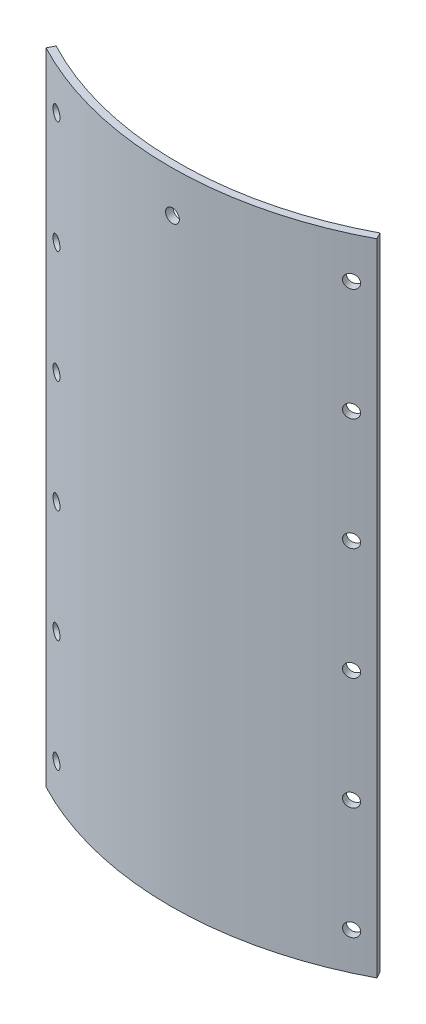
ISO-10303-21;
HEADER;
FILE_DESCRIPTION(('STEP AP214'),'2;1');
FILE_NAME('part.step','',(''),(''),'','','');
FILE_SCHEMA(('AUTOMOTIVE_DESIGN { 1 0 10303 214 1 1 1 1 }'));
ENDSEC;
DATA;
#1=APPLICATION_CONTEXT('core data for automotive mechanical design processes');
#2=APPLICATION_PROTOCOL_DEFINITION('international standard','automotive_design',2000,#1);
#3=PRODUCT_CONTEXT('',#1,'mechanical');
#4=PRODUCT('Part','Part','',(#3));
#5=PRODUCT_RELATED_PRODUCT_CATEGORY('part','',(#4));
#6=PRODUCT_DEFINITION_FORMATION('','',#4);
#7=PRODUCT_DEFINITION_CONTEXT('part definition',#1,'design');
#8=PRODUCT_DEFINITION('design','',#6,#7);
#9=PRODUCT_DEFINITION_SHAPE('','',#8);
#10=(LENGTH_UNIT() NAMED_UNIT(*) SI_UNIT(.MILLI.,.METRE.));
#11=(NAMED_UNIT(*) PLANE_ANGLE_UNIT() SI_UNIT($,.RADIAN.));
#12=(NAMED_UNIT(*) SI_UNIT($,.STERADIAN.) SOLID_ANGLE_UNIT());
#13=UNCERTAINTY_MEASURE_WITH_UNIT(LENGTH_MEASURE(1.E-05),#10,'distance_accuracy_value','');
#14=(GEOMETRIC_REPRESENTATION_CONTEXT(3) GLOBAL_UNCERTAINTY_ASSIGNED_CONTEXT((#13)) GLOBAL_UNIT_ASSIGNED_CONTEXT((#10,
#11,#12)) REPRESENTATION_CONTEXT('',''));
#15=CARTESIAN_POINT('',(0.,0.,0.));
#16=DIRECTION('',(0.,0.,1.));
#17=DIRECTION('',(1.,0.,0.));
#18=AXIS2_PLACEMENT_3D('',#15,#16,#17);
#19=CARTESIAN_POINT('',(0.,171.,0.));
#20=DIRECTION('',(0.,-1.,0.));
#21=DIRECTION('',(0.,0.,-1.));
#22=AXIS2_PLACEMENT_3D('',#19,#20,#21);
#23=PLANE('',#22);
#24=DIRECTION('',(0.4663633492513,0.,-0.884593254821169));
#25=VECTOR('',#24,1.);
#26=CARTESIAN_POINT('',(-43.2552006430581,171.,82.0460243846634));
#27=LINE('',#26,#25);
#28=CARTESIAN_POINT('',(-44.1879273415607,171.,83.8152108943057));
#29=VERTEX_POINT('',#28);
#30=CARTESIAN_POINT('',(-43.2552006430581,171.,82.0460243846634));
#31=VERTEX_POINT('',#30);
#32=EDGE_CURVE('E12',#29,#31,#27,.T.);
#33=ORIENTED_EDGE('',*,*,#32,.F.);
#34=CARTESIAN_POINT('',(0.,171.,0.));
#35=DIRECTION('',(0.,1.,0.));
#36=DIRECTION('',(0.,0.,1.));
#37=AXIS2_PLACEMENT_3D('',#34,#35,#36);
#38=CIRCLE('',#37,94.75);
#39=CARTESIAN_POINT('',(44.1879273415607,171.,83.8152108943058));
#40=VERTEX_POINT('',#39);
#41=EDGE_CURVE('E173',#29,#40,#38,.T.);
#42=ORIENTED_EDGE('',*,*,#41,.T.);
#43=DIRECTION('',(-0.4663633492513,0.,-0.884593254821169));
#44=VECTOR('',#43,1.);
#45=CARTESIAN_POINT('',(43.2552006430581,171.,82.0460243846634));
#46=LINE('',#45,#44);
#47=CARTESIAN_POINT('',(43.2552006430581,171.,82.0460243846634));
#48=VERTEX_POINT('',#47);
#49=EDGE_CURVE('E126',#40,#48,#46,.T.);
#50=ORIENTED_EDGE('',*,*,#49,.T.);
#51=CARTESIAN_POINT('',(0.,171.,0.));
#52=DIRECTION('',(0.,1.,0.));
#53=DIRECTION('',(0.,0.,1.));
#54=AXIS2_PLACEMENT_3D('',#51,#52,#53);
#55=CIRCLE('',#54,92.75);
#56=EDGE_CURVE('E179',#31,#48,#55,.T.);
#57=ORIENTED_EDGE('',*,*,#56,.F.);
#58=EDGE_LOOP('',(#33,#42,#50,#57));
#59=FACE_BOUND('',#58,.T.);
#60=ADVANCED_FACE('F114',(#59),#23,.F.);
#61=CARTESIAN_POINT('',(43.2552006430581,85.5,82.0460243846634));
#62=DIRECTION('',(-0.884593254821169,0.,0.4663633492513));
#63=DIRECTION('',(0.,-1.,0.));
#64=AXIS2_PLACEMENT_3D('',#61,#62,#63);
#65=PLANE('',#64);
#66=ORIENTED_EDGE('',*,*,#49,.F.);
#67=DIRECTION('',(0.,1.,0.));
#68=VECTOR('',#67,1.);
#69=CARTESIAN_POINT('',(44.1879273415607,-108.975801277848,83.8152108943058));
#70=LINE('',#69,#68);
#71=CARTESIAN_POINT('',(44.1879273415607,0.,83.8152108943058));
#72=VERTEX_POINT('',#71);
#73=EDGE_CURVE('E167',#40,#72,#70,.F.);
#74=ORIENTED_EDGE('',*,*,#73,.T.);
#75=DIRECTION('',(-0.4663633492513,0.,-0.884593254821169));
#76=VECTOR('',#75,1.);
#77=CARTESIAN_POINT('',(43.2552006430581,0.,82.0460243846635));
#78=LINE('',#77,#76);
#79=CARTESIAN_POINT('',(43.2552006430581,0.,82.0460243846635));
#80=VERTEX_POINT('',#79);
#81=EDGE_CURVE('E140',#72,#80,#78,.T.);
#82=ORIENTED_EDGE('',*,*,#81,.T.);
#83=DIRECTION('',(0.,-1.,0.));
#84=VECTOR('',#83,1.);
#85=CARTESIAN_POINT('',(43.2552006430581,171.,82.0460243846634));
#86=LINE('',#85,#84);
#87=EDGE_CURVE('E182',#48,#80,#86,.T.);
#88=ORIENTED_EDGE('',*,*,#87,.F.);
#89=EDGE_LOOP('',(#66,#74,#82,#88));
#90=FACE_BOUND('',#89,.T.);
#91=ADVANCED_FACE('F172',(#90),#65,.F.);
#92=CARTESIAN_POINT('',(0.,0.,0.));
#93=DIRECTION('',(0.,1.,0.));
#94=DIRECTION('',(0.,0.,1.));
#95=AXIS2_PLACEMENT_3D('',#92,#93,#94);
#96=PLANE('',#95);
#97=ORIENTED_EDGE('',*,*,#81,.F.);
#98=CARTESIAN_POINT('',(0.,0.,0.));
#99=DIRECTION('',(0.,1.,0.));
#100=DIRECTION('',(0.,0.,1.));
#101=AXIS2_PLACEMENT_3D('',#98,#99,#100);
#102=CIRCLE('',#101,94.75);
#103=CARTESIAN_POINT('',(-44.1879273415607,0.,83.8152108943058));
#104=VERTEX_POINT('',#103);
#105=EDGE_CURVE('E158',#72,#104,#102,.F.);
#106=ORIENTED_EDGE('',*,*,#105,.T.);
#107=DIRECTION('',(0.4663633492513,0.,-0.884593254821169));
#108=VECTOR('',#107,1.);
#109=CARTESIAN_POINT('',(-43.2552006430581,0.,82.0460243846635));
#110=LINE('',#109,#108);
#111=CARTESIAN_POINT('',(-43.2552006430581,0.,82.0460243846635));
#112=VERTEX_POINT('',#111);
#113=EDGE_CURVE('E121',#104,#112,#110,.T.);
#114=ORIENTED_EDGE('',*,*,#113,.T.);
#115=CARTESIAN_POINT('',(0.,0.,0.));
#116=DIRECTION('',(0.,-1.,0.));
#117=DIRECTION('',(0.,0.,-1.));
#118=AXIS2_PLACEMENT_3D('',#115,#116,#117);
#119=CIRCLE('',#118,92.75);
#120=EDGE_CURVE('E160',#80,#112,#119,.T.);
#121=ORIENTED_EDGE('',*,*,#120,.F.);
#122=EDGE_LOOP('',(#97,#106,#114,#121));
#123=FACE_BOUND('',#122,.T.);
#124=ADVANCED_FACE('F157',(#123),#96,.F.);
#125=CARTESIAN_POINT('',(-43.2552006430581,85.5,82.0460243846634));
#126=DIRECTION('',(0.884593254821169,0.,0.4663633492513));
#127=DIRECTION('',(0.,1.,0.));
#128=AXIS2_PLACEMENT_3D('',#125,#126,#127);
#129=PLANE('',#128);
#130=DIRECTION('',(0.,1.,0.));
#131=VECTOR('',#130,1.);
#132=CARTESIAN_POINT('',(-44.1879273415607,-108.975801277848,83.8152108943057));
#133=LINE('',#132,#131);
#134=EDGE_CURVE('E170',#104,#29,#133,.T.);
#135=ORIENTED_EDGE('',*,*,#134,.T.);
#136=ORIENTED_EDGE('',*,*,#32,.T.);
#137=DIRECTION('',(0.,1.,0.));
#138=VECTOR('',#137,1.);
#139=CARTESIAN_POINT('',(-43.2552006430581,0.,82.0460243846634));
#140=LINE('',#139,#138);
#141=EDGE_CURVE('E186',#112,#31,#140,.T.);
#142=ORIENTED_EDGE('',*,*,#141,.F.);
#143=ORIENTED_EDGE('',*,*,#113,.F.);
#144=EDGE_LOOP('',(#135,#136,#142,#143));
#145=FACE_BOUND('',#144,.T.);
#146=ADVANCED_FACE('F574',(#145),#129,.F.);
#147=CARTESIAN_POINT('',(37.997672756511,40.,86.7971161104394));
#148=CARTESIAN_POINT('',(37.9969918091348,39.7528997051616,86.7974142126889));
#149=CARTESIAN_POINT('',(38.036975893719,39.5236791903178,86.7799441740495));
#150=CARTESIAN_POINT('',(38.1578386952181,39.2066680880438,86.7268342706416));
#151=CARTESIAN_POINT('',(38.2082717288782,39.1054676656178,86.7046414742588));
#152=CARTESIAN_POINT('',(38.3293816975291,38.9120067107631,86.6511706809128));
#153=CARTESIAN_POINT('',(38.3991903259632,38.8206900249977,86.6202785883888));
#154=CARTESIAN_POINT('',(38.6440924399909,38.5544867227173,86.5114358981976));
#155=CARTESIAN_POINT('',(38.823721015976,38.4214227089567,86.431055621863));
#156=CARTESIAN_POINT('',(39.2154150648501,38.244104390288,86.2540428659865));
#157=CARTESIAN_POINT('',(39.4260723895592,38.1998491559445,86.1580593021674));
#158=CARTESIAN_POINT('',(40.1146326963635,38.2003035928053,85.840749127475));
#159=CARTESIAN_POINT('',(40.5043754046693,38.3777563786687,85.6567770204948));
#160=CARTESIAN_POINT('',(40.9836755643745,38.9060529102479,85.4279356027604));
#161=CARTESIAN_POINT('',(41.1032268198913,39.099850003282,85.3703405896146));
#162=CARTESIAN_POINT('',(41.2623800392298,39.522840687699,85.2935302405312));
#163=CARTESIAN_POINT('',(41.3019844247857,39.7502485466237,85.2743137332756));
#164=CARTESIAN_POINT('',(41.301397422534,40.2476036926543,85.2745980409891));
#165=CARTESIAN_POINT('',(41.2616260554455,40.4777550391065,85.2938947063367));
#166=CARTESIAN_POINT('',(41.1426319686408,40.7951927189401,85.3513226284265));
#167=CARTESIAN_POINT('',(41.0930752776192,40.8963737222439,85.3752072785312));
#168=CARTESIAN_POINT('',(40.9741283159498,41.0894726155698,85.4323572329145));
#169=CARTESIAN_POINT('',(40.9058917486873,41.1801212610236,85.4650716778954));
#170=CARTESIAN_POINT('',(40.6644060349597,41.4457879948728,85.580373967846));
#171=CARTESIAN_POINT('',(40.4866847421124,41.5786039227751,85.6646781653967));
#172=CARTESIAN_POINT('',(40.0974946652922,41.7556453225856,85.8475372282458));
#173=CARTESIAN_POINT('',(39.8872238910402,41.7998711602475,85.9455399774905));
#174=CARTESIAN_POINT('',(39.4278113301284,41.7997309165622,86.1572641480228));
#175=CARTESIAN_POINT('',(39.2148978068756,41.7555060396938,86.2542782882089));
#176=CARTESIAN_POINT('',(38.8230177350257,41.5787467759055,86.4313717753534));
#177=CARTESIAN_POINT('',(38.6428356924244,41.4448855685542,86.5119913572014));
#178=CARTESIAN_POINT('',(38.1609451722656,40.9187986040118,86.7261688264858));
#179=CARTESIAN_POINT('',(37.9990346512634,40.4942005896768,86.7965199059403));
#180=CARTESIAN_POINT('',(37.997672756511,40.,86.7971161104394));
#181=CARTESIAN_POINT('',(37.1956110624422,40.,84.9649870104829));
#182=CARTESIAN_POINT('',(37.1949444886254,39.7528997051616,84.9652788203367));
#183=CARTESIAN_POINT('',(37.2340845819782,39.5236791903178,84.9481775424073));
#184=CARTESIAN_POINT('',(37.3523961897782,39.2066680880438,84.8961886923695));
#185=CARTESIAN_POINT('',(37.4017646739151,39.1054676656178,84.8744643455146));
#186=CARTESIAN_POINT('',(37.5203182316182,38.9120067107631,84.8221222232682));
#187=CARTESIAN_POINT('',(37.5886533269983,38.8206900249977,84.7918822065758));
#188=CARTESIAN_POINT('',(37.8283860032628,38.5544867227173,84.6853369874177));
#189=CARTESIAN_POINT('',(38.0042229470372,38.4214227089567,84.6066533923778));
#190=CARTESIAN_POINT('',(38.3876490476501,38.244104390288,84.4333770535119));
#191=CARTESIAN_POINT('',(38.5938597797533,38.1998491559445,84.3394195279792));
#192=CARTESIAN_POINT('',(39.2678858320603,38.2003035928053,84.0288071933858));
#193=CARTESIAN_POINT('',(39.6494017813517,38.3777563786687,83.8487184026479));
#194=CARTESIAN_POINT('',(40.11858478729,38.9060529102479,83.6247074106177));
#195=CARTESIAN_POINT('',(40.2356125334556,39.099850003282,83.5683281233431));
#196=CARTESIAN_POINT('',(40.3914063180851,39.522840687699,83.4931391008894));
#197=CARTESIAN_POINT('',(40.4301747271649,39.7502485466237,83.4743282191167));
#198=CARTESIAN_POINT('',(40.429600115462,40.2476036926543,83.474606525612));
#199=CARTESIAN_POINT('',(40.3906682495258,40.4777550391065,83.4934958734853));
#200=CARTESIAN_POINT('',(40.2741859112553,40.7951927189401,83.5497115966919));
#201=CARTESIAN_POINT('',(40.2256752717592,40.8963737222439,83.5730920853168));
#202=CARTESIAN_POINT('',(40.1092390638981,41.0894726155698,83.6290357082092));
#203=CARTESIAN_POINT('',(40.0424428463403,41.1801212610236,83.6610596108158));
#204=CARTESIAN_POINT('',(39.8060544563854,41.4457879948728,83.7739280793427));
#205=CARTESIAN_POINT('',(39.6320845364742,41.5786039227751,83.8564527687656));
#206=CARTESIAN_POINT('',(39.2511095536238,41.7556453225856,84.0354520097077));
#207=CARTESIAN_POINT('',(39.0452772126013,41.7998711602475,84.1313860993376));
#208=CARTESIAN_POINT('',(38.5955620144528,41.7997309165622,84.3386411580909));
#209=CARTESIAN_POINT('',(38.3871427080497,41.7555060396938,84.4336075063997));
#210=CARTESIAN_POINT('',(38.0035345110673,41.5787467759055,84.6069628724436));
#211=CARTESIAN_POINT('',(37.8271557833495,41.4448855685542,84.6858807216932));
#212=CARTESIAN_POINT('',(37.3554370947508,40.9187986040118,84.8955372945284));
#213=CARTESIAN_POINT('',(37.1969442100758,40.4942005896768,84.9644033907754));
#214=CARTESIAN_POINT('',(37.1956110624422,40.,84.9649870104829));
#215=B_SPLINE_SURFACE_WITH_KNOTS('',1,3,((#147,#148,#149,#150,#151,#152,#153,#154,#155,#156,
#157,#158,#159,#160,#161,#162,#163,#164,#165,#166,#167,#168,#169,#170,#171,#172,#173,#174,#175,
#176,#177,#178,#179,#180),(#181,#182,#183,#184,#185,#186,#187,#188,#189,#190,#191,#192,#193,
#194,#195,#196,#197,#198,#199,#200,#201,#202,#203,#204,#205,#206,#207,#208,#209,#210,#211,#212,
#213,#214)),.UNSPECIFIED.,.F.,.T.,.F.,(2,2),(4,2,2,2,2,2,2,2,2,2,2,2,2,2,2,2,4),(0.,1.),(0.,
0.0625,0.09375,0.125,0.1875,0.25,0.375,0.4375,0.5,0.5625,0.59375,0.625,0.6875,0.75,0.8125,0.875,
1.),.UNSPECIFIED.);
#216=CARTESIAN_POINT('',(37.1956110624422,40.,84.9649870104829));
#217=CARTESIAN_POINT('',(37.1969442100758,40.4942005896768,84.9644033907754));
#218=CARTESIAN_POINT('',(37.3554370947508,40.9187986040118,84.8955372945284));
#219=CARTESIAN_POINT('',(37.8271557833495,41.4448855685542,84.6858807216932));
#220=CARTESIAN_POINT('',(38.0035345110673,41.5787467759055,84.6069628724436));
#221=CARTESIAN_POINT('',(38.3871427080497,41.7555060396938,84.4336075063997));
#222=CARTESIAN_POINT('',(38.5955620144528,41.7997309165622,84.3386411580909));
#223=CARTESIAN_POINT('',(39.0452772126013,41.7998711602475,84.1313860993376));
#224=CARTESIAN_POINT('',(39.2511095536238,41.7556453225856,84.0354520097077));
#225=CARTESIAN_POINT('',(39.6320845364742,41.5786039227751,83.8564527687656));
#226=CARTESIAN_POINT('',(39.8060544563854,41.4457879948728,83.7739280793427));
#227=CARTESIAN_POINT('',(40.0424428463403,41.1801212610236,83.6610596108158));
#228=CARTESIAN_POINT('',(40.1092390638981,41.0894726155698,83.6290357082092));
#229=CARTESIAN_POINT('',(40.2256752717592,40.8963737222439,83.5730920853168));
#230=CARTESIAN_POINT('',(40.2741859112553,40.7951927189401,83.5497115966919));
#231=CARTESIAN_POINT('',(40.3906682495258,40.4777550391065,83.4934958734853));
#232=CARTESIAN_POINT('',(40.429600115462,40.2476036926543,83.474606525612));
#233=CARTESIAN_POINT('',(40.4301747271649,39.7502485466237,83.4743282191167));
#234=CARTESIAN_POINT('',(40.3914063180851,39.522840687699,83.4931391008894));
#235=CARTESIAN_POINT('',(40.2356125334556,39.099850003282,83.5683281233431));
#236=CARTESIAN_POINT('',(40.11858478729,38.9060529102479,83.6247074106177));
#237=CARTESIAN_POINT('',(39.6494017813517,38.3777563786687,83.8487184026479));
#238=CARTESIAN_POINT('',(39.2678858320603,38.2003035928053,84.0288071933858));
#239=CARTESIAN_POINT('',(38.5938597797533,38.1998491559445,84.3394195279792));
#240=CARTESIAN_POINT('',(38.3876490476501,38.244104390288,84.4333770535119));
#241=CARTESIAN_POINT('',(38.0042229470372,38.4214227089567,84.6066533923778));
#242=CARTESIAN_POINT('',(37.8283860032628,38.5544867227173,84.6853369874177));
#243=CARTESIAN_POINT('',(37.5886533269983,38.8206900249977,84.7918822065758));
#244=CARTESIAN_POINT('',(37.5203182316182,38.9120067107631,84.8221222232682));
#245=CARTESIAN_POINT('',(37.4017646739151,39.1054676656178,84.8744643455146));
#246=CARTESIAN_POINT('',(37.3523961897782,39.2066680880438,84.8961886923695));
#247=CARTESIAN_POINT('',(37.2340845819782,39.5236791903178,84.9481775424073));
#248=CARTESIAN_POINT('',(37.1949444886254,39.7528997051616,84.9652788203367));
#249=CARTESIAN_POINT('',(37.1956110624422,40.,84.9649870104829));
#250=B_SPLINE_CURVE_WITH_KNOTS('',3,(#216,#217,#218,#219,#220,#221,#222,#223,#224,#225,#226,
#227,#228,#229,#230,#231,#232,#233,#234,#235,#236,#237,#238,#239,#240,#241,#242,#243,#244,#245,
#246,#247,#248,#249),.UNSPECIFIED.,.T.,.F.,(4,2,2,2,2,2,2,2,2,2,2,2,2,2,2,2,4),(0.,0.125,0.1875,
0.25,0.3125,0.375,0.40625,0.4375,0.5,0.5625,0.625,0.75,0.8125,0.875,0.90625,0.9375,1.),.UNSPECIFIED.);
#251=CARTESIAN_POINT('',(37.1956110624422,40.,84.9649870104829));
#252=VERTEX_POINT('',#251);
#253=EDGE_CURVE('E189',#252,#252,#250,.F.);
#254=CARTESIAN_POINT('',(37.997672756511,40.,86.7971161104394));
#255=CARTESIAN_POINT('',(37.9969918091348,39.7528997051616,86.7974142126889));
#256=CARTESIAN_POINT('',(38.036975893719,39.5236791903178,86.7799441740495));
#257=CARTESIAN_POINT('',(38.1578386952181,39.2066680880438,86.7268342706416));
#258=CARTESIAN_POINT('',(38.2082717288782,39.1054676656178,86.7046414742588));
#259=CARTESIAN_POINT('',(38.3293816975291,38.9120067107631,86.6511706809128));
#260=CARTESIAN_POINT('',(38.3991903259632,38.8206900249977,86.6202785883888));
#261=CARTESIAN_POINT('',(38.6440924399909,38.5544867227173,86.5114358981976));
#262=CARTESIAN_POINT('',(38.823721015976,38.4214227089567,86.431055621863));
#263=CARTESIAN_POINT('',(39.2154150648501,38.244104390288,86.2540428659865));
#264=CARTESIAN_POINT('',(39.4260723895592,38.1998491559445,86.1580593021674));
#265=CARTESIAN_POINT('',(40.1146326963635,38.2003035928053,85.840749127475));
#266=CARTESIAN_POINT('',(40.5043754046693,38.3777563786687,85.6567770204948));
#267=CARTESIAN_POINT('',(40.9836755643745,38.9060529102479,85.4279356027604));
#268=CARTESIAN_POINT('',(41.1032268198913,39.099850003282,85.3703405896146));
#269=CARTESIAN_POINT('',(41.2623800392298,39.522840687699,85.2935302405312));
#270=CARTESIAN_POINT('',(41.3019844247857,39.7502485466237,85.2743137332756));
#271=CARTESIAN_POINT('',(41.301397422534,40.2476036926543,85.2745980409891));
#272=CARTESIAN_POINT('',(41.2616260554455,40.4777550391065,85.2938947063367));
#273=CARTESIAN_POINT('',(41.1426319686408,40.7951927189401,85.3513226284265));
#274=CARTESIAN_POINT('',(41.0930752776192,40.8963737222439,85.3752072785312));
#275=CARTESIAN_POINT('',(40.9741283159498,41.0894726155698,85.4323572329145));
#276=CARTESIAN_POINT('',(40.9058917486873,41.1801212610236,85.4650716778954));
#277=CARTESIAN_POINT('',(40.6644060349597,41.4457879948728,85.580373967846));
#278=CARTESIAN_POINT('',(40.4866847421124,41.5786039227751,85.6646781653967));
#279=CARTESIAN_POINT('',(40.0974946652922,41.7556453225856,85.8475372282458));
#280=CARTESIAN_POINT('',(39.8872238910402,41.7998711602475,85.9455399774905));
#281=CARTESIAN_POINT('',(39.4278113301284,41.7997309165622,86.1572641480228));
#282=CARTESIAN_POINT('',(39.2148978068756,41.7555060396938,86.2542782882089));
#283=CARTESIAN_POINT('',(38.8230177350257,41.5787467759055,86.4313717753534));
#284=CARTESIAN_POINT('',(38.6428356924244,41.4448855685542,86.5119913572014));
#285=CARTESIAN_POINT('',(38.1609451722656,40.9187986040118,86.7261688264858));
#286=CARTESIAN_POINT('',(37.9990346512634,40.4942005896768,86.7965199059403));
#287=CARTESIAN_POINT('',(37.997672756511,40.,86.7971161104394));
#288=B_SPLINE_CURVE_WITH_KNOTS('',3,(#254,#255,#256,#257,#258,#259,#260,#261,#262,#263,#264,
#265,#266,#267,#268,#269,#270,#271,#272,#273,#274,#275,#276,#277,#278,#279,#280,#281,#282,#283,
#284,#285,#286,#287),.UNSPECIFIED.,.T.,.F.,(4,2,2,2,2,2,2,2,2,2,2,2,2,2,2,2,4),(0.,0.0625,
0.09375,0.125,0.1875,0.25,0.375,0.4375,0.5,0.5625,0.59375,0.625,0.6875,0.75,0.8125,0.875,1.),.UNSPECIFIED.);
#289=CARTESIAN_POINT('',(37.997672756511,40.,86.7971161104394));
#290=VERTEX_POINT('',#289);
#291=EDGE_CURVE('E178',#290,#290,#288,.T.);
#292=ORIENTED_EDGE('',*,*,#253,.F.);
#293=EDGE_LOOP('',(#292));
#294=FACE_BOUND('',#293,.T.);
#295=ORIENTED_EDGE('',*,*,#291,.T.);
#296=EDGE_LOOP('',(#295));
#297=FACE_BOUND('',#296,.T.);
#298=ADVANCED_FACE('F526',(#294,#297),#215,.F.);
#299=CARTESIAN_POINT('',(37.997672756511,9.99999999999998,86.7971161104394));
#300=CARTESIAN_POINT('',(37.9969918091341,9.75289970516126,86.7974142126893));
#301=CARTESIAN_POINT('',(38.0369758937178,9.52367919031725,86.77994417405));
#302=CARTESIAN_POINT('',(38.157838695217,9.20666808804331,86.7268342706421));
#303=CARTESIAN_POINT('',(38.2082717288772,9.10546766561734,86.7046414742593));
#304=CARTESIAN_POINT('',(38.3293816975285,8.91200671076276,86.6511706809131));
#305=CARTESIAN_POINT('',(38.399190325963,8.8206900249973,86.6202785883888));
#306=CARTESIAN_POINT('',(38.6440924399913,8.55448672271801,86.5114358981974));
#307=CARTESIAN_POINT('',(38.8237210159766,8.42142270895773,86.4310556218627));
#308=CARTESIAN_POINT('',(39.2154150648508,8.24410439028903,86.2540428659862));
#309=CARTESIAN_POINT('',(39.4260723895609,8.19984915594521,86.1580593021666));
#310=CARTESIAN_POINT('',(40.1146326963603,8.20030359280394,85.8407491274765));
#311=CARTESIAN_POINT('',(40.5043754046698,8.37775637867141,85.6567770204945));
#312=CARTESIAN_POINT('',(40.9836755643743,8.90605291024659,85.4279356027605));
#313=CARTESIAN_POINT('',(41.103226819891,9.09985000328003,85.3703405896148));
#314=CARTESIAN_POINT('',(41.2623800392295,9.52284068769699,85.2935302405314));
#315=CARTESIAN_POINT('',(41.3019844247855,9.75024854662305,85.2743137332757));
#316=CARTESIAN_POINT('',(41.3013974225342,10.2476036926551,85.2745980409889));
#317=CARTESIAN_POINT('',(41.2616260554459,10.4777550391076,85.2938947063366));
#318=CARTESIAN_POINT('',(41.1426319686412,10.7951927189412,85.3513226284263));
#319=CARTESIAN_POINT('',(41.0930752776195,10.8963737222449,85.375207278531));
#320=CARTESIAN_POINT('',(40.9741283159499,11.0894726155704,85.4323572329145));
#321=CARTESIAN_POINT('',(40.905891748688,11.1801212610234,85.465071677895));
#322=CARTESIAN_POINT('',(40.6644060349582,11.4457879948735,85.5803739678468));
#323=CARTESIAN_POINT('',(40.4866847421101,11.5786039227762,85.6646781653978));
#324=CARTESIAN_POINT('',(40.0974946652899,11.7556453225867,85.8475372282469));
#325=CARTESIAN_POINT('',(39.8872238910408,11.7998711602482,85.9455399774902));
#326=CARTESIAN_POINT('',(39.4278113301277,11.7997309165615,86.1572641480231));
#327=CARTESIAN_POINT('',(39.2148978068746,11.7555060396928,86.2542782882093));
#328=CARTESIAN_POINT('',(38.8230177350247,11.5787467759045,86.4313717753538));
#329=CARTESIAN_POINT('',(38.6428356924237,11.4448855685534,86.5119913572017));
#330=CARTESIAN_POINT('',(38.1609451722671,10.9187986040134,86.7261688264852));
#331=CARTESIAN_POINT('',(37.9990346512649,10.4942005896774,86.7965199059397));
#332=CARTESIAN_POINT('',(37.997672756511,9.99999999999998,86.7971161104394));
#333=CARTESIAN_POINT('',(37.1956110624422,9.99999999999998,84.9649870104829));
#334=CARTESIAN_POINT('',(37.1949444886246,9.75289970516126,84.965278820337));
#335=CARTESIAN_POINT('',(37.2340845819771,9.52367919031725,84.9481775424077));
#336=CARTESIAN_POINT('',(37.3523961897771,9.20666808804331,84.89618869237));
#337=CARTESIAN_POINT('',(37.4017646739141,9.10546766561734,84.874464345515));
#338=CARTESIAN_POINT('',(37.5203182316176,8.91200671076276,84.8221222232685));
#339=CARTESIAN_POINT('',(37.5886533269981,8.8206900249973,84.7918822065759));
#340=CARTESIAN_POINT('',(37.8283860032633,8.55448672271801,84.6853369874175));
#341=CARTESIAN_POINT('',(38.0042229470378,8.42142270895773,84.6066533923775));
#342=CARTESIAN_POINT('',(38.3876490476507,8.24410439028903,84.4333770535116));
#343=CARTESIAN_POINT('',(38.5938597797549,8.19984915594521,84.3394195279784));
#344=CARTESIAN_POINT('',(39.2678858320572,8.20030359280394,84.0288071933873));
#345=CARTESIAN_POINT('',(39.6494017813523,8.37775637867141,83.8487184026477));
#346=CARTESIAN_POINT('',(40.1185847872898,8.90605291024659,83.6247074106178));
#347=CARTESIAN_POINT('',(40.2356125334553,9.09985000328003,83.5683281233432));
#348=CARTESIAN_POINT('',(40.3914063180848,9.52284068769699,83.4931391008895));
#349=CARTESIAN_POINT('',(40.4301747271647,9.75024854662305,83.4743282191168));
#350=CARTESIAN_POINT('',(40.4296001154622,10.2476036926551,83.4746065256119));
#351=CARTESIAN_POINT('',(40.3906682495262,10.4777550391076,83.4934958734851));
#352=CARTESIAN_POINT('',(40.2741859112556,10.7951927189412,83.5497115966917));
#353=CARTESIAN_POINT('',(40.2256752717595,10.8963737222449,83.5730920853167));
#354=CARTESIAN_POINT('',(40.1092390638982,11.0894726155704,83.6290357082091));
#355=CARTESIAN_POINT('',(40.042442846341,11.1801212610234,83.6610596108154));
#356=CARTESIAN_POINT('',(39.8060544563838,11.4457879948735,83.7739280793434));
#357=CARTESIAN_POINT('',(39.6320845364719,11.5786039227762,83.8564527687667));
#358=CARTESIAN_POINT('',(39.2511095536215,11.7556453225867,84.0354520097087));
#359=CARTESIAN_POINT('',(39.0452772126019,11.7998711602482,84.1313860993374));
#360=CARTESIAN_POINT('',(38.5955620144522,11.7997309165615,84.3386411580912));
#361=CARTESIAN_POINT('',(38.3871427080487,11.7555060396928,84.4336075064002));
#362=CARTESIAN_POINT('',(38.0035345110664,11.5787467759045,84.606962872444));
#363=CARTESIAN_POINT('',(37.8271557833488,11.4448855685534,84.6858807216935));
#364=CARTESIAN_POINT('',(37.3554370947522,10.9187986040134,84.8955372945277));
#365=CARTESIAN_POINT('',(37.1969442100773,10.4942005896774,84.9644033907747));
#366=CARTESIAN_POINT('',(37.1956110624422,9.99999999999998,84.9649870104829));
#367=B_SPLINE_SURFACE_WITH_KNOTS('',1,3,((#299,#300,#301,#302,#303,#304,#305,#306,#307,#308,
#309,#310,#311,#312,#313,#314,#315,#316,#317,#318,#319,#320,#321,#322,#323,#324,#325,#326,#327,
#328,#329,#330,#331,#332),(#333,#334,#335,#336,#337,#338,#339,#340,#341,#342,#343,#344,#345,
#346,#347,#348,#349,#350,#351,#352,#353,#354,#355,#356,#357,#358,#359,#360,#361,#362,#363,#364,
#365,#366)),.UNSPECIFIED.,.F.,.T.,.F.,(2,2),(4,2,2,2,2,2,2,2,2,2,2,2,2,2,2,2,4),(0.,1.),(0.,
0.0625,0.09375,0.125,0.1875,0.25,0.375,0.4375,0.5,0.5625,0.59375,0.625,0.6875,0.75,0.8125,0.875,
1.),.UNSPECIFIED.);
#368=CARTESIAN_POINT('',(37.1956110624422,9.99999999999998,84.9649870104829));
#369=CARTESIAN_POINT('',(37.1969442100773,10.4942005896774,84.9644033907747));
#370=CARTESIAN_POINT('',(37.3554370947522,10.9187986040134,84.8955372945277));
#371=CARTESIAN_POINT('',(37.8271557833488,11.4448855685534,84.6858807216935));
#372=CARTESIAN_POINT('',(38.0035345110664,11.5787467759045,84.606962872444));
#373=CARTESIAN_POINT('',(38.3871427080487,11.7555060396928,84.4336075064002));
#374=CARTESIAN_POINT('',(38.5955620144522,11.7997309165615,84.3386411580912));
#375=CARTESIAN_POINT('',(39.0452772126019,11.7998711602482,84.1313860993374));
#376=CARTESIAN_POINT('',(39.2511095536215,11.7556453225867,84.0354520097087));
#377=CARTESIAN_POINT('',(39.6320845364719,11.5786039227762,83.8564527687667));
#378=CARTESIAN_POINT('',(39.8060544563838,11.4457879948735,83.7739280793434));
#379=CARTESIAN_POINT('',(40.042442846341,11.1801212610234,83.6610596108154));
#380=CARTESIAN_POINT('',(40.1092390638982,11.0894726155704,83.6290357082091));
#381=CARTESIAN_POINT('',(40.2256752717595,10.8963737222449,83.5730920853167));
#382=CARTESIAN_POINT('',(40.2741859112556,10.7951927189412,83.5497115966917));
#383=CARTESIAN_POINT('',(40.3906682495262,10.4777550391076,83.4934958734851));
#384=CARTESIAN_POINT('',(40.4296001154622,10.2476036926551,83.4746065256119));
#385=CARTESIAN_POINT('',(40.4301747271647,9.75024854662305,83.4743282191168));
#386=CARTESIAN_POINT('',(40.3914063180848,9.52284068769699,83.4931391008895));
#387=CARTESIAN_POINT('',(40.2356125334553,9.09985000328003,83.5683281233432));
#388=CARTESIAN_POINT('',(40.1185847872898,8.90605291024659,83.6247074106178));
#389=CARTESIAN_POINT('',(39.6494017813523,8.37775637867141,83.8487184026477));
#390=CARTESIAN_POINT('',(39.2678858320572,8.20030359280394,84.0288071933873));
#391=CARTESIAN_POINT('',(38.5938597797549,8.19984915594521,84.3394195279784));
#392=CARTESIAN_POINT('',(38.3876490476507,8.24410439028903,84.4333770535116));
#393=CARTESIAN_POINT('',(38.0042229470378,8.42142270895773,84.6066533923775));
#394=CARTESIAN_POINT('',(37.8283860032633,8.55448672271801,84.6853369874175));
#395=CARTESIAN_POINT('',(37.5886533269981,8.8206900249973,84.7918822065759));
#396=CARTESIAN_POINT('',(37.5203182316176,8.91200671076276,84.8221222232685));
#397=CARTESIAN_POINT('',(37.4017646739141,9.10546766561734,84.874464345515));
#398=CARTESIAN_POINT('',(37.3523961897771,9.20666808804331,84.89618869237));
#399=CARTESIAN_POINT('',(37.2340845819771,9.52367919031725,84.9481775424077));
#400=CARTESIAN_POINT('',(37.1949444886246,9.75289970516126,84.965278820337));
#401=CARTESIAN_POINT('',(37.1956110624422,9.99999999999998,84.9649870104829));
#402=B_SPLINE_CURVE_WITH_KNOTS('',3,(#368,#369,#370,#371,#372,#373,#374,#375,#376,#377,#378,
#379,#380,#381,#382,#383,#384,#385,#386,#387,#388,#389,#390,#391,#392,#393,#394,#395,#396,#397,
#398,#399,#400,#401),.UNSPECIFIED.,.T.,.F.,(4,2,2,2,2,2,2,2,2,2,2,2,2,2,2,2,4),(0.,0.125,0.1875,
0.25,0.3125,0.375,0.40625,0.4375,0.5,0.5625,0.625,0.75,0.8125,0.875,0.90625,0.9375,1.),.UNSPECIFIED.);
#403=CARTESIAN_POINT('',(37.1956110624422,9.99999999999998,84.9649870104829));
#404=VERTEX_POINT('',#403);
#405=EDGE_CURVE('E494',#404,#404,#402,.F.);
#406=CARTESIAN_POINT('',(37.997672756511,9.99999999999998,86.7971161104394));
#407=CARTESIAN_POINT('',(37.9969918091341,9.75289970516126,86.7974142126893));
#408=CARTESIAN_POINT('',(38.0369758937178,9.52367919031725,86.77994417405));
#409=CARTESIAN_POINT('',(38.157838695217,9.20666808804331,86.7268342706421));
#410=CARTESIAN_POINT('',(38.2082717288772,9.10546766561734,86.7046414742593));
#411=CARTESIAN_POINT('',(38.3293816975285,8.91200671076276,86.6511706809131));
#412=CARTESIAN_POINT('',(38.399190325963,8.8206900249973,86.6202785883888));
#413=CARTESIAN_POINT('',(38.6440924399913,8.55448672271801,86.5114358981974));
#414=CARTESIAN_POINT('',(38.8237210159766,8.42142270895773,86.4310556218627));
#415=CARTESIAN_POINT('',(39.2154150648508,8.24410439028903,86.2540428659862));
#416=CARTESIAN_POINT('',(39.4260723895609,8.19984915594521,86.1580593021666));
#417=CARTESIAN_POINT('',(40.1146326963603,8.20030359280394,85.8407491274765));
#418=CARTESIAN_POINT('',(40.5043754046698,8.37775637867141,85.6567770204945));
#419=CARTESIAN_POINT('',(40.9836755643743,8.90605291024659,85.4279356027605));
#420=CARTESIAN_POINT('',(41.103226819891,9.09985000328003,85.3703405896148));
#421=CARTESIAN_POINT('',(41.2623800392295,9.52284068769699,85.2935302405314));
#422=CARTESIAN_POINT('',(41.3019844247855,9.75024854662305,85.2743137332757));
#423=CARTESIAN_POINT('',(41.3013974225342,10.2476036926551,85.2745980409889));
#424=CARTESIAN_POINT('',(41.2616260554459,10.4777550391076,85.2938947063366));
#425=CARTESIAN_POINT('',(41.1426319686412,10.7951927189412,85.3513226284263));
#426=CARTESIAN_POINT('',(41.0930752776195,10.8963737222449,85.375207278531));
#427=CARTESIAN_POINT('',(40.9741283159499,11.0894726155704,85.4323572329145));
#428=CARTESIAN_POINT('',(40.905891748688,11.1801212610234,85.465071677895));
#429=CARTESIAN_POINT('',(40.6644060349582,11.4457879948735,85.5803739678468));
#430=CARTESIAN_POINT('',(40.4866847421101,11.5786039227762,85.6646781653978));
#431=CARTESIAN_POINT('',(40.0974946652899,11.7556453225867,85.8475372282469));
#432=CARTESIAN_POINT('',(39.8872238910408,11.7998711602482,85.9455399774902));
#433=CARTESIAN_POINT('',(39.4278113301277,11.7997309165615,86.1572641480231));
#434=CARTESIAN_POINT('',(39.2148978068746,11.7555060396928,86.2542782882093));
#435=CARTESIAN_POINT('',(38.8230177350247,11.5787467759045,86.4313717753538));
#436=CARTESIAN_POINT('',(38.6428356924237,11.4448855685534,86.5119913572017));
#437=CARTESIAN_POINT('',(38.1609451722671,10.9187986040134,86.7261688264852));
#438=CARTESIAN_POINT('',(37.9990346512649,10.4942005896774,86.7965199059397));
#439=CARTESIAN_POINT('',(37.997672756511,9.99999999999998,86.7971161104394));
#440=B_SPLINE_CURVE_WITH_KNOTS('',3,(#406,#407,#408,#409,#410,#411,#412,#413,#414,#415,#416,
#417,#418,#419,#420,#421,#422,#423,#424,#425,#426,#427,#428,#429,#430,#431,#432,#433,#434,#435,
#436,#437,#438,#439),.UNSPECIFIED.,.T.,.F.,(4,2,2,2,2,2,2,2,2,2,2,2,2,2,2,2,4),(0.,0.0625,
0.09375,0.125,0.1875,0.25,0.375,0.4375,0.5,0.5625,0.59375,0.625,0.6875,0.75,0.8125,0.875,1.),.UNSPECIFIED.);
#441=CARTESIAN_POINT('',(37.997672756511,9.99999999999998,86.7971161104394));
#442=VERTEX_POINT('',#441);
#443=EDGE_CURVE('E499',#442,#442,#440,.T.);
#444=ORIENTED_EDGE('',*,*,#405,.F.);
#445=EDGE_LOOP('',(#444));
#446=FACE_BOUND('',#445,.T.);
#447=ORIENTED_EDGE('',*,*,#443,.T.);
#448=EDGE_LOOP('',(#447));
#449=FACE_BOUND('',#448,.T.);
#450=ADVANCED_FACE('F514',(#446,#449),#367,.F.);
#451=CARTESIAN_POINT('',(37.997672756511,70.,86.7971161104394));
#452=CARTESIAN_POINT('',(37.9969918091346,69.7528997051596,86.797414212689));
#453=CARTESIAN_POINT('',(38.0369758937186,69.5236791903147,86.7799441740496));
#454=CARTESIAN_POINT('',(38.1578386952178,69.2066680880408,86.7268342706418));
#455=CARTESIAN_POINT('',(38.2082717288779,69.105467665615,86.704641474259));
#456=CARTESIAN_POINT('',(38.3293816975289,68.9120067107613,86.6511706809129));
#457=CARTESIAN_POINT('',(38.3991903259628,68.820690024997,86.6202785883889));
#458=CARTESIAN_POINT('',(38.6440924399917,68.5544867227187,86.5114358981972));
#459=CARTESIAN_POINT('',(38.8237210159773,68.4214227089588,86.4310556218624));
#460=CARTESIAN_POINT('',(39.2154150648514,68.2441043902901,86.2540428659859));
#461=CARTESIAN_POINT('',(39.42607238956,68.1998491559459,86.158059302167));
#462=CARTESIAN_POINT('',(40.1146326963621,68.2003035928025,85.8407491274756));
#463=CARTESIAN_POINT('',(40.5043754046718,68.3777563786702,85.6567770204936));
#464=CARTESIAN_POINT('',(40.9836755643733,68.9060529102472,85.427935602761));
#465=CARTESIAN_POINT('',(41.1032268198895,69.0998500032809,85.3703405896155));
#466=CARTESIAN_POINT('',(41.262380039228,69.5228406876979,85.293530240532));
#467=CARTESIAN_POINT('',(41.3019844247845,69.7502485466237,85.2743137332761));
#468=CARTESIAN_POINT('',(41.3013974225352,70.2476036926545,85.2745980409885));
#469=CARTESIAN_POINT('',(41.2616260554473,70.4777550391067,85.2938947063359));
#470=CARTESIAN_POINT('',(41.1426319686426,70.7951927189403,85.3513226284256));
#471=CARTESIAN_POINT('',(41.0930752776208,70.896373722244,85.3752072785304));
#472=CARTESIAN_POINT('',(40.9741283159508,71.0894726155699,85.4323572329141));
#473=CARTESIAN_POINT('',(40.9058917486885,71.180121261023,85.4650716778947));
#474=CARTESIAN_POINT('',(40.6644060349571,71.4457879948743,85.5803739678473));
#475=CARTESIAN_POINT('',(40.4866847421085,71.5786039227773,85.6646781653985));
#476=CARTESIAN_POINT('',(40.0974946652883,71.7556453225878,85.8475372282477));
#477=CARTESIAN_POINT('',(39.8872238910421,71.799871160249,85.9455399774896));
#478=CARTESIAN_POINT('',(39.4278113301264,71.7997309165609,86.1572641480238));
#479=CARTESIAN_POINT('',(39.2148978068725,71.7555060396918,86.2542782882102));
#480=CARTESIAN_POINT('',(38.8230177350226,71.5787467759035,86.4313717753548));
#481=CARTESIAN_POINT('',(38.6428356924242,71.4448855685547,86.5119913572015));
#482=CARTESIAN_POINT('',(38.1609451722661,70.9187986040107,86.7261688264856));
#483=CARTESIAN_POINT('',(37.9990346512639,70.4942005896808,86.7965199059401));
#484=CARTESIAN_POINT('',(37.997672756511,70.,86.7971161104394));
#485=CARTESIAN_POINT('',(37.1956110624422,70.,84.9649870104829));
#486=CARTESIAN_POINT('',(37.1949444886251,69.7528997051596,84.9652788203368));
#487=CARTESIAN_POINT('',(37.2340845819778,69.5236791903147,84.9481775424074));
#488=CARTESIAN_POINT('',(37.3523961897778,69.2066680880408,84.8961886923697));
#489=CARTESIAN_POINT('',(37.4017646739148,69.105467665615,84.8744643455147));
#490=CARTESIAN_POINT('',(37.520318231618,68.9120067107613,84.8221222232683));
#491=CARTESIAN_POINT('',(37.5886533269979,68.820690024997,84.791882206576));
#492=CARTESIAN_POINT('',(37.8283860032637,68.5544867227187,84.6853369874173));
#493=CARTESIAN_POINT('',(38.0042229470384,68.4214227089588,84.6066533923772));
#494=CARTESIAN_POINT('',(38.3876490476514,68.2441043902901,84.4333770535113));
#495=CARTESIAN_POINT('',(38.593859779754,68.1998491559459,84.3394195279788));
#496=CARTESIAN_POINT('',(39.2678858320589,68.2003035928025,84.0288071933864));
#497=CARTESIAN_POINT('',(39.6494017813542,68.3777563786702,83.8487184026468));
#498=CARTESIAN_POINT('',(40.1185847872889,68.9060529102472,83.6247074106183));
#499=CARTESIAN_POINT('',(40.2356125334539,69.0998500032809,83.5683281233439));
#500=CARTESIAN_POINT('',(40.3914063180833,69.5228406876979,83.4931391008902));
#501=CARTESIAN_POINT('',(40.4301747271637,69.7502485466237,83.4743282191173));
#502=CARTESIAN_POINT('',(40.4296001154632,70.2476036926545,83.4746065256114));
#503=CARTESIAN_POINT('',(40.3906682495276,70.4777550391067,83.4934958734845));
#504=CARTESIAN_POINT('',(40.274185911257,70.7951927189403,83.549711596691));
#505=CARTESIAN_POINT('',(40.2256752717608,70.896373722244,83.573092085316));
#506=CARTESIAN_POINT('',(40.1092390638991,71.0894726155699,83.6290357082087));
#507=CARTESIAN_POINT('',(40.0424428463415,71.180121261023,83.6610596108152));
#508=CARTESIAN_POINT('',(39.8060544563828,71.4457879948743,83.7739280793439));
#509=CARTESIAN_POINT('',(39.6320845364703,71.5786039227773,83.8564527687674));
#510=CARTESIAN_POINT('',(39.2511095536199,71.7556453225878,84.0354520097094));
#511=CARTESIAN_POINT('',(39.0452772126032,71.799871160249,84.1313860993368));
#512=CARTESIAN_POINT('',(38.5955620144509,71.7997309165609,84.3386411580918));
#513=CARTESIAN_POINT('',(38.3871427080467,71.7555060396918,84.4336075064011));
#514=CARTESIAN_POINT('',(38.0035345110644,71.5787467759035,84.6069628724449));
#515=CARTESIAN_POINT('',(37.8271557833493,71.4448855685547,84.6858807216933));
#516=CARTESIAN_POINT('',(37.3554370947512,70.9187986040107,84.8955372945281));
#517=CARTESIAN_POINT('',(37.1969442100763,70.4942005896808,84.9644033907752));
#518=CARTESIAN_POINT('',(37.1956110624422,70.,84.9649870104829));
#519=B_SPLINE_SURFACE_WITH_KNOTS('',1,3,((#451,#452,#453,#454,#455,#456,#457,#458,#459,#460,
#461,#462,#463,#464,#465,#466,#467,#468,#469,#470,#471,#472,#473,#474,#475,#476,#477,#478,#479,
#480,#481,#482,#483,#484),(#485,#486,#487,#488,#489,#490,#491,#492,#493,#494,#495,#496,#497,
#498,#499,#500,#501,#502,#503,#504,#505,#506,#507,#508,#509,#510,#511,#512,#513,#514,#515,#516,
#517,#518)),.UNSPECIFIED.,.F.,.T.,.F.,(2,2),(4,2,2,2,2,2,2,2,2,2,2,2,2,2,2,2,4),(0.,1.),(0.,
0.0625,0.09375,0.125,0.1875,0.25,0.375,0.4375,0.5,0.5625,0.59375,0.625,0.6875,0.75,0.8125,0.875,
1.),.UNSPECIFIED.);
#520=CARTESIAN_POINT('',(37.1956110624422,70.,84.9649870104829));
#521=CARTESIAN_POINT('',(37.1969442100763,70.4942005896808,84.9644033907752));
#522=CARTESIAN_POINT('',(37.3554370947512,70.9187986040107,84.8955372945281));
#523=CARTESIAN_POINT('',(37.8271557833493,71.4448855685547,84.6858807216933));
#524=CARTESIAN_POINT('',(38.0035345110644,71.5787467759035,84.6069628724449));
#525=CARTESIAN_POINT('',(38.3871427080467,71.7555060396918,84.4336075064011));
#526=CARTESIAN_POINT('',(38.5955620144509,71.7997309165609,84.3386411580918));
#527=CARTESIAN_POINT('',(39.0452772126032,71.799871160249,84.1313860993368));
#528=CARTESIAN_POINT('',(39.2511095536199,71.7556453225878,84.0354520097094));
#529=CARTESIAN_POINT('',(39.6320845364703,71.5786039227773,83.8564527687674));
#530=CARTESIAN_POINT('',(39.8060544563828,71.4457879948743,83.7739280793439));
#531=CARTESIAN_POINT('',(40.0424428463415,71.180121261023,83.6610596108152));
#532=CARTESIAN_POINT('',(40.1092390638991,71.0894726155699,83.6290357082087));
#533=CARTESIAN_POINT('',(40.2256752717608,70.896373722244,83.573092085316));
#534=CARTESIAN_POINT('',(40.274185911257,70.7951927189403,83.549711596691));
#535=CARTESIAN_POINT('',(40.3906682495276,70.4777550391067,83.4934958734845));
#536=CARTESIAN_POINT('',(40.4296001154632,70.2476036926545,83.4746065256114));
#537=CARTESIAN_POINT('',(40.4301747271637,69.7502485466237,83.4743282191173));
#538=CARTESIAN_POINT('',(40.3914063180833,69.5228406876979,83.4931391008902));
#539=CARTESIAN_POINT('',(40.2356125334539,69.0998500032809,83.5683281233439));
#540=CARTESIAN_POINT('',(40.1185847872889,68.9060529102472,83.6247074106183));
#541=CARTESIAN_POINT('',(39.6494017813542,68.3777563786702,83.8487184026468));
#542=CARTESIAN_POINT('',(39.2678858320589,68.2003035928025,84.0288071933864));
#543=CARTESIAN_POINT('',(38.593859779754,68.1998491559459,84.3394195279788));
#544=CARTESIAN_POINT('',(38.3876490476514,68.2441043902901,84.4333770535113));
#545=CARTESIAN_POINT('',(38.0042229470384,68.4214227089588,84.6066533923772));
#546=CARTESIAN_POINT('',(37.8283860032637,68.5544867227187,84.6853369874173));
#547=CARTESIAN_POINT('',(37.5886533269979,68.820690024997,84.791882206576));
#548=CARTESIAN_POINT('',(37.520318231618,68.9120067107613,84.8221222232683));
#549=CARTESIAN_POINT('',(37.4017646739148,69.105467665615,84.8744643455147));
#550=CARTESIAN_POINT('',(37.3523961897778,69.2066680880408,84.8961886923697));
#551=CARTESIAN_POINT('',(37.2340845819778,69.5236791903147,84.9481775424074));
#552=CARTESIAN_POINT('',(37.1949444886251,69.7528997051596,84.9652788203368));
#553=CARTESIAN_POINT('',(37.1956110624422,70.,84.9649870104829));
#554=B_SPLINE_CURVE_WITH_KNOTS('',3,(#520,#521,#522,#523,#524,#525,#526,#527,#528,#529,#530,
#531,#532,#533,#534,#535,#536,#537,#538,#539,#540,#541,#542,#543,#544,#545,#546,#547,#548,#549,
#550,#551,#552,#553),.UNSPECIFIED.,.T.,.F.,(4,2,2,2,2,2,2,2,2,2,2,2,2,2,2,2,4),(0.,0.125,0.1875,
0.25,0.3125,0.375,0.40625,0.4375,0.5,0.5625,0.625,0.75,0.8125,0.875,0.90625,0.9375,1.),.UNSPECIFIED.);
#555=CARTESIAN_POINT('',(37.1956110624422,70.,84.9649870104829));
#556=VERTEX_POINT('',#555);
#557=EDGE_CURVE('E598',#556,#556,#554,.F.);
#558=CARTESIAN_POINT('',(37.997672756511,70.,86.7971161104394));
#559=CARTESIAN_POINT('',(37.9969918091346,69.7528997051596,86.797414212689));
#560=CARTESIAN_POINT('',(38.0369758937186,69.5236791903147,86.7799441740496));
#561=CARTESIAN_POINT('',(38.1578386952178,69.2066680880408,86.7268342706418));
#562=CARTESIAN_POINT('',(38.2082717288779,69.105467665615,86.704641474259));
#563=CARTESIAN_POINT('',(38.3293816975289,68.9120067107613,86.6511706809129));
#564=CARTESIAN_POINT('',(38.3991903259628,68.820690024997,86.6202785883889));
#565=CARTESIAN_POINT('',(38.6440924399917,68.5544867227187,86.5114358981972));
#566=CARTESIAN_POINT('',(38.8237210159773,68.4214227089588,86.4310556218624));
#567=CARTESIAN_POINT('',(39.2154150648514,68.2441043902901,86.2540428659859));
#568=CARTESIAN_POINT('',(39.42607238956,68.1998491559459,86.158059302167));
#569=CARTESIAN_POINT('',(40.1146326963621,68.2003035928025,85.8407491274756));
#570=CARTESIAN_POINT('',(40.5043754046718,68.3777563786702,85.6567770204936));
#571=CARTESIAN_POINT('',(40.9836755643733,68.9060529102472,85.427935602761));
#572=CARTESIAN_POINT('',(41.1032268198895,69.0998500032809,85.3703405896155));
#573=CARTESIAN_POINT('',(41.262380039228,69.5228406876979,85.293530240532));
#574=CARTESIAN_POINT('',(41.3019844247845,69.7502485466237,85.2743137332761));
#575=CARTESIAN_POINT('',(41.3013974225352,70.2476036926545,85.2745980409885));
#576=CARTESIAN_POINT('',(41.2616260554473,70.4777550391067,85.2938947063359));
#577=CARTESIAN_POINT('',(41.1426319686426,70.7951927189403,85.3513226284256));
#578=CARTESIAN_POINT('',(41.0930752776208,70.896373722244,85.3752072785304));
#579=CARTESIAN_POINT('',(40.9741283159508,71.0894726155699,85.4323572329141));
#580=CARTESIAN_POINT('',(40.9058917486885,71.180121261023,85.4650716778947));
#581=CARTESIAN_POINT('',(40.6644060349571,71.4457879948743,85.5803739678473));
#582=CARTESIAN_POINT('',(40.4866847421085,71.5786039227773,85.6646781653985));
#583=CARTESIAN_POINT('',(40.0974946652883,71.7556453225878,85.8475372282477));
#584=CARTESIAN_POINT('',(39.8872238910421,71.799871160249,85.9455399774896));
#585=CARTESIAN_POINT('',(39.4278113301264,71.7997309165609,86.1572641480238));
#586=CARTESIAN_POINT('',(39.2148978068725,71.7555060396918,86.2542782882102));
#587=CARTESIAN_POINT('',(38.8230177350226,71.5787467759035,86.4313717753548));
#588=CARTESIAN_POINT('',(38.6428356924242,71.4448855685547,86.5119913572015));
#589=CARTESIAN_POINT('',(38.1609451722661,70.9187986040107,86.7261688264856));
#590=CARTESIAN_POINT('',(37.9990346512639,70.4942005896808,86.7965199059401));
#591=CARTESIAN_POINT('',(37.997672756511,70.,86.7971161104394));
#592=B_SPLINE_CURVE_WITH_KNOTS('',3,(#558,#559,#560,#561,#562,#563,#564,#565,#566,#567,#568,
#569,#570,#571,#572,#573,#574,#575,#576,#577,#578,#579,#580,#581,#582,#583,#584,#585,#586,#587,
#588,#589,#590,#591),.UNSPECIFIED.,.T.,.F.,(4,2,2,2,2,2,2,2,2,2,2,2,2,2,2,2,4),(0.,0.0625,
0.09375,0.125,0.1875,0.25,0.375,0.4375,0.5,0.5625,0.59375,0.625,0.6875,0.75,0.8125,0.875,1.),.UNSPECIFIED.);
#593=CARTESIAN_POINT('',(37.997672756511,70.,86.7971161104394));
#594=VERTEX_POINT('',#593);
#595=EDGE_CURVE('E603',#594,#594,#592,.T.);
#596=ORIENTED_EDGE('',*,*,#557,.F.);
#597=EDGE_LOOP('',(#596));
#598=FACE_BOUND('',#597,.T.);
#599=ORIENTED_EDGE('',*,*,#595,.T.);
#600=EDGE_LOOP('',(#599));
#601=FACE_BOUND('',#600,.T.);
#602=ADVANCED_FACE('F525',(#598,#601),#519,.F.);
#603=CARTESIAN_POINT('',(37.997672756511,100.,86.7971161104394));
#604=CARTESIAN_POINT('',(37.9969918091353,99.752899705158,86.7974142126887));
#605=CARTESIAN_POINT('',(38.0369758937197,99.5236791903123,86.7799441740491));
#606=CARTESIAN_POINT('',(38.1578386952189,99.2066680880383,86.7268342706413));
#607=CARTESIAN_POINT('',(38.2082717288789,99.1054676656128,86.7046414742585));
#608=CARTESIAN_POINT('',(38.3293816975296,98.9120067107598,86.6511706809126));
#609=CARTESIAN_POINT('',(38.3991903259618,98.8206900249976,86.6202785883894));
#610=CARTESIAN_POINT('',(38.6440924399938,98.5544867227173,86.5114358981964));
#611=CARTESIAN_POINT('',(38.8237210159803,98.4214227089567,86.4310556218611));
#612=CARTESIAN_POINT('',(39.2154150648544,98.2441043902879,86.2540428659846));
#613=CARTESIAN_POINT('',(39.426072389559,98.1998491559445,86.1580593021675));
#614=CARTESIAN_POINT('',(40.114632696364,98.2003035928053,85.8407491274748));
#615=CARTESIAN_POINT('',(40.5043754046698,98.3777563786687,85.6567770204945));
#616=CARTESIAN_POINT('',(40.9836755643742,98.9060529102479,85.4279356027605));
#617=CARTESIAN_POINT('',(41.103226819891,99.099850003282,85.3703405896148));
#618=CARTESIAN_POINT('',(41.2623800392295,99.522840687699,85.2935302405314));
#619=CARTESIAN_POINT('',(41.3019844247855,99.7502485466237,85.2743137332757));
#620=CARTESIAN_POINT('',(41.3013974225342,100.247603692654,85.2745980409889));
#621=CARTESIAN_POINT('',(41.2616260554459,100.477755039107,85.2938947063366));
#622=CARTESIAN_POINT('',(41.1426319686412,100.79519271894,85.3513226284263));
#623=CARTESIAN_POINT('',(41.0930752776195,100.896373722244,85.375207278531));
#624=CARTESIAN_POINT('',(40.97412831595,101.08947261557,85.4323572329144));
#625=CARTESIAN_POINT('',(40.905891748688,101.180121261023,85.465071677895));
#626=CARTESIAN_POINT('',(40.6644060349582,101.445787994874,85.5803739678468));
#627=CARTESIAN_POINT('',(40.4866847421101,101.578603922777,85.6646781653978));
#628=CARTESIAN_POINT('',(40.0974946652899,101.755645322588,85.8475372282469));
#629=CARTESIAN_POINT('',(39.8872238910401,101.799871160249,85.9455399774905));
#630=CARTESIAN_POINT('',(39.4278113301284,101.799730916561,86.1572641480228));
#631=CARTESIAN_POINT('',(39.2148978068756,101.755506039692,86.2542782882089));
#632=CARTESIAN_POINT('',(38.8230177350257,101.578746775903,86.4313717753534));
#633=CARTESIAN_POINT('',(38.6428356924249,101.444885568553,86.5119913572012));
#634=CARTESIAN_POINT('',(38.1609451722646,100.918798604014,86.7261688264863));
#635=CARTESIAN_POINT('',(37.9990346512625,100.494200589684,86.7965199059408));
#636=CARTESIAN_POINT('',(37.997672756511,100.,86.7971161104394));
#637=CARTESIAN_POINT('',(37.1956110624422,100.,84.9649870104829));
#638=CARTESIAN_POINT('',(37.1949444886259,99.752899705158,84.9652788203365));
#639=CARTESIAN_POINT('',(37.2340845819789,99.5236791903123,84.9481775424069));
#640=CARTESIAN_POINT('',(37.3523961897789,99.2066680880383,84.8961886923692));
#641=CARTESIAN_POINT('',(37.4017646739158,99.1054676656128,84.8744643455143));
#642=CARTESIAN_POINT('',(37.5203182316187,98.9120067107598,84.822122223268));
#643=CARTESIAN_POINT('',(37.5886533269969,98.8206900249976,84.7918822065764));
#644=CARTESIAN_POINT('',(37.8283860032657,98.5544867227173,84.6853369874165));
#645=CARTESIAN_POINT('',(38.0042229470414,98.4214227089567,84.6066533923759));
#646=CARTESIAN_POINT('',(38.3876490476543,98.2441043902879,84.43337705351));
#647=CARTESIAN_POINT('',(38.593859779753,98.1998491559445,84.3394195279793));
#648=CARTESIAN_POINT('',(39.2678858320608,98.2003035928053,84.0288071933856));
#649=CARTESIAN_POINT('',(39.6494017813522,98.3777563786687,83.8487184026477));
#650=CARTESIAN_POINT('',(40.1185847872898,98.9060529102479,83.6247074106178));
#651=CARTESIAN_POINT('',(40.2356125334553,99.099850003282,83.5683281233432));
#652=CARTESIAN_POINT('',(40.3914063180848,99.522840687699,83.4931391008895));
#653=CARTESIAN_POINT('',(40.4301747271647,99.7502485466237,83.4743282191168));
#654=CARTESIAN_POINT('',(40.4296001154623,100.247603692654,83.4746065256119));
#655=CARTESIAN_POINT('',(40.3906682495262,100.477755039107,83.4934958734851));
#656=CARTESIAN_POINT('',(40.2741859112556,100.79519271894,83.5497115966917));
#657=CARTESIAN_POINT('',(40.2256752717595,100.896373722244,83.5730920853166));
#658=CARTESIAN_POINT('',(40.1092390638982,101.08947261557,83.6290357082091));
#659=CARTESIAN_POINT('',(40.042442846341,101.180121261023,83.6610596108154));
#660=CARTESIAN_POINT('',(39.8060544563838,101.445787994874,83.7739280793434));
#661=CARTESIAN_POINT('',(39.6320845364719,101.578603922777,83.8564527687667));
#662=CARTESIAN_POINT('',(39.2511095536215,101.755645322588,84.0354520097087));
#663=CARTESIAN_POINT('',(39.0452772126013,101.799871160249,84.1313860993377));
#664=CARTESIAN_POINT('',(38.5955620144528,101.799730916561,84.3386411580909));
#665=CARTESIAN_POINT('',(38.3871427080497,101.755506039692,84.4336075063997));
#666=CARTESIAN_POINT('',(38.0035345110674,101.578746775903,84.6069628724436));
#667=CARTESIAN_POINT('',(37.82715578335,101.444885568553,84.685880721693));
#668=CARTESIAN_POINT('',(37.3554370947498,100.918798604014,84.8955372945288));
#669=CARTESIAN_POINT('',(37.1969442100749,100.494200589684,84.9644033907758));
#670=CARTESIAN_POINT('',(37.1956110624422,100.,84.9649870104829));
#671=B_SPLINE_SURFACE_WITH_KNOTS('',1,3,((#603,#604,#605,#606,#607,#608,#609,#610,#611,#612,
#613,#614,#615,#616,#617,#618,#619,#620,#621,#622,#623,#624,#625,#626,#627,#628,#629,#630,#631,
#632,#633,#634,#635,#636),(#637,#638,#639,#640,#641,#642,#643,#644,#645,#646,#647,#648,#649,
#650,#651,#652,#653,#654,#655,#656,#657,#658,#659,#660,#661,#662,#663,#664,#665,#666,#667,#668,
#669,#670)),.UNSPECIFIED.,.F.,.T.,.F.,(2,2),(4,2,2,2,2,2,2,2,2,2,2,2,2,2,2,2,4),(0.,1.),(0.,
0.0625,0.09375,0.125,0.1875,0.25,0.375,0.4375,0.5,0.5625,0.59375,0.625,0.6875,0.75,0.8125,0.875,
1.),.UNSPECIFIED.);
#672=CARTESIAN_POINT('',(37.1956110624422,100.,84.9649870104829));
#673=CARTESIAN_POINT('',(37.1969442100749,100.494200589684,84.9644033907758));
#674=CARTESIAN_POINT('',(37.3554370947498,100.918798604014,84.8955372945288));
#675=CARTESIAN_POINT('',(37.82715578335,101.444885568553,84.685880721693));
#676=CARTESIAN_POINT('',(38.0035345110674,101.578746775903,84.6069628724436));
#677=CARTESIAN_POINT('',(38.3871427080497,101.755506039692,84.4336075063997));
#678=CARTESIAN_POINT('',(38.5955620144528,101.799730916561,84.3386411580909));
#679=CARTESIAN_POINT('',(39.0452772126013,101.799871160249,84.1313860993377));
#680=CARTESIAN_POINT('',(39.2511095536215,101.755645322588,84.0354520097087));
#681=CARTESIAN_POINT('',(39.6320845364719,101.578603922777,83.8564527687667));
#682=CARTESIAN_POINT('',(39.8060544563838,101.445787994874,83.7739280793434));
#683=CARTESIAN_POINT('',(40.042442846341,101.180121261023,83.6610596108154));
#684=CARTESIAN_POINT('',(40.1092390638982,101.08947261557,83.6290357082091));
#685=CARTESIAN_POINT('',(40.2256752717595,100.896373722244,83.5730920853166));
#686=CARTESIAN_POINT('',(40.2741859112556,100.79519271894,83.5497115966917));
#687=CARTESIAN_POINT('',(40.3906682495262,100.477755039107,83.4934958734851));
#688=CARTESIAN_POINT('',(40.4296001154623,100.247603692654,83.4746065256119));
#689=CARTESIAN_POINT('',(40.4301747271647,99.7502485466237,83.4743282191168));
#690=CARTESIAN_POINT('',(40.3914063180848,99.522840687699,83.4931391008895));
#691=CARTESIAN_POINT('',(40.2356125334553,99.099850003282,83.5683281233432));
#692=CARTESIAN_POINT('',(40.1185847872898,98.9060529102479,83.6247074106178));
#693=CARTESIAN_POINT('',(39.6494017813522,98.3777563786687,83.8487184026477));
#694=CARTESIAN_POINT('',(39.2678858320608,98.2003035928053,84.0288071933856));
#695=CARTESIAN_POINT('',(38.593859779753,98.1998491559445,84.3394195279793));
#696=CARTESIAN_POINT('',(38.3876490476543,98.2441043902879,84.43337705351));
#697=CARTESIAN_POINT('',(38.0042229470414,98.4214227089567,84.6066533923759));
#698=CARTESIAN_POINT('',(37.8283860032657,98.5544867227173,84.6853369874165));
#699=CARTESIAN_POINT('',(37.5886533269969,98.8206900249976,84.7918822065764));
#700=CARTESIAN_POINT('',(37.5203182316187,98.9120067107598,84.822122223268));
#701=CARTESIAN_POINT('',(37.4017646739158,99.1054676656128,84.8744643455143));
#702=CARTESIAN_POINT('',(37.3523961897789,99.2066680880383,84.8961886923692));
#703=CARTESIAN_POINT('',(37.2340845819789,99.5236791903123,84.9481775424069));
#704=CARTESIAN_POINT('',(37.1949444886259,99.752899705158,84.9652788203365));
#705=CARTESIAN_POINT('',(37.1956110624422,100.,84.9649870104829));
#706=B_SPLINE_CURVE_WITH_KNOTS('',3,(#672,#673,#674,#675,#676,#677,#678,#679,#680,#681,#682,
#683,#684,#685,#686,#687,#688,#689,#690,#691,#692,#693,#694,#695,#696,#697,#698,#699,#700,#701,
#702,#703,#704,#705),.UNSPECIFIED.,.T.,.F.,(4,2,2,2,2,2,2,2,2,2,2,2,2,2,2,2,4),(0.,0.125,0.1875,
0.25,0.3125,0.375,0.40625,0.4375,0.5,0.5625,0.625,0.75,0.8125,0.875,0.90625,0.9375,1.),.UNSPECIFIED.);
#707=CARTESIAN_POINT('',(37.1956110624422,100.,84.9649870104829));
#708=VERTEX_POINT('',#707);
#709=EDGE_CURVE('E456',#708,#708,#706,.F.);
#710=CARTESIAN_POINT('',(37.997672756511,100.,86.7971161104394));
#711=CARTESIAN_POINT('',(37.9969918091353,99.752899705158,86.7974142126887));
#712=CARTESIAN_POINT('',(38.0369758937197,99.5236791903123,86.7799441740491));
#713=CARTESIAN_POINT('',(38.1578386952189,99.2066680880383,86.7268342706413));
#714=CARTESIAN_POINT('',(38.2082717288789,99.1054676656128,86.7046414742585));
#715=CARTESIAN_POINT('',(38.3293816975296,98.9120067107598,86.6511706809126));
#716=CARTESIAN_POINT('',(38.3991903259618,98.8206900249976,86.6202785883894));
#717=CARTESIAN_POINT('',(38.6440924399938,98.5544867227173,86.5114358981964));
#718=CARTESIAN_POINT('',(38.8237210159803,98.4214227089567,86.4310556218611));
#719=CARTESIAN_POINT('',(39.2154150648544,98.2441043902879,86.2540428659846));
#720=CARTESIAN_POINT('',(39.426072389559,98.1998491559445,86.1580593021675));
#721=CARTESIAN_POINT('',(40.114632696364,98.2003035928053,85.8407491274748));
#722=CARTESIAN_POINT('',(40.5043754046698,98.3777563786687,85.6567770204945));
#723=CARTESIAN_POINT('',(40.9836755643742,98.9060529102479,85.4279356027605));
#724=CARTESIAN_POINT('',(41.103226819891,99.099850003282,85.3703405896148));
#725=CARTESIAN_POINT('',(41.2623800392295,99.522840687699,85.2935302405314));
#726=CARTESIAN_POINT('',(41.3019844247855,99.7502485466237,85.2743137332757));
#727=CARTESIAN_POINT('',(41.3013974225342,100.247603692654,85.2745980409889));
#728=CARTESIAN_POINT('',(41.2616260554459,100.477755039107,85.2938947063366));
#729=CARTESIAN_POINT('',(41.1426319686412,100.79519271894,85.3513226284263));
#730=CARTESIAN_POINT('',(41.0930752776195,100.896373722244,85.375207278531));
#731=CARTESIAN_POINT('',(40.97412831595,101.08947261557,85.4323572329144));
#732=CARTESIAN_POINT('',(40.905891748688,101.180121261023,85.465071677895));
#733=CARTESIAN_POINT('',(40.6644060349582,101.445787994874,85.5803739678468));
#734=CARTESIAN_POINT('',(40.4866847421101,101.578603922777,85.6646781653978));
#735=CARTESIAN_POINT('',(40.0974946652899,101.755645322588,85.8475372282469));
#736=CARTESIAN_POINT('',(39.8872238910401,101.799871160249,85.9455399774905));
#737=CARTESIAN_POINT('',(39.4278113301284,101.799730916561,86.1572641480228));
#738=CARTESIAN_POINT('',(39.2148978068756,101.755506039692,86.2542782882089));
#739=CARTESIAN_POINT('',(38.8230177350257,101.578746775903,86.4313717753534));
#740=CARTESIAN_POINT('',(38.6428356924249,101.444885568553,86.5119913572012));
#741=CARTESIAN_POINT('',(38.1609451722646,100.918798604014,86.7261688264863));
#742=CARTESIAN_POINT('',(37.9990346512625,100.494200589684,86.7965199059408));
#743=CARTESIAN_POINT('',(37.997672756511,100.,86.7971161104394));
#744=B_SPLINE_CURVE_WITH_KNOTS('',3,(#710,#711,#712,#713,#714,#715,#716,#717,#718,#719,#720,
#721,#722,#723,#724,#725,#726,#727,#728,#729,#730,#731,#732,#733,#734,#735,#736,#737,#738,#739,
#740,#741,#742,#743),.UNSPECIFIED.,.T.,.F.,(4,2,2,2,2,2,2,2,2,2,2,2,2,2,2,2,4),(0.,0.0625,
0.09375,0.125,0.1875,0.25,0.375,0.4375,0.5,0.5625,0.59375,0.625,0.6875,0.75,0.8125,0.875,1.),.UNSPECIFIED.);
#745=CARTESIAN_POINT('',(37.997672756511,100.,86.7971161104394));
#746=VERTEX_POINT('',#745);
#747=EDGE_CURVE('E461',#746,#746,#744,.T.);
#748=ORIENTED_EDGE('',*,*,#709,.F.);
#749=EDGE_LOOP('',(#748));
#750=FACE_BOUND('',#749,.T.);
#751=ORIENTED_EDGE('',*,*,#747,.T.);
#752=EDGE_LOOP('',(#751));
#753=FACE_BOUND('',#752,.T.);
#754=ADVANCED_FACE('F433',(#750,#753),#671,.F.);
#755=CARTESIAN_POINT('',(37.997672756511,130.,86.7971161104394));
#756=CARTESIAN_POINT('',(37.9969918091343,129.752899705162,86.7974142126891));
#757=CARTESIAN_POINT('',(38.0369758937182,129.523679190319,86.7799441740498));
#758=CARTESIAN_POINT('',(38.1578386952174,129.206668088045,86.7268342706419));
#759=CARTESIAN_POINT('',(38.2082717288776,129.105467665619,86.7046414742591));
#760=CARTESIAN_POINT('',(38.3293816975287,128.912006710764,86.651170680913));
#761=CARTESIAN_POINT('',(38.3991903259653,128.820690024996,86.6202785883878));
#762=CARTESIAN_POINT('',(38.6440924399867,128.554486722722,86.5114358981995));
#763=CARTESIAN_POINT('',(38.8237210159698,128.421422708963,86.4310556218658));
#764=CARTESIAN_POINT('',(39.2154150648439,128.244104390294,86.2540428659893));
#765=CARTESIAN_POINT('',(39.4260723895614,128.199849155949,86.1580593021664));
#766=CARTESIAN_POINT('',(40.1146326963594,128.200303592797,85.8407491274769));
#767=CARTESIAN_POINT('',(40.5043754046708,128.377756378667,85.656777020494));
#768=CARTESIAN_POINT('',(40.9836755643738,128.906052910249,85.4279356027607));
#769=CARTESIAN_POINT('',(41.1032268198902,129.099850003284,85.3703405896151));
#770=CARTESIAN_POINT('',(41.2623800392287,129.522840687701,85.2935302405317));
#771=CARTESIAN_POINT('',(41.301984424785,129.750248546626,85.2743137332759));
#772=CARTESIAN_POINT('',(41.3013974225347,130.247603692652,85.2745980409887));
#773=CARTESIAN_POINT('',(41.2616260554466,130.477755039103,85.2938947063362));
#774=CARTESIAN_POINT('',(41.1426319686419,130.795192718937,85.3513226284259));
#775=CARTESIAN_POINT('',(41.0930752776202,130.896373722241,85.3752072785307));
#776=CARTESIAN_POINT('',(40.9741283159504,131.089472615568,85.4323572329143));
#777=CARTESIAN_POINT('',(40.9058917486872,131.180121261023,85.4650716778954));
#778=CARTESIAN_POINT('',(40.6644060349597,131.445787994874,85.580373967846));
#779=CARTESIAN_POINT('',(40.4866847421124,131.578603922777,85.6646781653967));
#780=CARTESIAN_POINT('',(40.0974946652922,131.755645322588,85.8475372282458));
#781=CARTESIAN_POINT('',(39.8872238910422,131.799871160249,85.9455399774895));
#782=CARTESIAN_POINT('',(39.4278113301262,131.799730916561,86.1572641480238));
#783=CARTESIAN_POINT('',(39.2148978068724,131.755506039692,86.2542782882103));
#784=CARTESIAN_POINT('',(38.8230177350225,131.578746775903,86.4313717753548));
#785=CARTESIAN_POINT('',(38.6428356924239,131.444885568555,86.5119913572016));
#786=CARTESIAN_POINT('',(38.1609451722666,130.918798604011,86.7261688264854));
#787=CARTESIAN_POINT('',(37.9990346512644,130.494200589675,86.7965199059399));
#788=CARTESIAN_POINT('',(37.997672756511,130.,86.7971161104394));
#789=CARTESIAN_POINT('',(37.1956110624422,130.,84.9649870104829));
#790=CARTESIAN_POINT('',(37.1949444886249,129.752899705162,84.9652788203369));
#791=CARTESIAN_POINT('',(37.2340845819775,129.523679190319,84.9481775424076));
#792=CARTESIAN_POINT('',(37.3523961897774,129.206668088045,84.8961886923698));
#793=CARTESIAN_POINT('',(37.4017646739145,129.105467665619,84.8744643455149));
#794=CARTESIAN_POINT('',(37.5203182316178,128.912006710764,84.8221222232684));
#795=CARTESIAN_POINT('',(37.5886533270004,128.820690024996,84.7918822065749));
#796=CARTESIAN_POINT('',(37.8283860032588,128.554486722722,84.6853369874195));
#797=CARTESIAN_POINT('',(38.0042229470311,128.421422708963,84.6066533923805));
#798=CARTESIAN_POINT('',(38.387649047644,128.244104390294,84.4333770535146));
#799=CARTESIAN_POINT('',(38.5938597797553,128.199849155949,84.3394195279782));
#800=CARTESIAN_POINT('',(39.2678858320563,128.200303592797,84.0288071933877));
#801=CARTESIAN_POINT('',(39.6494017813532,128.377756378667,83.8487184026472));
#802=CARTESIAN_POINT('',(40.1185847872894,128.906052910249,83.624707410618));
#803=CARTESIAN_POINT('',(40.2356125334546,129.099850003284,83.5683281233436));
#804=CARTESIAN_POINT('',(40.391406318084,129.522840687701,83.4931391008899));
#805=CARTESIAN_POINT('',(40.4301747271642,129.750248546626,83.4743282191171));
#806=CARTESIAN_POINT('',(40.4296001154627,130.247603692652,83.4746065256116));
#807=CARTESIAN_POINT('',(40.3906682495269,130.477755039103,83.4934958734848));
#808=CARTESIAN_POINT('',(40.2741859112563,130.795192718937,83.5497115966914));
#809=CARTESIAN_POINT('',(40.2256752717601,130.896373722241,83.5730920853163));
#810=CARTESIAN_POINT('',(40.1092390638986,131.089472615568,83.6290357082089));
#811=CARTESIAN_POINT('',(40.0424428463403,131.180121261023,83.6610596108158));
#812=CARTESIAN_POINT('',(39.8060544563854,131.445787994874,83.7739280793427));
#813=CARTESIAN_POINT('',(39.6320845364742,131.578603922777,83.8564527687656));
#814=CARTESIAN_POINT('',(39.2511095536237,131.755645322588,84.0354520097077));
#815=CARTESIAN_POINT('',(39.0452772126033,131.799871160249,84.1313860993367));
#816=CARTESIAN_POINT('',(38.5955620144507,131.799730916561,84.3386411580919));
#817=CARTESIAN_POINT('',(38.3871427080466,131.755506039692,84.4336075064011));
#818=CARTESIAN_POINT('',(38.0035345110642,131.578746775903,84.606962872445));
#819=CARTESIAN_POINT('',(37.827155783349,131.444885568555,84.6858807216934));
#820=CARTESIAN_POINT('',(37.3554370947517,130.918798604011,84.8955372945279));
#821=CARTESIAN_POINT('',(37.1969442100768,130.494200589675,84.9644033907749));
#822=CARTESIAN_POINT('',(37.1956110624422,130.,84.9649870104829));
#823=B_SPLINE_SURFACE_WITH_KNOTS('',1,3,((#755,#756,#757,#758,#759,#760,#761,#762,#763,#764,
#765,#766,#767,#768,#769,#770,#771,#772,#773,#774,#775,#776,#777,#778,#779,#780,#781,#782,#783,
#784,#785,#786,#787,#788),(#789,#790,#791,#792,#793,#794,#795,#796,#797,#798,#799,#800,#801,
#802,#803,#804,#805,#806,#807,#808,#809,#810,#811,#812,#813,#814,#815,#816,#817,#818,#819,#820,
#821,#822)),.UNSPECIFIED.,.F.,.T.,.F.,(2,2),(4,2,2,2,2,2,2,2,2,2,2,2,2,2,2,2,4),(0.,1.),(0.,
0.0625,0.09375,0.125,0.1875,0.25,0.375,0.4375,0.5,0.5625,0.59375,0.625,0.6875,0.75,0.8125,0.875,
1.),.UNSPECIFIED.);
#824=CARTESIAN_POINT('',(37.1956110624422,130.,84.9649870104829));
#825=CARTESIAN_POINT('',(37.1969442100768,130.494200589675,84.9644033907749));
#826=CARTESIAN_POINT('',(37.3554370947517,130.918798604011,84.8955372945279));
#827=CARTESIAN_POINT('',(37.827155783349,131.444885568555,84.6858807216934));
#828=CARTESIAN_POINT('',(38.0035345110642,131.578746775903,84.606962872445));
#829=CARTESIAN_POINT('',(38.3871427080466,131.755506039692,84.4336075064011));
#830=CARTESIAN_POINT('',(38.5955620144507,131.799730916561,84.3386411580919));
#831=CARTESIAN_POINT('',(39.0452772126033,131.799871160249,84.1313860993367));
#832=CARTESIAN_POINT('',(39.2511095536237,131.755645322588,84.0354520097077));
#833=CARTESIAN_POINT('',(39.6320845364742,131.578603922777,83.8564527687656));
#834=CARTESIAN_POINT('',(39.8060544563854,131.445787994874,83.7739280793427));
#835=CARTESIAN_POINT('',(40.0424428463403,131.180121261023,83.6610596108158));
#836=CARTESIAN_POINT('',(40.1092390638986,131.089472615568,83.6290357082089));
#837=CARTESIAN_POINT('',(40.2256752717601,130.896373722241,83.5730920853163));
#838=CARTESIAN_POINT('',(40.2741859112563,130.795192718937,83.5497115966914));
#839=CARTESIAN_POINT('',(40.3906682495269,130.477755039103,83.4934958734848));
#840=CARTESIAN_POINT('',(40.4296001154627,130.247603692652,83.4746065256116));
#841=CARTESIAN_POINT('',(40.4301747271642,129.750248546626,83.4743282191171));
#842=CARTESIAN_POINT('',(40.391406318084,129.522840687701,83.4931391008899));
#843=CARTESIAN_POINT('',(40.2356125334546,129.099850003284,83.5683281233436));
#844=CARTESIAN_POINT('',(40.1185847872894,128.906052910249,83.624707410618));
#845=CARTESIAN_POINT('',(39.6494017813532,128.377756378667,83.8487184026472));
#846=CARTESIAN_POINT('',(39.2678858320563,128.200303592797,84.0288071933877));
#847=CARTESIAN_POINT('',(38.5938597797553,128.199849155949,84.3394195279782));
#848=CARTESIAN_POINT('',(38.387649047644,128.244104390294,84.4333770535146));
#849=CARTESIAN_POINT('',(38.0042229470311,128.421422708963,84.6066533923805));
#850=CARTESIAN_POINT('',(37.8283860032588,128.554486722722,84.6853369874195));
#851=CARTESIAN_POINT('',(37.5886533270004,128.820690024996,84.7918822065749));
#852=CARTESIAN_POINT('',(37.5203182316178,128.912006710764,84.8221222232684));
#853=CARTESIAN_POINT('',(37.4017646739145,129.105467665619,84.8744643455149));
#854=CARTESIAN_POINT('',(37.3523961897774,129.206668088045,84.8961886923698));
#855=CARTESIAN_POINT('',(37.2340845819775,129.523679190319,84.9481775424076));
#856=CARTESIAN_POINT('',(37.1949444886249,129.752899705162,84.9652788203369));
#857=CARTESIAN_POINT('',(37.1956110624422,130.,84.9649870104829));
#858=B_SPLINE_CURVE_WITH_KNOTS('',3,(#824,#825,#826,#827,#828,#829,#830,#831,#832,#833,#834,
#835,#836,#837,#838,#839,#840,#841,#842,#843,#844,#845,#846,#847,#848,#849,#850,#851,#852,#853,
#854,#855,#856,#857),.UNSPECIFIED.,.T.,.F.,(4,2,2,2,2,2,2,2,2,2,2,2,2,2,2,2,4),(0.,0.125,0.1875,
0.25,0.3125,0.375,0.40625,0.4375,0.5,0.5625,0.625,0.75,0.8125,0.875,0.90625,0.9375,1.),.UNSPECIFIED.);
#859=CARTESIAN_POINT('',(37.1956110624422,130.,84.9649870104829));
#860=VERTEX_POINT('',#859);
#861=EDGE_CURVE('E636',#860,#860,#858,.F.);
#862=CARTESIAN_POINT('',(37.997672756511,130.,86.7971161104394));
#863=CARTESIAN_POINT('',(37.9969918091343,129.752899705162,86.7974142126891));
#864=CARTESIAN_POINT('',(38.0369758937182,129.523679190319,86.7799441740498));
#865=CARTESIAN_POINT('',(38.1578386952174,129.206668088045,86.7268342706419));
#866=CARTESIAN_POINT('',(38.2082717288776,129.105467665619,86.7046414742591));
#867=CARTESIAN_POINT('',(38.3293816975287,128.912006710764,86.651170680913));
#868=CARTESIAN_POINT('',(38.3991903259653,128.820690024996,86.6202785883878));
#869=CARTESIAN_POINT('',(38.6440924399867,128.554486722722,86.5114358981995));
#870=CARTESIAN_POINT('',(38.8237210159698,128.421422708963,86.4310556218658));
#871=CARTESIAN_POINT('',(39.2154150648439,128.244104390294,86.2540428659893));
#872=CARTESIAN_POINT('',(39.4260723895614,128.199849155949,86.1580593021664));
#873=CARTESIAN_POINT('',(40.1146326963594,128.200303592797,85.8407491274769));
#874=CARTESIAN_POINT('',(40.5043754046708,128.377756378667,85.656777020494));
#875=CARTESIAN_POINT('',(40.9836755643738,128.906052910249,85.4279356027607));
#876=CARTESIAN_POINT('',(41.1032268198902,129.099850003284,85.3703405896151));
#877=CARTESIAN_POINT('',(41.2623800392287,129.522840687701,85.2935302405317));
#878=CARTESIAN_POINT('',(41.301984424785,129.750248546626,85.2743137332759));
#879=CARTESIAN_POINT('',(41.3013974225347,130.247603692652,85.2745980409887));
#880=CARTESIAN_POINT('',(41.2616260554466,130.477755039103,85.2938947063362));
#881=CARTESIAN_POINT('',(41.1426319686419,130.795192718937,85.3513226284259));
#882=CARTESIAN_POINT('',(41.0930752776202,130.896373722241,85.3752072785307));
#883=CARTESIAN_POINT('',(40.9741283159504,131.089472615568,85.4323572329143));
#884=CARTESIAN_POINT('',(40.9058917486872,131.180121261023,85.4650716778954));
#885=CARTESIAN_POINT('',(40.6644060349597,131.445787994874,85.580373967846));
#886=CARTESIAN_POINT('',(40.4866847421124,131.578603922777,85.6646781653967));
#887=CARTESIAN_POINT('',(40.0974946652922,131.755645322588,85.8475372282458));
#888=CARTESIAN_POINT('',(39.8872238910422,131.799871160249,85.9455399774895));
#889=CARTESIAN_POINT('',(39.4278113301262,131.799730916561,86.1572641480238));
#890=CARTESIAN_POINT('',(39.2148978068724,131.755506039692,86.2542782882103));
#891=CARTESIAN_POINT('',(38.8230177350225,131.578746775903,86.4313717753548));
#892=CARTESIAN_POINT('',(38.6428356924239,131.444885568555,86.5119913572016));
#893=CARTESIAN_POINT('',(38.1609451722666,130.918798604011,86.7261688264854));
#894=CARTESIAN_POINT('',(37.9990346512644,130.494200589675,86.7965199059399));
#895=CARTESIAN_POINT('',(37.997672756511,130.,86.7971161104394));
#896=B_SPLINE_CURVE_WITH_KNOTS('',3,(#862,#863,#864,#865,#866,#867,#868,#869,#870,#871,#872,
#873,#874,#875,#876,#877,#878,#879,#880,#881,#882,#883,#884,#885,#886,#887,#888,#889,#890,#891,
#892,#893,#894,#895),.UNSPECIFIED.,.T.,.F.,(4,2,2,2,2,2,2,2,2,2,2,2,2,2,2,2,4),(0.,0.0625,
0.09375,0.125,0.1875,0.25,0.375,0.4375,0.5,0.5625,0.59375,0.625,0.6875,0.75,0.8125,0.875,1.),.UNSPECIFIED.);
#897=CARTESIAN_POINT('',(37.997672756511,130.,86.7971161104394));
#898=VERTEX_POINT('',#897);
#899=EDGE_CURVE('E641',#898,#898,#896,.T.);
#900=ORIENTED_EDGE('',*,*,#861,.F.);
#901=EDGE_LOOP('',(#900));
#902=FACE_BOUND('',#901,.T.);
#903=ORIENTED_EDGE('',*,*,#899,.T.);
#904=EDGE_LOOP('',(#903));
#905=FACE_BOUND('',#904,.T.);
#906=ADVANCED_FACE('F432',(#902,#905),#823,.F.);
#907=CARTESIAN_POINT('',(37.997672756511,160.,86.7971161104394));
#908=CARTESIAN_POINT('',(37.9969918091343,159.752899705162,86.7974142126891));
#909=CARTESIAN_POINT('',(38.0369758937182,159.523679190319,86.7799441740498));
#910=CARTESIAN_POINT('',(38.1578386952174,159.206668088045,86.7268342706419));
#911=CARTESIAN_POINT('',(38.2082717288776,159.105467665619,86.7046414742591));
#912=CARTESIAN_POINT('',(38.3293816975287,158.912006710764,86.651170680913));
#913=CARTESIAN_POINT('',(38.399190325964,158.820690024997,86.6202785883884));
#914=CARTESIAN_POINT('',(38.6440924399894,158.554486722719,86.5114358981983));
#915=CARTESIAN_POINT('',(38.8237210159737,158.421422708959,86.431055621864));
#916=CARTESIAN_POINT('',(39.2154150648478,158.24410439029,86.2540428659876));
#917=CARTESIAN_POINT('',(39.4260723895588,158.199849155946,86.1580593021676));
#918=CARTESIAN_POINT('',(40.1146326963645,158.200303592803,85.8407491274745));
#919=CARTESIAN_POINT('',(40.5043754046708,158.377756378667,85.656777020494));
#920=CARTESIAN_POINT('',(40.9836755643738,158.906052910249,85.4279356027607));
#921=CARTESIAN_POINT('',(41.1032268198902,159.099850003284,85.3703405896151));
#922=CARTESIAN_POINT('',(41.2623800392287,159.522840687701,85.2935302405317));
#923=CARTESIAN_POINT('',(41.301984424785,159.750248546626,85.2743137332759));
#924=CARTESIAN_POINT('',(41.3013974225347,160.247603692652,85.2745980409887));
#925=CARTESIAN_POINT('',(41.2616260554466,160.477755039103,85.2938947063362));
#926=CARTESIAN_POINT('',(41.1426319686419,160.795192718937,85.3513226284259));
#927=CARTESIAN_POINT('',(41.0930752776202,160.896373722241,85.3752072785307));
#928=CARTESIAN_POINT('',(40.9741283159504,161.089472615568,85.4323572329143));
#929=CARTESIAN_POINT('',(40.9058917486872,161.180121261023,85.4650716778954));
#930=CARTESIAN_POINT('',(40.6644060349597,161.445787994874,85.580373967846));
#931=CARTESIAN_POINT('',(40.4866847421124,161.578603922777,85.6646781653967));
#932=CARTESIAN_POINT('',(40.0974946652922,161.755645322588,85.8475372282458));
#933=CARTESIAN_POINT('',(39.8872238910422,161.799871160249,85.9455399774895));
#934=CARTESIAN_POINT('',(39.4278113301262,161.799730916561,86.1572641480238));
#935=CARTESIAN_POINT('',(39.2148978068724,161.755506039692,86.2542782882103));
#936=CARTESIAN_POINT('',(38.8230177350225,161.578746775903,86.4313717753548));
#937=CARTESIAN_POINT('',(38.6428356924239,161.444885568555,86.5119913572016));
#938=CARTESIAN_POINT('',(38.1609451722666,160.918798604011,86.7261688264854));
#939=CARTESIAN_POINT('',(37.9990346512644,160.494200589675,86.7965199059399));
#940=CARTESIAN_POINT('',(37.997672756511,160.,86.7971161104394));
#941=CARTESIAN_POINT('',(37.1956110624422,160.,84.9649870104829));
#942=CARTESIAN_POINT('',(37.1949444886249,159.752899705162,84.9652788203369));
#943=CARTESIAN_POINT('',(37.2340845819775,159.523679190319,84.9481775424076));
#944=CARTESIAN_POINT('',(37.3523961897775,159.206668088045,84.8961886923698));
#945=CARTESIAN_POINT('',(37.4017646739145,159.105467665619,84.8744643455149));
#946=CARTESIAN_POINT('',(37.5203182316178,158.912006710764,84.8221222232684));
#947=CARTESIAN_POINT('',(37.5886533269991,158.820690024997,84.7918822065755));
#948=CARTESIAN_POINT('',(37.8283860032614,158.554486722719,84.6853369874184));
#949=CARTESIAN_POINT('',(38.004222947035,158.421422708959,84.6066533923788));
#950=CARTESIAN_POINT('',(38.3876490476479,158.24410439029,84.4333770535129));
#951=CARTESIAN_POINT('',(38.5938597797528,158.199849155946,84.3394195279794));
#952=CARTESIAN_POINT('',(39.2678858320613,158.200303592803,84.0288071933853));
#953=CARTESIAN_POINT('',(39.6494017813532,158.377756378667,83.8487184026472));
#954=CARTESIAN_POINT('',(40.1185847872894,158.906052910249,83.624707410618));
#955=CARTESIAN_POINT('',(40.2356125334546,159.099850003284,83.5683281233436));
#956=CARTESIAN_POINT('',(40.391406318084,159.522840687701,83.4931391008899));
#957=CARTESIAN_POINT('',(40.4301747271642,159.750248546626,83.4743282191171));
#958=CARTESIAN_POINT('',(40.4296001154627,160.247603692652,83.4746065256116));
#959=CARTESIAN_POINT('',(40.3906682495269,160.477755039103,83.4934958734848));
#960=CARTESIAN_POINT('',(40.2741859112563,160.795192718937,83.5497115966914));
#961=CARTESIAN_POINT('',(40.2256752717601,160.896373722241,83.5730920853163));
#962=CARTESIAN_POINT('',(40.1092390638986,161.089472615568,83.6290357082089));
#963=CARTESIAN_POINT('',(40.0424428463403,161.180121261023,83.6610596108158));
#964=CARTESIAN_POINT('',(39.8060544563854,161.445787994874,83.7739280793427));
#965=CARTESIAN_POINT('',(39.6320845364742,161.578603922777,83.8564527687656));
#966=CARTESIAN_POINT('',(39.2511095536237,161.755645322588,84.0354520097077));
#967=CARTESIAN_POINT('',(39.0452772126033,161.799871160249,84.1313860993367));
#968=CARTESIAN_POINT('',(38.5955620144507,161.799730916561,84.3386411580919));
#969=CARTESIAN_POINT('',(38.3871427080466,161.755506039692,84.4336075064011));
#970=CARTESIAN_POINT('',(38.0035345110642,161.578746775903,84.606962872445));
#971=CARTESIAN_POINT('',(37.827155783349,161.444885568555,84.6858807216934));
#972=CARTESIAN_POINT('',(37.3554370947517,160.918798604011,84.8955372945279));
#973=CARTESIAN_POINT('',(37.1969442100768,160.494200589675,84.9644033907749));
#974=CARTESIAN_POINT('',(37.1956110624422,160.,84.9649870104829));
#975=B_SPLINE_SURFACE_WITH_KNOTS('',1,3,((#907,#908,#909,#910,#911,#912,#913,#914,#915,#916,
#917,#918,#919,#920,#921,#922,#923,#924,#925,#926,#927,#928,#929,#930,#931,#932,#933,#934,#935,
#936,#937,#938,#939,#940),(#941,#942,#943,#944,#945,#946,#947,#948,#949,#950,#951,#952,#953,
#954,#955,#956,#957,#958,#959,#960,#961,#962,#963,#964,#965,#966,#967,#968,#969,#970,#971,#972,
#973,#974)),.UNSPECIFIED.,.F.,.T.,.F.,(2,2),(4,2,2,2,2,2,2,2,2,2,2,2,2,2,2,2,4),(0.,1.),(0.,
0.0625,0.09375,0.125,0.1875,0.25,0.375,0.4375,0.5,0.5625,0.59375,0.625,0.6875,0.75,0.8125,0.875,
1.),.UNSPECIFIED.);
#976=CARTESIAN_POINT('',(37.1956110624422,160.,84.9649870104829));
#977=CARTESIAN_POINT('',(37.1969442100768,160.494200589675,84.9644033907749));
#978=CARTESIAN_POINT('',(37.3554370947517,160.918798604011,84.8955372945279));
#979=CARTESIAN_POINT('',(37.827155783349,161.444885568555,84.6858807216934));
#980=CARTESIAN_POINT('',(38.0035345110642,161.578746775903,84.606962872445));
#981=CARTESIAN_POINT('',(38.3871427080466,161.755506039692,84.4336075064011));
#982=CARTESIAN_POINT('',(38.5955620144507,161.799730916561,84.3386411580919));
#983=CARTESIAN_POINT('',(39.0452772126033,161.799871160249,84.1313860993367));
#984=CARTESIAN_POINT('',(39.2511095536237,161.755645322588,84.0354520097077));
#985=CARTESIAN_POINT('',(39.6320845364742,161.578603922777,83.8564527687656));
#986=CARTESIAN_POINT('',(39.8060544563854,161.445787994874,83.7739280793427));
#987=CARTESIAN_POINT('',(40.0424428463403,161.180121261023,83.6610596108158));
#988=CARTESIAN_POINT('',(40.1092390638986,161.089472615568,83.6290357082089));
#989=CARTESIAN_POINT('',(40.2256752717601,160.896373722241,83.5730920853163));
#990=CARTESIAN_POINT('',(40.2741859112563,160.795192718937,83.5497115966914));
#991=CARTESIAN_POINT('',(40.3906682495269,160.477755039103,83.4934958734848));
#992=CARTESIAN_POINT('',(40.4296001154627,160.247603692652,83.4746065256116));
#993=CARTESIAN_POINT('',(40.4301747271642,159.750248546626,83.4743282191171));
#994=CARTESIAN_POINT('',(40.391406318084,159.522840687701,83.4931391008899));
#995=CARTESIAN_POINT('',(40.2356125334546,159.099850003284,83.5683281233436));
#996=CARTESIAN_POINT('',(40.1185847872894,158.906052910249,83.624707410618));
#997=CARTESIAN_POINT('',(39.6494017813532,158.377756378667,83.8487184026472));
#998=CARTESIAN_POINT('',(39.2678858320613,158.200303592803,84.0288071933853));
#999=CARTESIAN_POINT('',(38.5938597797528,158.199849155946,84.3394195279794));
#1000=CARTESIAN_POINT('',(38.3876490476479,158.24410439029,84.4333770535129));
#1001=CARTESIAN_POINT('',(38.004222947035,158.421422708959,84.6066533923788));
#1002=CARTESIAN_POINT('',(37.8283860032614,158.554486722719,84.6853369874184));
#1003=CARTESIAN_POINT('',(37.5886533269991,158.820690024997,84.7918822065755));
#1004=CARTESIAN_POINT('',(37.5203182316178,158.912006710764,84.8221222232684));
#1005=CARTESIAN_POINT('',(37.4017646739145,159.105467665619,84.8744643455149));
#1006=CARTESIAN_POINT('',(37.3523961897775,159.206668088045,84.8961886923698));
#1007=CARTESIAN_POINT('',(37.2340845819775,159.523679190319,84.9481775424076));
#1008=CARTESIAN_POINT('',(37.1949444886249,159.752899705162,84.9652788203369));
#1009=CARTESIAN_POINT('',(37.1956110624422,160.,84.9649870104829));
#1010=B_SPLINE_CURVE_WITH_KNOTS('',3,(#976,#977,#978,#979,#980,#981,#982,#983,#984,#985,#986,
#987,#988,#989,#990,#991,#992,#993,#994,#995,#996,#997,#998,#999,#1000,#1001,#1002,#1003,#1004,
#1005,#1006,#1007,#1008,#1009),.UNSPECIFIED.,.T.,.F.,(4,2,2,2,2,2,2,2,2,2,2,2,2,2,2,2,4),(0.,
0.125,0.1875,0.25,0.3125,0.375,0.40625,0.4375,0.5,0.5625,0.625,0.75,0.8125,0.875,0.90625,0.9375,
1.),.UNSPECIFIED.);
#1011=CARTESIAN_POINT('',(37.1956110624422,160.,84.9649870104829));
#1012=VERTEX_POINT('',#1011);
#1013=EDGE_CURVE('E400',#1012,#1012,#1010,.F.);
#1014=CARTESIAN_POINT('',(37.997672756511,160.,86.7971161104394));
#1015=CARTESIAN_POINT('',(37.9969918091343,159.752899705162,86.7974142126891));
#1016=CARTESIAN_POINT('',(38.0369758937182,159.523679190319,86.7799441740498));
#1017=CARTESIAN_POINT('',(38.1578386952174,159.206668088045,86.7268342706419));
#1018=CARTESIAN_POINT('',(38.2082717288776,159.105467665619,86.7046414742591));
#1019=CARTESIAN_POINT('',(38.3293816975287,158.912006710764,86.651170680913));
#1020=CARTESIAN_POINT('',(38.399190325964,158.820690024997,86.6202785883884));
#1021=CARTESIAN_POINT('',(38.6440924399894,158.554486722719,86.5114358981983));
#1022=CARTESIAN_POINT('',(38.8237210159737,158.421422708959,86.431055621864));
#1023=CARTESIAN_POINT('',(39.2154150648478,158.24410439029,86.2540428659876));
#1024=CARTESIAN_POINT('',(39.4260723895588,158.199849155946,86.1580593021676));
#1025=CARTESIAN_POINT('',(40.1146326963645,158.200303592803,85.8407491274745));
#1026=CARTESIAN_POINT('',(40.5043754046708,158.377756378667,85.656777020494));
#1027=CARTESIAN_POINT('',(40.9836755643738,158.906052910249,85.4279356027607));
#1028=CARTESIAN_POINT('',(41.1032268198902,159.099850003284,85.3703405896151));
#1029=CARTESIAN_POINT('',(41.2623800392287,159.522840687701,85.2935302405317));
#1030=CARTESIAN_POINT('',(41.301984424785,159.750248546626,85.2743137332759));
#1031=CARTESIAN_POINT('',(41.3013974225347,160.247603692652,85.2745980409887));
#1032=CARTESIAN_POINT('',(41.2616260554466,160.477755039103,85.2938947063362));
#1033=CARTESIAN_POINT('',(41.1426319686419,160.795192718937,85.3513226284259));
#1034=CARTESIAN_POINT('',(41.0930752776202,160.896373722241,85.3752072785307));
#1035=CARTESIAN_POINT('',(40.9741283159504,161.089472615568,85.4323572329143));
#1036=CARTESIAN_POINT('',(40.9058917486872,161.180121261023,85.4650716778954));
#1037=CARTESIAN_POINT('',(40.6644060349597,161.445787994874,85.580373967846));
#1038=CARTESIAN_POINT('',(40.4866847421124,161.578603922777,85.6646781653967));
#1039=CARTESIAN_POINT('',(40.0974946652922,161.755645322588,85.8475372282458));
#1040=CARTESIAN_POINT('',(39.8872238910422,161.799871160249,85.9455399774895));
#1041=CARTESIAN_POINT('',(39.4278113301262,161.799730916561,86.1572641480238));
#1042=CARTESIAN_POINT('',(39.2148978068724,161.755506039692,86.2542782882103));
#1043=CARTESIAN_POINT('',(38.8230177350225,161.578746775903,86.4313717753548));
#1044=CARTESIAN_POINT('',(38.6428356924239,161.444885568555,86.5119913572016));
#1045=CARTESIAN_POINT('',(38.1609451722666,160.918798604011,86.7261688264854));
#1046=CARTESIAN_POINT('',(37.9990346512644,160.494200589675,86.7965199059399));
#1047=CARTESIAN_POINT('',(37.997672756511,160.,86.7971161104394));
#1048=B_SPLINE_CURVE_WITH_KNOTS('',3,(#1014,#1015,#1016,#1017,#1018,#1019,#1020,#1021,#1022,
#1023,#1024,#1025,#1026,#1027,#1028,#1029,#1030,#1031,#1032,#1033,#1034,#1035,#1036,#1037,#1038,
#1039,#1040,#1041,#1042,#1043,#1044,#1045,#1046,#1047),.UNSPECIFIED.,.T.,.F.,(4,2,2,2,2,2,2,2,2,
2,2,2,2,2,2,2,4),(0.,0.0625,0.09375,0.125,0.1875,0.25,0.375,0.4375,0.5,0.5625,0.59375,0.625,
0.6875,0.75,0.8125,0.875,1.),.UNSPECIFIED.);
#1049=CARTESIAN_POINT('',(37.997672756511,160.,86.7971161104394));
#1050=VERTEX_POINT('',#1049);
#1051=EDGE_CURVE('E405',#1050,#1050,#1048,.T.);
#1052=ORIENTED_EDGE('',*,*,#1013,.F.);
#1053=EDGE_LOOP('',(#1052));
#1054=FACE_BOUND('',#1053,.T.);
#1055=ORIENTED_EDGE('',*,*,#1051,.T.);
#1056=EDGE_LOOP('',(#1055));
#1057=FACE_BOUND('',#1056,.T.);
#1058=ADVANCED_FACE('F420',(#1054,#1057),#975,.F.);
#1059=CARTESIAN_POINT('',(-1.328806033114,160.,94.7406817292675));
#1060=CARTESIAN_POINT('',(-1.32953469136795,159.757756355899,94.7406715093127));
#1061=CARTESIAN_POINT('',(-1.28519150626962,159.529970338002,94.7413256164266));
#1062=CARTESIAN_POINT('',(-1.15106523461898,159.209977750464,94.7430184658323));
#1063=CARTESIAN_POINT('',(-1.09508781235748,159.106927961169,94.7436953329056));
#1064=CARTESIAN_POINT('',(-0.960594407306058,158.908057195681,94.7451543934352));
#1065=CARTESIAN_POINT('',(-0.881707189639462,158.811761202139,94.7459347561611));
#1066=CARTESIAN_POINT('',(-0.629637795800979,158.558703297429,94.748056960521));
#1067=CARTESIAN_POINT('',(-0.434816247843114,158.429315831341,94.7492614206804));
#1068=CARTESIAN_POINT('',(-0.15782153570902,158.316728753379,94.7498847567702));
#1069=CARTESIAN_POINT('',(-0.100749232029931,158.296668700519,94.749964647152));
#1070=CARTESIAN_POINT('',(0.0167419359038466,158.261463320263,94.7500167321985));
#1071=CARTESIAN_POINT('',(0.0844217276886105,158.244258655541,94.7499840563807));
#1072=CARTESIAN_POINT('',(0.276648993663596,158.203423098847,94.7496827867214));
#1073=CARTESIAN_POINT('',(0.400730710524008,158.188014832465,94.7492285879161));
#1074=CARTESIAN_POINT('',(1.00078638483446,158.170050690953,94.7459306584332));
#1075=CARTESIAN_POINT('',(1.41569684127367,158.344726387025,94.7400690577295));
#1076=CARTESIAN_POINT('',(1.80918980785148,158.753914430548,94.7327358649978));
#1077=CARTESIAN_POINT('',(1.85189352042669,158.802333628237,94.7319097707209));
#1078=CARTESIAN_POINT('',(1.93526557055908,158.905079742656,94.7302432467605));
#1079=CARTESIAN_POINT('',(1.97635942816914,158.959974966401,94.7293929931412));
#1080=CARTESIAN_POINT('',(2.08832049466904,159.12223209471,94.7270129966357));
#1081=CARTESIAN_POINT('',(2.15045526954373,159.230706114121,94.7256063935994));
#1082=CARTESIAN_POINT('',(2.2993463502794,159.557035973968,94.7221482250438));
#1083=CARTESIAN_POINT('',(2.34859013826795,159.77579961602,94.7208880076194));
#1084=CARTESIAN_POINT('',(2.34705496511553,160.215747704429,94.7209260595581));
#1085=CARTESIAN_POINT('',(2.29627600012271,160.436932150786,94.7222243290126));
#1086=CARTESIAN_POINT('',(2.14508190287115,160.770524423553,94.7257286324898));
#1087=CARTESIAN_POINT('',(2.08217941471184,160.882024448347,94.7271487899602));
#1088=CARTESIAN_POINT('',(1.98791881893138,161.021777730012,94.7291456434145));
#1089=CARTESIAN_POINT('',(1.97121542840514,161.04539631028,94.7294945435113));
#1090=CARTESIAN_POINT('',(1.93507152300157,161.094086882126,94.7302397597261));
#1091=CARTESIAN_POINT('',(1.91654565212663,161.117847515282,94.7306165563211));
#1092=CARTESIAN_POINT('',(1.85960624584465,161.187375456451,94.7317571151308));
#1093=CARTESIAN_POINT('',(1.8198309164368,161.231388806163,94.7325310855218));
#1094=CARTESIAN_POINT('',(1.61187513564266,161.43976249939,94.7364346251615));
#1095=CARTESIAN_POINT('',(1.41645698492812,161.569043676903,94.7396777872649));
#1096=CARTESIAN_POINT('',(1.0797424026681,161.706838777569,94.7439140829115));
#1097=CARTESIAN_POINT('',(0.960320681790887,161.743375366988,94.7452058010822));
#1098=CARTESIAN_POINT('',(0.725910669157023,161.790733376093,94.7472917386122));
#1099=CARTESIAN_POINT('',(0.608394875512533,161.802486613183,94.7481199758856));
#1100=CARTESIAN_POINT('',(0.372743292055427,161.802141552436,94.7493400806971));
#1101=CARTESIAN_POINT('',(0.254607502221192,161.790043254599,94.7497319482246));
#1102=CARTESIAN_POINT('',(0.0177175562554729,161.741995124,94.7500723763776));
#1103=CARTESIAN_POINT('',(-0.102459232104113,161.705621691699,94.7500097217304));
#1104=CARTESIAN_POINT('',(-0.435717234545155,161.569737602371,94.7492586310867));
#1105=CARTESIAN_POINT('',(-0.630366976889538,161.440620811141,94.7480504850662));
#1106=CARTESIAN_POINT('',(-0.881056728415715,161.189154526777,94.7459404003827));
#1107=CARTESIAN_POINT('',(-0.959156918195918,161.093740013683,94.7451687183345));
#1108=CARTESIAN_POINT('',(-1.09297671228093,160.895531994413,94.7437194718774));
#1109=CARTESIAN_POINT('',(-1.14879532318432,160.792624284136,94.7430460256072));
#1110=CARTESIAN_POINT('',(-1.28297910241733,160.472490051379,94.7413556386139));
#1111=CARTESIAN_POINT('',(-1.32807737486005,160.242243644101,94.7406919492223));
#1112=CARTESIAN_POINT('',(-1.328806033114,160.,94.7406817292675));
#1113=CARTESIAN_POINT('',(-1.30075735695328,160.,92.740878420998));
#1114=CARTESIAN_POINT('',(-1.30147063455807,159.757756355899,92.7408684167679));
#1115=CARTESIAN_POINT('',(-1.25806345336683,159.529970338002,92.7415087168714));
#1116=CARTESIAN_POINT('',(-1.12676834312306,159.209977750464,92.7431658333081));
#1117=CARTESIAN_POINT('',(-1.0719725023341,159.106927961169,92.7438284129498));
#1118=CARTESIAN_POINT('',(-0.94031800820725,158.908057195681,92.7452566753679));
#1119=CARTESIAN_POINT('',(-0.863095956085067,158.811761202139,92.7460205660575));
#1120=CARTESIAN_POINT('',(-0.616347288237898,158.558703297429,92.7480979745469));
#1121=CARTESIAN_POINT('',(-0.425638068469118,158.429315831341,92.7492770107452));
#1122=CARTESIAN_POINT('',(-0.154490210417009,158.316728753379,92.7498871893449));
#1123=CARTESIAN_POINT('',(-0.0986225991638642,158.296668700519,92.7499653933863));
#1124=CARTESIAN_POINT('',(0.0163885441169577,158.261463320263,92.7500163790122));
#1125=CARTESIAN_POINT('',(0.0826397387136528,158.244258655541,92.7499843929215));
#1126=CARTESIAN_POINT('',(0.270809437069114,158.203423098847,92.7496894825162));
#1127=CARTESIAN_POINT('',(0.392272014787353,158.188014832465,92.7492448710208));
#1128=CARTESIAN_POINT('',(0.979661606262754,158.170050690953,92.7460165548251));
#1129=CARTESIAN_POINT('',(1.38581405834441,158.344726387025,92.7402786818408));
#1130=CARTESIAN_POINT('',(1.77100110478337,158.753914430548,92.733100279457));
#1131=CARTESIAN_POINT('',(1.81280341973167,158.802333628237,92.7322916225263));
#1132=CARTESIAN_POINT('',(1.89441563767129,158.905079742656,92.7306602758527));
#1133=CARTESIAN_POINT('',(1.93464207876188,158.959974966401,92.7298279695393));
#1134=CARTESIAN_POINT('',(2.04423985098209,159.12223209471,92.727498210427));
#1135=CARTESIAN_POINT('',(2.10506307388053,159.230706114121,92.72612129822));
#1136=CARTESIAN_POINT('',(2.25081133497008,159.557035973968,92.7227361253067));
#1137=CARTESIAN_POINT('',(2.29901567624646,159.77579961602,92.7215025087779));
#1138=CARTESIAN_POINT('',(2.29751290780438,160.215747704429,92.7215397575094));
#1139=CARTESIAN_POINT('',(2.24780579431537,160.436932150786,92.7228106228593));
#1140=CARTESIAN_POINT('',(2.09980312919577,160.770524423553,92.72624095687));
#1141=CARTESIAN_POINT('',(2.03822839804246,160.882024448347,92.7276311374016));
#1142=CARTESIAN_POINT('',(1.94595747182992,161.021777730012,92.729585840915));
#1143=CARTESIAN_POINT('',(1.92960665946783,161.04539631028,92.7299273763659));
#1144=CARTESIAN_POINT('',(1.89422568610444,161.094086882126,92.7306568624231));
#1145=CARTESIAN_POINT('',(1.87609086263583,161.117847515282,92.7310257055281));
#1146=CARTESIAN_POINT('',(1.82035334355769,161.187375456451,92.7321421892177));
#1147=CARTESIAN_POINT('',(1.78141759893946,161.231388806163,92.7328998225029));
#1148=CARTESIAN_POINT('',(1.57785138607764,161.43976249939,92.7367209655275));
#1149=CARTESIAN_POINT('',(1.38655815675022,161.569043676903,92.7398956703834));
#1150=CARTESIAN_POINT('',(1.05695100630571,161.706838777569,92.7440425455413));
#1151=CARTESIAN_POINT('',(0.940050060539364,161.743375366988,92.7453069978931));
#1152=CARTESIAN_POINT('',(0.710588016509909,161.790733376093,92.7473489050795));
#1153=CARTESIAN_POINT('',(0.595552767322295,161.802486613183,92.7481596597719));
#1154=CARTESIAN_POINT('',(0.364875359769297,161.802141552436,92.7493540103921));
#1155=CARTESIAN_POINT('',(0.24923320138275,161.790043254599,92.7497376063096));
#1156=CARTESIAN_POINT('',(0.0173435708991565,161.741995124,92.7500708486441));
#1157=CARTESIAN_POINT('',(-0.100296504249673,161.705621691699,92.7500095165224));
#1158=CARTESIAN_POINT('',(-0.426520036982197,161.569737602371,92.7492742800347));
#1159=CARTESIAN_POINT('',(-0.61706107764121,161.440620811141,92.7480916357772));
#1160=CARTESIAN_POINT('',(-0.862459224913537,161.189154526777,92.7460260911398));
#1161=CARTESIAN_POINT('',(-0.93891086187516,161.093740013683,92.7452706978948));
#1162=CARTESIAN_POINT('',(-1.06990596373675,160.895531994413,92.7438520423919));
#1163=CARTESIAN_POINT('',(-1.12454634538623,160.792624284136,92.7431928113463));
#1164=CARTESIAN_POINT('',(-1.25589774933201,160.472490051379,92.741538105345));
#1165=CARTESIAN_POINT('',(-1.30004407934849,160.242243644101,92.7408884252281));
#1166=CARTESIAN_POINT('',(-1.30075735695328,160.,92.740878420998));
#1167=B_SPLINE_SURFACE_WITH_KNOTS('',1,3,((#1059,#1060,#1061,#1062,#1063,#1064,#1065,#1066,
#1067,#1068,#1069,#1070,#1071,#1072,#1073,#1074,#1075,#1076,#1077,#1078,#1079,#1080,#1081,#1082,
#1083,#1084,#1085,#1086,#1087,#1088,#1089,#1090,#1091,#1092,#1093,#1094,#1095,#1096,#1097,#1098,
#1099,#1100,#1101,#1102,#1103,#1104,#1105,#1106,#1107,#1108,#1109,#1110,#1111,#1112),(#1113,
#1114,#1115,#1116,#1117,#1118,#1119,#1120,#1121,#1122,#1123,#1124,#1125,#1126,#1127,#1128,#1129,
#1130,#1131,#1132,#1133,#1134,#1135,#1136,#1137,#1138,#1139,#1140,#1141,#1142,#1143,#1144,#1145,
#1146,#1147,#1148,#1149,#1150,#1151,#1152,#1153,#1154,#1155,#1156,#1157,#1158,#1159,#1160,#1161,
#1162,#1163,#1164,#1165,#1166)),.UNSPECIFIED.,.F.,.T.,.F.,(2,2),(4,2,2,2,2,2,2,2,2,2,2,2,2,2,2,
2,2,2,2,2,2,2,2,2,2,2,4),(0.,1.),(0.,0.0625,0.09375,0.125,0.1875,0.203125,0.21875,0.25,0.375,
0.390625,0.40625,0.4375,0.5,0.5625,0.59375,0.6015625,0.609375,0.625,0.6875,0.71875,0.75,0.78125,
0.8125,0.875,0.90625,0.9375,1.),.UNSPECIFIED.);
#1168=CARTESIAN_POINT('',(-1.30075735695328,160.,92.740878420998));
#1169=CARTESIAN_POINT('',(-1.30004407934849,160.242243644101,92.7408884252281));
#1170=CARTESIAN_POINT('',(-1.25589774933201,160.472490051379,92.741538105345));
#1171=CARTESIAN_POINT('',(-1.12454634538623,160.792624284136,92.7431928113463));
#1172=CARTESIAN_POINT('',(-1.06990596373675,160.895531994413,92.7438520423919));
#1173=CARTESIAN_POINT('',(-0.93891086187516,161.093740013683,92.7452706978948));
#1174=CARTESIAN_POINT('',(-0.862459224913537,161.189154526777,92.7460260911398));
#1175=CARTESIAN_POINT('',(-0.61706107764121,161.440620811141,92.7480916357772));
#1176=CARTESIAN_POINT('',(-0.426520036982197,161.569737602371,92.7492742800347));
#1177=CARTESIAN_POINT('',(-0.100296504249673,161.705621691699,92.7500095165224));
#1178=CARTESIAN_POINT('',(0.0173435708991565,161.741995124,92.7500708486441));
#1179=CARTESIAN_POINT('',(0.24923320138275,161.790043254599,92.7497376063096));
#1180=CARTESIAN_POINT('',(0.364875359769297,161.802141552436,92.7493540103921));
#1181=CARTESIAN_POINT('',(0.595552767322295,161.802486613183,92.7481596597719));
#1182=CARTESIAN_POINT('',(0.710588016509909,161.790733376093,92.7473489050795));
#1183=CARTESIAN_POINT('',(0.940050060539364,161.743375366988,92.7453069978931));
#1184=CARTESIAN_POINT('',(1.05695100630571,161.706838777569,92.7440425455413));
#1185=CARTESIAN_POINT('',(1.38655815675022,161.569043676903,92.7398956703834));
#1186=CARTESIAN_POINT('',(1.57785138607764,161.43976249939,92.7367209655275));
#1187=CARTESIAN_POINT('',(1.78141759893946,161.231388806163,92.7328998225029));
#1188=CARTESIAN_POINT('',(1.82035334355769,161.187375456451,92.7321421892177));
#1189=CARTESIAN_POINT('',(1.87609086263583,161.117847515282,92.7310257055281));
#1190=CARTESIAN_POINT('',(1.89422568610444,161.094086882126,92.7306568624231));
#1191=CARTESIAN_POINT('',(1.92960665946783,161.04539631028,92.7299273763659));
#1192=CARTESIAN_POINT('',(1.94595747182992,161.021777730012,92.729585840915));
#1193=CARTESIAN_POINT('',(2.03822839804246,160.882024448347,92.7276311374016));
#1194=CARTESIAN_POINT('',(2.09980312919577,160.770524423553,92.72624095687));
#1195=CARTESIAN_POINT('',(2.24780579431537,160.436932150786,92.7228106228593));
#1196=CARTESIAN_POINT('',(2.29751290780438,160.215747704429,92.7215397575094));
#1197=CARTESIAN_POINT('',(2.29901567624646,159.77579961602,92.7215025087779));
#1198=CARTESIAN_POINT('',(2.25081133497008,159.557035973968,92.7227361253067));
#1199=CARTESIAN_POINT('',(2.10506307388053,159.230706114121,92.72612129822));
#1200=CARTESIAN_POINT('',(2.04423985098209,159.12223209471,92.727498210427));
#1201=CARTESIAN_POINT('',(1.93464207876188,158.959974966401,92.7298279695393));
#1202=CARTESIAN_POINT('',(1.89441563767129,158.905079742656,92.7306602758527));
#1203=CARTESIAN_POINT('',(1.81280341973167,158.802333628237,92.7322916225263));
#1204=CARTESIAN_POINT('',(1.77100110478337,158.753914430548,92.733100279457));
#1205=CARTESIAN_POINT('',(1.38581405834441,158.344726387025,92.7402786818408));
#1206=CARTESIAN_POINT('',(0.979661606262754,158.170050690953,92.7460165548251));
#1207=CARTESIAN_POINT('',(0.392272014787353,158.188014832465,92.7492448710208));
#1208=CARTESIAN_POINT('',(0.270809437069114,158.203423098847,92.7496894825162));
#1209=CARTESIAN_POINT('',(0.0826397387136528,158.244258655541,92.7499843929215));
#1210=CARTESIAN_POINT('',(0.0163885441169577,158.261463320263,92.7500163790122));
#1211=CARTESIAN_POINT('',(-0.0986225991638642,158.296668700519,92.7499653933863));
#1212=CARTESIAN_POINT('',(-0.154490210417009,158.316728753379,92.7498871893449));
#1213=CARTESIAN_POINT('',(-0.425638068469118,158.429315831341,92.7492770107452));
#1214=CARTESIAN_POINT('',(-0.616347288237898,158.558703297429,92.7480979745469));
#1215=CARTESIAN_POINT('',(-0.863095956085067,158.811761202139,92.7460205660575));
#1216=CARTESIAN_POINT('',(-0.94031800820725,158.908057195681,92.7452566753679));
#1217=CARTESIAN_POINT('',(-1.0719725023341,159.106927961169,92.7438284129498));
#1218=CARTESIAN_POINT('',(-1.12676834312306,159.209977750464,92.7431658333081));
#1219=CARTESIAN_POINT('',(-1.25806345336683,159.529970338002,92.7415087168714));
#1220=CARTESIAN_POINT('',(-1.30147063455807,159.757756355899,92.7408684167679));
#1221=CARTESIAN_POINT('',(-1.30075735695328,160.,92.740878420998));
#1222=B_SPLINE_CURVE_WITH_KNOTS('',3,(#1168,#1169,#1170,#1171,#1172,#1173,#1174,#1175,#1176,
#1177,#1178,#1179,#1180,#1181,#1182,#1183,#1184,#1185,#1186,#1187,#1188,#1189,#1190,#1191,#1192,
#1193,#1194,#1195,#1196,#1197,#1198,#1199,#1200,#1201,#1202,#1203,#1204,#1205,#1206,#1207,#1208,
#1209,#1210,#1211,#1212,#1213,#1214,#1215,#1216,#1217,#1218,#1219,#1220,#1221),.UNSPECIFIED.,
.T.,.F.,(4,2,2,2,2,2,2,2,2,2,2,2,2,2,2,2,2,2,2,2,2,2,2,2,2,2,4),(0.,0.0625,0.09375,0.125,0.1875,
0.21875,0.25,0.28125,0.3125,0.375,0.390625,0.3984375,0.40625,0.4375,0.5,0.5625,0.59375,0.609375,
0.625,0.75,0.78125,0.796875,0.8125,0.875,0.90625,0.9375,1.),.UNSPECIFIED.);
#1223=CARTESIAN_POINT('',(-1.30075735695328,160.,92.740878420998));
#1224=VERTEX_POINT('',#1223);
#1225=EDGE_CURVE('E688',#1224,#1224,#1222,.F.);
#1226=CARTESIAN_POINT('',(-1.328806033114,160.,94.7406817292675));
#1227=CARTESIAN_POINT('',(-1.32953469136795,159.757756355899,94.7406715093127));
#1228=CARTESIAN_POINT('',(-1.28519150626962,159.529970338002,94.7413256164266));
#1229=CARTESIAN_POINT('',(-1.15106523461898,159.209977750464,94.7430184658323));
#1230=CARTESIAN_POINT('',(-1.09508781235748,159.106927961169,94.7436953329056));
#1231=CARTESIAN_POINT('',(-0.960594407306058,158.908057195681,94.7451543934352));
#1232=CARTESIAN_POINT('',(-0.881707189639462,158.811761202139,94.7459347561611));
#1233=CARTESIAN_POINT('',(-0.629637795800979,158.558703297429,94.748056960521));
#1234=CARTESIAN_POINT('',(-0.434816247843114,158.429315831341,94.7492614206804));
#1235=CARTESIAN_POINT('',(-0.15782153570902,158.316728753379,94.7498847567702));
#1236=CARTESIAN_POINT('',(-0.100749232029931,158.296668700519,94.749964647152));
#1237=CARTESIAN_POINT('',(0.0167419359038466,158.261463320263,94.7500167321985));
#1238=CARTESIAN_POINT('',(0.0844217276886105,158.244258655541,94.7499840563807));
#1239=CARTESIAN_POINT('',(0.276648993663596,158.203423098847,94.7496827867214));
#1240=CARTESIAN_POINT('',(0.400730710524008,158.188014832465,94.7492285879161));
#1241=CARTESIAN_POINT('',(1.00078638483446,158.170050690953,94.7459306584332));
#1242=CARTESIAN_POINT('',(1.41569684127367,158.344726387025,94.7400690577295));
#1243=CARTESIAN_POINT('',(1.80918980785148,158.753914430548,94.7327358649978));
#1244=CARTESIAN_POINT('',(1.85189352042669,158.802333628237,94.7319097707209));
#1245=CARTESIAN_POINT('',(1.93526557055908,158.905079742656,94.7302432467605));
#1246=CARTESIAN_POINT('',(1.97635942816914,158.959974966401,94.7293929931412));
#1247=CARTESIAN_POINT('',(2.08832049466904,159.12223209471,94.7270129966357));
#1248=CARTESIAN_POINT('',(2.15045526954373,159.230706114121,94.7256063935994));
#1249=CARTESIAN_POINT('',(2.2993463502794,159.557035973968,94.7221482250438));
#1250=CARTESIAN_POINT('',(2.34859013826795,159.77579961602,94.7208880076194));
#1251=CARTESIAN_POINT('',(2.34705496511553,160.215747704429,94.7209260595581));
#1252=CARTESIAN_POINT('',(2.29627600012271,160.436932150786,94.7222243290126));
#1253=CARTESIAN_POINT('',(2.14508190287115,160.770524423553,94.7257286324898));
#1254=CARTESIAN_POINT('',(2.08217941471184,160.882024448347,94.7271487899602));
#1255=CARTESIAN_POINT('',(1.98791881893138,161.021777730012,94.7291456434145));
#1256=CARTESIAN_POINT('',(1.97121542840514,161.04539631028,94.7294945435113));
#1257=CARTESIAN_POINT('',(1.93507152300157,161.094086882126,94.7302397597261));
#1258=CARTESIAN_POINT('',(1.91654565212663,161.117847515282,94.7306165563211));
#1259=CARTESIAN_POINT('',(1.85960624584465,161.187375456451,94.7317571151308));
#1260=CARTESIAN_POINT('',(1.8198309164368,161.231388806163,94.7325310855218));
#1261=CARTESIAN_POINT('',(1.61187513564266,161.43976249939,94.7364346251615));
#1262=CARTESIAN_POINT('',(1.41645698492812,161.569043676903,94.7396777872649));
#1263=CARTESIAN_POINT('',(1.0797424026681,161.706838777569,94.7439140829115));
#1264=CARTESIAN_POINT('',(0.960320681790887,161.743375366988,94.7452058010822));
#1265=CARTESIAN_POINT('',(0.725910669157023,161.790733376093,94.7472917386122));
#1266=CARTESIAN_POINT('',(0.608394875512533,161.802486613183,94.7481199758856));
#1267=CARTESIAN_POINT('',(0.372743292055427,161.802141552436,94.7493400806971));
#1268=CARTESIAN_POINT('',(0.254607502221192,161.790043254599,94.7497319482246));
#1269=CARTESIAN_POINT('',(0.0177175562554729,161.741995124,94.7500723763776));
#1270=CARTESIAN_POINT('',(-0.102459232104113,161.705621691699,94.7500097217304));
#1271=CARTESIAN_POINT('',(-0.435717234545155,161.569737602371,94.7492586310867));
#1272=CARTESIAN_POINT('',(-0.630366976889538,161.440620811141,94.7480504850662));
#1273=CARTESIAN_POINT('',(-0.881056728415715,161.189154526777,94.7459404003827));
#1274=CARTESIAN_POINT('',(-0.959156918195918,161.093740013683,94.7451687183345));
#1275=CARTESIAN_POINT('',(-1.09297671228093,160.895531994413,94.7437194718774));
#1276=CARTESIAN_POINT('',(-1.14879532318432,160.792624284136,94.7430460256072));
#1277=CARTESIAN_POINT('',(-1.28297910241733,160.472490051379,94.7413556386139));
#1278=CARTESIAN_POINT('',(-1.32807737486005,160.242243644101,94.7406919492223));
#1279=CARTESIAN_POINT('',(-1.328806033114,160.,94.7406817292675));
#1280=B_SPLINE_CURVE_WITH_KNOTS('',3,(#1226,#1227,#1228,#1229,#1230,#1231,#1232,#1233,#1234,
#1235,#1236,#1237,#1238,#1239,#1240,#1241,#1242,#1243,#1244,#1245,#1246,#1247,#1248,#1249,#1250,
#1251,#1252,#1253,#1254,#1255,#1256,#1257,#1258,#1259,#1260,#1261,#1262,#1263,#1264,#1265,#1266,
#1267,#1268,#1269,#1270,#1271,#1272,#1273,#1274,#1275,#1276,#1277,#1278,#1279),.UNSPECIFIED.,
.T.,.F.,(4,2,2,2,2,2,2,2,2,2,2,2,2,2,2,2,2,2,2,2,2,2,2,2,2,2,4),(0.,0.0625,0.09375,0.125,0.1875,
0.203125,0.21875,0.25,0.375,0.390625,0.40625,0.4375,0.5,0.5625,0.59375,0.6015625,0.609375,0.625,
0.6875,0.71875,0.75,0.78125,0.8125,0.875,0.90625,0.9375,1.),.UNSPECIFIED.);
#1281=CARTESIAN_POINT('',(-1.328806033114,160.,94.7406817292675));
#1282=VERTEX_POINT('',#1281);
#1283=EDGE_CURVE('E693',#1282,#1282,#1280,.T.);
#1284=ORIENTED_EDGE('',*,*,#1225,.F.);
#1285=EDGE_LOOP('',(#1284));
#1286=FACE_BOUND('',#1285,.T.);
#1287=ORIENTED_EDGE('',*,*,#1283,.T.);
#1288=EDGE_LOOP('',(#1287));
#1289=FACE_BOUND('',#1288,.T.);
#1290=ADVANCED_FACE('F431',(#1286,#1289),#1167,.F.);
#1291=CARTESIAN_POINT('',(-40.417030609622,10.,85.697293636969));
#1292=CARTESIAN_POINT('',(-40.417702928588,9.75289970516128,85.6969765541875));
#1293=CARTESIAN_POINT('',(-40.3782511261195,9.52367919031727,85.7156174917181));
#1294=CARTESIAN_POINT('',(-40.2587697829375,9.20666808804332,85.7717662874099));
#1295=CARTESIAN_POINT('',(-40.2088895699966,9.10546766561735,85.7951751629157));
#1296=CARTESIAN_POINT('',(-40.0889737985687,8.91200671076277,85.8512729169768));
#1297=CARTESIAN_POINT('',(-40.0197998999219,8.82069002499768,85.883561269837));
#1298=CARTESIAN_POINT('',(-39.7767724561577,8.55448672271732,85.9965278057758));
#1299=CARTESIAN_POINT('',(-39.5981064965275,8.4214227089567,86.0790256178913));
#1300=CARTESIAN_POINT('',(-39.2072024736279,8.244104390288,86.2577762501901));
#1301=CARTESIAN_POINT('',(-38.9963791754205,8.19984915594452,86.3533947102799));
#1302=CARTESIAN_POINT('',(-38.3045821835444,8.20030359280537,86.6635849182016));
#1303=CARTESIAN_POINT('',(-37.9097174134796,8.37775637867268,86.8362896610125));
#1304=CARTESIAN_POINT('',(-37.4221628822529,8.90605291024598,87.0469733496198));
#1305=CARTESIAN_POINT('',(-37.3001644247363,9.0998500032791,87.0991850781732));
#1306=CARTESIAN_POINT('',(-37.1376503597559,9.52284068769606,87.1686023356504));
#1307=CARTESIAN_POINT('',(-37.0971322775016,9.75024854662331,87.1858089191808));
#1308=CARTESIAN_POINT('',(-37.0977324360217,10.2476036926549,87.1855535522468));
#1309=CARTESIAN_POINT('',(-37.1384207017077,10.4777550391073,87.1682738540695));
#1310=CARTESIAN_POINT('',(-37.2599269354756,10.7951927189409,87.1163720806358));
#1311=CARTESIAN_POINT('',(-37.3105057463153,10.8963737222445,87.0947358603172));
#1312=CARTESIAN_POINT('',(-37.4317715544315,11.0894726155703,87.0426868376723));
#1313=CARTESIAN_POINT('',(-37.5012849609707,11.1801212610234,87.0127811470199));
#1314=CARTESIAN_POINT('',(-37.7469333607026,11.4457879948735,86.9066358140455));
#1315=CARTESIAN_POINT('',(-37.9273019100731,11.5786039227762,86.8281549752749));
#1316=CARTESIAN_POINT('',(-38.3209646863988,11.7556453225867,86.655134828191));
#1317=CARTESIAN_POINT('',(-38.5330552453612,11.7998711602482,86.5611351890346));
#1318=CARTESIAN_POINT('',(-38.9946367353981,11.7997309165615,86.3541821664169));
#1319=CARTESIAN_POINT('',(-39.2077199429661,11.7555060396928,86.2575412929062));
#1320=CARTESIAN_POINT('',(-39.5988071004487,11.5787467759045,86.0787035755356));
#1321=CARTESIAN_POINT('',(-39.7780172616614,11.4448855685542,85.9959460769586));
#1322=CARTESIAN_POINT('',(-40.256225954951,10.9187986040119,85.7736694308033));
#1323=CARTESIAN_POINT('',(-40.41568597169,10.4942005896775,85.6979278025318));
#1324=CARTESIAN_POINT('',(-40.417030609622,10.,85.697293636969));
#1325=CARTESIAN_POINT('',(-39.5639006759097,10.,83.8883797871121));
#1326=CARTESIAN_POINT('',(-39.5645588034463,9.75289970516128,83.8880693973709));
#1327=CARTESIAN_POINT('',(-39.5259397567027,9.52367919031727,83.9063168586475));
#1328=CARTESIAN_POINT('',(-39.4089804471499,9.20666808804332,83.9612804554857));
#1329=CARTESIAN_POINT('',(-39.3601531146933,9.10546766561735,83.9841952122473));
#1330=CARTESIAN_POINT('',(-39.2427685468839,8.91200671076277,84.0391088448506));
#1331=CARTESIAN_POINT('',(-39.1750547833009,8.82069002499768,84.0707156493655));
#1332=CARTESIAN_POINT('',(-38.9371572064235,8.55448672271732,84.1812976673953));
#1333=CARTESIAN_POINT('',(-38.7622625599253,8.4214227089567,84.2620541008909));
#1334=CARTESIAN_POINT('',(-38.3796098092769,8.244104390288,84.4370316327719));
#1335=CARTESIAN_POINT('',(-38.1732366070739,8.19984915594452,84.5306317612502));
#1336=CARTESIAN_POINT('',(-37.4960421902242,8.20030359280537,84.834274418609));
#1337=CARTESIAN_POINT('',(-37.1095122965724,8.37775637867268,85.003333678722));
#1338=CARTESIAN_POINT('',(-36.6322491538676,8.90605291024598,85.2095702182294));
#1339=CARTESIAN_POINT('',(-36.5128258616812,9.0998500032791,85.2606798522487));
#1340=CARTESIAN_POINT('',(-36.3537421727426,9.52284068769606,85.3286318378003));
#1341=CARTESIAN_POINT('',(-36.3140793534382,9.75024854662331,85.3454752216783));
#1342=CARTESIAN_POINT('',(-36.3146668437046,10.2476036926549,85.3452252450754));
#1343=CARTESIAN_POINT('',(-36.3544962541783,10.4777550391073,85.3283102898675));
#1344=CARTESIAN_POINT('',(-36.4734377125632,10.7951927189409,85.2775040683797));
#1345=CARTESIAN_POINT('',(-36.5229488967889,10.8963737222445,85.2563245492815));
#1346=CARTESIAN_POINT('',(-36.6416550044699,11.0894726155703,85.2053741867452));
#1347=CARTESIAN_POINT('',(-36.7097011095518,11.1801212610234,85.1760997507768));
#1348=CARTESIAN_POINT('',(-36.950164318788,11.4457879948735,85.0721949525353));
#1349=CARTESIAN_POINT('',(-37.1267256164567,11.5786039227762,84.9953707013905));
#1350=CARTESIAN_POINT('',(-37.512078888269,11.7556453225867,84.8260026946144));
#1351=CARTESIAN_POINT('',(-37.7196926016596,11.7998711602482,84.7339872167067));
#1352=CARTESIAN_POINT('',(-38.1715309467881,11.7997309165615,84.5314025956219));
#1353=CARTESIAN_POINT('',(-38.3801163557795,11.7555060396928,84.4368016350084));
#1354=CARTESIAN_POINT('',(-38.7629483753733,11.5787467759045,84.2617388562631));
#1355=CARTESIAN_POINT('',(-38.9383757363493,11.4448855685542,84.1807282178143));
#1356=CARTESIAN_POINT('',(-39.4064903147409,10.9187986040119,83.9631434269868));
#1357=CARTESIAN_POINT('',(-39.5625844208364,10.4942005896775,83.8890005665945));
#1358=CARTESIAN_POINT('',(-39.5639006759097,10.,83.8883797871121));
#1359=B_SPLINE_SURFACE_WITH_KNOTS('',1,3,((#1291,#1292,#1293,#1294,#1295,#1296,#1297,#1298,
#1299,#1300,#1301,#1302,#1303,#1304,#1305,#1306,#1307,#1308,#1309,#1310,#1311,#1312,#1313,#1314,
#1315,#1316,#1317,#1318,#1319,#1320,#1321,#1322,#1323,#1324),(#1325,#1326,#1327,#1328,#1329,
#1330,#1331,#1332,#1333,#1334,#1335,#1336,#1337,#1338,#1339,#1340,#1341,#1342,#1343,#1344,#1345,
#1346,#1347,#1348,#1349,#1350,#1351,#1352,#1353,#1354,#1355,#1356,#1357,#1358)),.UNSPECIFIED.,
.F.,.T.,.F.,(2,2),(4,2,2,2,2,2,2,2,2,2,2,2,2,2,2,2,4),(0.,1.),(0.,0.0625,0.09375,0.125,0.1875,
0.25,0.375,0.4375,0.5,0.5625,0.59375,0.625,0.6875,0.75,0.8125,0.875,1.),.UNSPECIFIED.);
#1360=CARTESIAN_POINT('',(-39.5639006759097,10.,83.8883797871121));
#1361=CARTESIAN_POINT('',(-39.5625844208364,10.4942005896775,83.8890005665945));
#1362=CARTESIAN_POINT('',(-39.4064903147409,10.9187986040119,83.9631434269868));
#1363=CARTESIAN_POINT('',(-38.9383757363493,11.4448855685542,84.1807282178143));
#1364=CARTESIAN_POINT('',(-38.7629483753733,11.5787467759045,84.2617388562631));
#1365=CARTESIAN_POINT('',(-38.3801163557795,11.7555060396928,84.4368016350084));
#1366=CARTESIAN_POINT('',(-38.1715309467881,11.7997309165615,84.5314025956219));
#1367=CARTESIAN_POINT('',(-37.7196926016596,11.7998711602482,84.7339872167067));
#1368=CARTESIAN_POINT('',(-37.512078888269,11.7556453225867,84.8260026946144));
#1369=CARTESIAN_POINT('',(-37.1267256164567,11.5786039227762,84.9953707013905));
#1370=CARTESIAN_POINT('',(-36.950164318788,11.4457879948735,85.0721949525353));
#1371=CARTESIAN_POINT('',(-36.7097011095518,11.1801212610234,85.1760997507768));
#1372=CARTESIAN_POINT('',(-36.6416550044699,11.0894726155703,85.2053741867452));
#1373=CARTESIAN_POINT('',(-36.5229488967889,10.8963737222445,85.2563245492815));
#1374=CARTESIAN_POINT('',(-36.4734377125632,10.7951927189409,85.2775040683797));
#1375=CARTESIAN_POINT('',(-36.3544962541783,10.4777550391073,85.3283102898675));
#1376=CARTESIAN_POINT('',(-36.3146668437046,10.2476036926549,85.3452252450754));
#1377=CARTESIAN_POINT('',(-36.3140793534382,9.75024854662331,85.3454752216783));
#1378=CARTESIAN_POINT('',(-36.3537421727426,9.52284068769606,85.3286318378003));
#1379=CARTESIAN_POINT('',(-36.5128258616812,9.0998500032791,85.2606798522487));
#1380=CARTESIAN_POINT('',(-36.6322491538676,8.90605291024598,85.2095702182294));
#1381=CARTESIAN_POINT('',(-37.1095122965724,8.37775637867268,85.003333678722));
#1382=CARTESIAN_POINT('',(-37.4960421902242,8.20030359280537,84.834274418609));
#1383=CARTESIAN_POINT('',(-38.1732366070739,8.19984915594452,84.5306317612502));
#1384=CARTESIAN_POINT('',(-38.3796098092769,8.244104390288,84.4370316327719));
#1385=CARTESIAN_POINT('',(-38.7622625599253,8.4214227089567,84.2620541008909));
#1386=CARTESIAN_POINT('',(-38.9371572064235,8.55448672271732,84.1812976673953));
#1387=CARTESIAN_POINT('',(-39.1750547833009,8.82069002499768,84.0707156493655));
#1388=CARTESIAN_POINT('',(-39.2427685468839,8.91200671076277,84.0391088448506));
#1389=CARTESIAN_POINT('',(-39.3601531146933,9.10546766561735,83.9841952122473));
#1390=CARTESIAN_POINT('',(-39.4089804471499,9.20666808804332,83.9612804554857));
#1391=CARTESIAN_POINT('',(-39.5259397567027,9.52367919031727,83.9063168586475));
#1392=CARTESIAN_POINT('',(-39.5645588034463,9.75289970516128,83.8880693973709));
#1393=CARTESIAN_POINT('',(-39.5639006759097,10.,83.8883797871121));
#1394=B_SPLINE_CURVE_WITH_KNOTS('',3,(#1360,#1361,#1362,#1363,#1364,#1365,#1366,#1367,#1368,
#1369,#1370,#1371,#1372,#1373,#1374,#1375,#1376,#1377,#1378,#1379,#1380,#1381,#1382,#1383,#1384,
#1385,#1386,#1387,#1388,#1389,#1390,#1391,#1392,#1393),.UNSPECIFIED.,.T.,.F.,(4,2,2,2,2,2,2,2,2,
2,2,2,2,2,2,2,4),(0.,0.125,0.1875,0.25,0.3125,0.375,0.40625,0.4375,0.5,0.5625,0.625,0.75,0.8125,
0.875,0.90625,0.9375,1.),.UNSPECIFIED.);
#1395=CARTESIAN_POINT('',(-39.5639006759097,10.,83.8883797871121));
#1396=VERTEX_POINT('',#1395);
#1397=EDGE_CURVE('E362',#1396,#1396,#1394,.F.);
#1398=CARTESIAN_POINT('',(-40.417030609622,10.,85.697293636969));
#1399=CARTESIAN_POINT('',(-40.417702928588,9.75289970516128,85.6969765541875));
#1400=CARTESIAN_POINT('',(-40.3782511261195,9.52367919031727,85.7156174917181));
#1401=CARTESIAN_POINT('',(-40.2587697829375,9.20666808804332,85.7717662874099));
#1402=CARTESIAN_POINT('',(-40.2088895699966,9.10546766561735,85.7951751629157));
#1403=CARTESIAN_POINT('',(-40.0889737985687,8.91200671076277,85.8512729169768));
#1404=CARTESIAN_POINT('',(-40.0197998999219,8.82069002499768,85.883561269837));
#1405=CARTESIAN_POINT('',(-39.7767724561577,8.55448672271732,85.9965278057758));
#1406=CARTESIAN_POINT('',(-39.5981064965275,8.4214227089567,86.0790256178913));
#1407=CARTESIAN_POINT('',(-39.2072024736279,8.244104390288,86.2577762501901));
#1408=CARTESIAN_POINT('',(-38.9963791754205,8.19984915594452,86.3533947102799));
#1409=CARTESIAN_POINT('',(-38.3045821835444,8.20030359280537,86.6635849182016));
#1410=CARTESIAN_POINT('',(-37.9097174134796,8.37775637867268,86.8362896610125));
#1411=CARTESIAN_POINT('',(-37.4221628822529,8.90605291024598,87.0469733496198));
#1412=CARTESIAN_POINT('',(-37.3001644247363,9.0998500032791,87.0991850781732));
#1413=CARTESIAN_POINT('',(-37.1376503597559,9.52284068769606,87.1686023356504));
#1414=CARTESIAN_POINT('',(-37.0971322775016,9.75024854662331,87.1858089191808));
#1415=CARTESIAN_POINT('',(-37.0977324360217,10.2476036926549,87.1855535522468));
#1416=CARTESIAN_POINT('',(-37.1384207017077,10.4777550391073,87.1682738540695));
#1417=CARTESIAN_POINT('',(-37.2599269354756,10.7951927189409,87.1163720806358));
#1418=CARTESIAN_POINT('',(-37.3105057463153,10.8963737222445,87.0947358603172));
#1419=CARTESIAN_POINT('',(-37.4317715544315,11.0894726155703,87.0426868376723));
#1420=CARTESIAN_POINT('',(-37.5012849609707,11.1801212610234,87.0127811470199));
#1421=CARTESIAN_POINT('',(-37.7469333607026,11.4457879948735,86.9066358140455));
#1422=CARTESIAN_POINT('',(-37.9273019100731,11.5786039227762,86.8281549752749));
#1423=CARTESIAN_POINT('',(-38.3209646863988,11.7556453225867,86.655134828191));
#1424=CARTESIAN_POINT('',(-38.5330552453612,11.7998711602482,86.5611351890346));
#1425=CARTESIAN_POINT('',(-38.9946367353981,11.7997309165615,86.3541821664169));
#1426=CARTESIAN_POINT('',(-39.2077199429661,11.7555060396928,86.2575412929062));
#1427=CARTESIAN_POINT('',(-39.5988071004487,11.5787467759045,86.0787035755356));
#1428=CARTESIAN_POINT('',(-39.7780172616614,11.4448855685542,85.9959460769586));
#1429=CARTESIAN_POINT('',(-40.256225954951,10.9187986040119,85.7736694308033));
#1430=CARTESIAN_POINT('',(-40.41568597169,10.4942005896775,85.6979278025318));
#1431=CARTESIAN_POINT('',(-40.417030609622,10.,85.697293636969));
#1432=B_SPLINE_CURVE_WITH_KNOTS('',3,(#1398,#1399,#1400,#1401,#1402,#1403,#1404,#1405,#1406,
#1407,#1408,#1409,#1410,#1411,#1412,#1413,#1414,#1415,#1416,#1417,#1418,#1419,#1420,#1421,#1422,
#1423,#1424,#1425,#1426,#1427,#1428,#1429,#1430,#1431),.UNSPECIFIED.,.T.,.F.,(4,2,2,2,2,2,2,2,2,
2,2,2,2,2,2,2,4),(0.,0.0625,0.09375,0.125,0.1875,0.25,0.375,0.4375,0.5,0.5625,0.59375,0.625,
0.6875,0.75,0.8125,0.875,1.),.UNSPECIFIED.);
#1433=CARTESIAN_POINT('',(-40.417030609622,10.,85.697293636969));
#1434=VERTEX_POINT('',#1433);
#1435=EDGE_CURVE('E367',#1434,#1434,#1432,.T.);
#1436=ORIENTED_EDGE('',*,*,#1397,.F.);
#1437=EDGE_LOOP('',(#1436));
#1438=FACE_BOUND('',#1437,.T.);
#1439=ORIENTED_EDGE('',*,*,#1435,.T.);
#1440=EDGE_LOOP('',(#1439));
#1441=FACE_BOUND('',#1440,.T.);
#1442=ADVANCED_FACE('F339',(#1438,#1441),#1359,.F.);
#1443=CARTESIAN_POINT('',(-40.417030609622,40.,85.697293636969));
#1444=CARTESIAN_POINT('',(-40.417702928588,39.7528997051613,85.6969765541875));
#1445=CARTESIAN_POINT('',(-40.3782511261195,39.5236791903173,85.7156174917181));
#1446=CARTESIAN_POINT('',(-40.2587697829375,39.2066680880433,85.7717662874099));
#1447=CARTESIAN_POINT('',(-40.2088895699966,39.1054676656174,85.7951751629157));
#1448=CARTESIAN_POINT('',(-40.0889737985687,38.9120067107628,85.8512729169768));
#1449=CARTESIAN_POINT('',(-40.0197998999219,38.8206900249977,85.883561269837));
#1450=CARTESIAN_POINT('',(-39.7767724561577,38.5544867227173,85.9965278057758));
#1451=CARTESIAN_POINT('',(-39.5981064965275,38.4214227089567,86.0790256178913));
#1452=CARTESIAN_POINT('',(-39.2072024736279,38.244104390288,86.2577762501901));
#1453=CARTESIAN_POINT('',(-38.9963791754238,38.1998491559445,86.3533947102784));
#1454=CARTESIAN_POINT('',(-38.3045821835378,38.2003035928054,86.6635849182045));
#1455=CARTESIAN_POINT('',(-37.9097174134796,38.3777563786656,86.8362896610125));
#1456=CARTESIAN_POINT('',(-37.4221628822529,38.9060529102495,87.0469733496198));
#1457=CARTESIAN_POINT('',(-37.3001644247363,39.0998500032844,87.0991850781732));
#1458=CARTESIAN_POINT('',(-37.1376503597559,39.5228406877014,87.1686023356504));
#1459=CARTESIAN_POINT('',(-37.0971322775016,39.7502485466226,87.1858089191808));
#1460=CARTESIAN_POINT('',(-37.0977324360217,40.2476036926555,87.1855535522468));
#1461=CARTESIAN_POINT('',(-37.1384207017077,40.4777550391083,87.1682738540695));
#1462=CARTESIAN_POINT('',(-37.2599269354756,40.7951927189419,87.1163720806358));
#1463=CARTESIAN_POINT('',(-37.3105057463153,40.8963737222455,87.0947358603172));
#1464=CARTESIAN_POINT('',(-37.4317715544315,41.0894726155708,87.0426868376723));
#1465=CARTESIAN_POINT('',(-37.5012849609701,41.180121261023,87.0127811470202));
#1466=CARTESIAN_POINT('',(-37.7469333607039,41.4457879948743,86.9066358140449));
#1467=CARTESIAN_POINT('',(-37.9273019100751,41.5786039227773,86.828154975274));
#1468=CARTESIAN_POINT('',(-38.3209646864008,41.7556453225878,86.6551348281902));
#1469=CARTESIAN_POINT('',(-38.5330552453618,41.799871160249,86.5611351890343));
#1470=CARTESIAN_POINT('',(-38.9946367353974,41.7997309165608,86.3541821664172));
#1471=CARTESIAN_POINT('',(-39.2077199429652,41.7555060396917,86.2575412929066));
#1472=CARTESIAN_POINT('',(-39.5988071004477,41.5787467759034,86.0787035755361));
#1473=CARTESIAN_POINT('',(-39.7780172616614,41.4448855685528,85.9959460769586));
#1474=CARTESIAN_POINT('',(-40.256225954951,40.9187986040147,85.7736694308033));
#1475=CARTESIAN_POINT('',(-40.41568597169,40.4942005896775,85.6979278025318));
#1476=CARTESIAN_POINT('',(-40.417030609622,40.,85.697293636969));
#1477=CARTESIAN_POINT('',(-39.5639006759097,40.,83.8883797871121));
#1478=CARTESIAN_POINT('',(-39.5645588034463,39.7528997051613,83.8880693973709));
#1479=CARTESIAN_POINT('',(-39.5259397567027,39.5236791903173,83.9063168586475));
#1480=CARTESIAN_POINT('',(-39.4089804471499,39.2066680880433,83.9612804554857));
#1481=CARTESIAN_POINT('',(-39.3601531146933,39.1054676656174,83.9841952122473));
#1482=CARTESIAN_POINT('',(-39.2427685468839,38.9120067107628,84.0391088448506));
#1483=CARTESIAN_POINT('',(-39.1750547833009,38.8206900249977,84.0707156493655));
#1484=CARTESIAN_POINT('',(-38.9371572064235,38.5544867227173,84.1812976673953));
#1485=CARTESIAN_POINT('',(-38.7622625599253,38.4214227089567,84.2620541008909));
#1486=CARTESIAN_POINT('',(-38.3796098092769,38.244104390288,84.4370316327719));
#1487=CARTESIAN_POINT('',(-38.1732366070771,38.1998491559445,84.5306317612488));
#1488=CARTESIAN_POINT('',(-37.4960421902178,38.2003035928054,84.8342744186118));
#1489=CARTESIAN_POINT('',(-37.1095122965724,38.3777563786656,85.003333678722));
#1490=CARTESIAN_POINT('',(-36.6322491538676,38.9060529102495,85.2095702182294));
#1491=CARTESIAN_POINT('',(-36.5128258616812,39.0998500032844,85.2606798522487));
#1492=CARTESIAN_POINT('',(-36.3537421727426,39.5228406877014,85.3286318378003));
#1493=CARTESIAN_POINT('',(-36.3140793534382,39.7502485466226,85.3454752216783));
#1494=CARTESIAN_POINT('',(-36.3146668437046,40.2476036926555,85.3452252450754));
#1495=CARTESIAN_POINT('',(-36.3544962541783,40.4777550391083,85.3283102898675));
#1496=CARTESIAN_POINT('',(-36.4734377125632,40.7951927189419,85.2775040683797));
#1497=CARTESIAN_POINT('',(-36.5229488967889,40.8963737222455,85.2563245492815));
#1498=CARTESIAN_POINT('',(-36.6416550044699,41.0894726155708,85.2053741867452));
#1499=CARTESIAN_POINT('',(-36.7097011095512,41.180121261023,85.176099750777));
#1500=CARTESIAN_POINT('',(-36.9501643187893,41.4457879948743,85.0721949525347));
#1501=CARTESIAN_POINT('',(-37.1267256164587,41.5786039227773,84.9953707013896));
#1502=CARTESIAN_POINT('',(-37.512078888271,41.7556453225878,84.8260026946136));
#1503=CARTESIAN_POINT('',(-37.7196926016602,41.799871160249,84.7339872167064));
#1504=CARTESIAN_POINT('',(-38.1715309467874,41.7997309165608,84.5314025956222));
#1505=CARTESIAN_POINT('',(-38.3801163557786,41.7555060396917,84.4368016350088));
#1506=CARTESIAN_POINT('',(-38.7629483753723,41.5787467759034,84.2617388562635));
#1507=CARTESIAN_POINT('',(-38.9383757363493,41.4448855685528,84.1807282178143));
#1508=CARTESIAN_POINT('',(-39.4064903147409,40.9187986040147,83.9631434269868));
#1509=CARTESIAN_POINT('',(-39.5625844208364,40.4942005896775,83.8890005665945));
#1510=CARTESIAN_POINT('',(-39.5639006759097,40.,83.8883797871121));
#1511=B_SPLINE_SURFACE_WITH_KNOTS('',1,3,((#1443,#1444,#1445,#1446,#1447,#1448,#1449,#1450,
#1451,#1452,#1453,#1454,#1455,#1456,#1457,#1458,#1459,#1460,#1461,#1462,#1463,#1464,#1465,#1466,
#1467,#1468,#1469,#1470,#1471,#1472,#1473,#1474,#1475,#1476),(#1477,#1478,#1479,#1480,#1481,
#1482,#1483,#1484,#1485,#1486,#1487,#1488,#1489,#1490,#1491,#1492,#1493,#1494,#1495,#1496,#1497,
#1498,#1499,#1500,#1501,#1502,#1503,#1504,#1505,#1506,#1507,#1508,#1509,#1510)),.UNSPECIFIED.,
.F.,.T.,.F.,(2,2),(4,2,2,2,2,2,2,2,2,2,2,2,2,2,2,2,4),(0.,1.),(0.,0.0625,0.09375,0.125,0.1875,
0.25,0.375,0.4375,0.5,0.5625,0.59375,0.625,0.6875,0.75,0.8125,0.875,1.),.UNSPECIFIED.);
#1512=CARTESIAN_POINT('',(-39.5639006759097,40.,83.8883797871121));
#1513=CARTESIAN_POINT('',(-39.5625844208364,40.4942005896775,83.8890005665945));
#1514=CARTESIAN_POINT('',(-39.4064903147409,40.9187986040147,83.9631434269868));
#1515=CARTESIAN_POINT('',(-38.9383757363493,41.4448855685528,84.1807282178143));
#1516=CARTESIAN_POINT('',(-38.7629483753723,41.5787467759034,84.2617388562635));
#1517=CARTESIAN_POINT('',(-38.3801163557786,41.7555060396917,84.4368016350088));
#1518=CARTESIAN_POINT('',(-38.1715309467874,41.7997309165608,84.5314025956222));
#1519=CARTESIAN_POINT('',(-37.7196926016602,41.799871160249,84.7339872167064));
#1520=CARTESIAN_POINT('',(-37.512078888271,41.7556453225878,84.8260026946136));
#1521=CARTESIAN_POINT('',(-37.1267256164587,41.5786039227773,84.9953707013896));
#1522=CARTESIAN_POINT('',(-36.9501643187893,41.4457879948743,85.0721949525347));
#1523=CARTESIAN_POINT('',(-36.7097011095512,41.180121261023,85.176099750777));
#1524=CARTESIAN_POINT('',(-36.6416550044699,41.0894726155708,85.2053741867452));
#1525=CARTESIAN_POINT('',(-36.5229488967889,40.8963737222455,85.2563245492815));
#1526=CARTESIAN_POINT('',(-36.4734377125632,40.7951927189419,85.2775040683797));
#1527=CARTESIAN_POINT('',(-36.3544962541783,40.4777550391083,85.3283102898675));
#1528=CARTESIAN_POINT('',(-36.3146668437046,40.2476036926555,85.3452252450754));
#1529=CARTESIAN_POINT('',(-36.3140793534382,39.7502485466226,85.3454752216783));
#1530=CARTESIAN_POINT('',(-36.3537421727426,39.5228406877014,85.3286318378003));
#1531=CARTESIAN_POINT('',(-36.5128258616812,39.0998500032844,85.2606798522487));
#1532=CARTESIAN_POINT('',(-36.6322491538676,38.9060529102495,85.2095702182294));
#1533=CARTESIAN_POINT('',(-37.1095122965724,38.3777563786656,85.003333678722));
#1534=CARTESIAN_POINT('',(-37.4960421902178,38.2003035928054,84.8342744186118));
#1535=CARTESIAN_POINT('',(-38.1732366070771,38.1998491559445,84.5306317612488));
#1536=CARTESIAN_POINT('',(-38.3796098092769,38.244104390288,84.4370316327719));
#1537=CARTESIAN_POINT('',(-38.7622625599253,38.4214227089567,84.2620541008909));
#1538=CARTESIAN_POINT('',(-38.9371572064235,38.5544867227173,84.1812976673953));
#1539=CARTESIAN_POINT('',(-39.1750547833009,38.8206900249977,84.0707156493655));
#1540=CARTESIAN_POINT('',(-39.2427685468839,38.9120067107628,84.0391088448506));
#1541=CARTESIAN_POINT('',(-39.3601531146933,39.1054676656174,83.9841952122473));
#1542=CARTESIAN_POINT('',(-39.4089804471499,39.2066680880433,83.9612804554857));
#1543=CARTESIAN_POINT('',(-39.5259397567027,39.5236791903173,83.9063168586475));
#1544=CARTESIAN_POINT('',(-39.5645588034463,39.7528997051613,83.8880693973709));
#1545=CARTESIAN_POINT('',(-39.5639006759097,40.,83.8883797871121));
#1546=B_SPLINE_CURVE_WITH_KNOTS('',3,(#1512,#1513,#1514,#1515,#1516,#1517,#1518,#1519,#1520,
#1521,#1522,#1523,#1524,#1525,#1526,#1527,#1528,#1529,#1530,#1531,#1532,#1533,#1534,#1535,#1536,
#1537,#1538,#1539,#1540,#1541,#1542,#1543,#1544,#1545),.UNSPECIFIED.,.T.,.F.,(4,2,2,2,2,2,2,2,2,
2,2,2,2,2,2,2,4),(0.,0.125,0.1875,0.25,0.3125,0.375,0.40625,0.4375,0.5,0.5625,0.625,0.75,0.8125,
0.875,0.90625,0.9375,1.),.UNSPECIFIED.);
#1547=CARTESIAN_POINT('',(-39.5639006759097,40.,83.8883797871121));
#1548=VERTEX_POINT('',#1547);
#1549=EDGE_CURVE('E726',#1548,#1548,#1546,.F.);
#1550=CARTESIAN_POINT('',(-40.417030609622,40.,85.697293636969));
#1551=CARTESIAN_POINT('',(-40.417702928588,39.7528997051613,85.6969765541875));
#1552=CARTESIAN_POINT('',(-40.3782511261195,39.5236791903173,85.7156174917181));
#1553=CARTESIAN_POINT('',(-40.2587697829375,39.2066680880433,85.7717662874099));
#1554=CARTESIAN_POINT('',(-40.2088895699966,39.1054676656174,85.7951751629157));
#1555=CARTESIAN_POINT('',(-40.0889737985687,38.9120067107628,85.8512729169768));
#1556=CARTESIAN_POINT('',(-40.0197998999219,38.8206900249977,85.883561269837));
#1557=CARTESIAN_POINT('',(-39.7767724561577,38.5544867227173,85.9965278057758));
#1558=CARTESIAN_POINT('',(-39.5981064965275,38.4214227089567,86.0790256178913));
#1559=CARTESIAN_POINT('',(-39.2072024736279,38.244104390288,86.2577762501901));
#1560=CARTESIAN_POINT('',(-38.9963791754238,38.1998491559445,86.3533947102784));
#1561=CARTESIAN_POINT('',(-38.3045821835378,38.2003035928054,86.6635849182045));
#1562=CARTESIAN_POINT('',(-37.9097174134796,38.3777563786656,86.8362896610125));
#1563=CARTESIAN_POINT('',(-37.4221628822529,38.9060529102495,87.0469733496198));
#1564=CARTESIAN_POINT('',(-37.3001644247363,39.0998500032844,87.0991850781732));
#1565=CARTESIAN_POINT('',(-37.1376503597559,39.5228406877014,87.1686023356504));
#1566=CARTESIAN_POINT('',(-37.0971322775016,39.7502485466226,87.1858089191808));
#1567=CARTESIAN_POINT('',(-37.0977324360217,40.2476036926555,87.1855535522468));
#1568=CARTESIAN_POINT('',(-37.1384207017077,40.4777550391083,87.1682738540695));
#1569=CARTESIAN_POINT('',(-37.2599269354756,40.7951927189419,87.1163720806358));
#1570=CARTESIAN_POINT('',(-37.3105057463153,40.8963737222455,87.0947358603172));
#1571=CARTESIAN_POINT('',(-37.4317715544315,41.0894726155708,87.0426868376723));
#1572=CARTESIAN_POINT('',(-37.5012849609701,41.180121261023,87.0127811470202));
#1573=CARTESIAN_POINT('',(-37.7469333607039,41.4457879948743,86.9066358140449));
#1574=CARTESIAN_POINT('',(-37.9273019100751,41.5786039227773,86.828154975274));
#1575=CARTESIAN_POINT('',(-38.3209646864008,41.7556453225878,86.6551348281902));
#1576=CARTESIAN_POINT('',(-38.5330552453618,41.799871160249,86.5611351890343));
#1577=CARTESIAN_POINT('',(-38.9946367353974,41.7997309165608,86.3541821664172));
#1578=CARTESIAN_POINT('',(-39.2077199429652,41.7555060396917,86.2575412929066));
#1579=CARTESIAN_POINT('',(-39.5988071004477,41.5787467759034,86.0787035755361));
#1580=CARTESIAN_POINT('',(-39.7780172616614,41.4448855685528,85.9959460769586));
#1581=CARTESIAN_POINT('',(-40.256225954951,40.9187986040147,85.7736694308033));
#1582=CARTESIAN_POINT('',(-40.41568597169,40.4942005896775,85.6979278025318));
#1583=CARTESIAN_POINT('',(-40.417030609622,40.,85.697293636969));
#1584=B_SPLINE_CURVE_WITH_KNOTS('',3,(#1550,#1551,#1552,#1553,#1554,#1555,#1556,#1557,#1558,
#1559,#1560,#1561,#1562,#1563,#1564,#1565,#1566,#1567,#1568,#1569,#1570,#1571,#1572,#1573,#1574,
#1575,#1576,#1577,#1578,#1579,#1580,#1581,#1582,#1583),.UNSPECIFIED.,.T.,.F.,(4,2,2,2,2,2,2,2,2,
2,2,2,2,2,2,2,4),(0.,0.0625,0.09375,0.125,0.1875,0.25,0.375,0.4375,0.5,0.5625,0.59375,0.625,
0.6875,0.75,0.8125,0.875,1.),.UNSPECIFIED.);
#1585=CARTESIAN_POINT('',(-40.417030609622,40.,85.697293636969));
#1586=VERTEX_POINT('',#1585);
#1587=EDGE_CURVE('E731',#1586,#1586,#1584,.T.);
#1588=ORIENTED_EDGE('',*,*,#1549,.F.);
#1589=EDGE_LOOP('',(#1588));
#1590=FACE_BOUND('',#1589,.T.);
#1591=ORIENTED_EDGE('',*,*,#1587,.T.);
#1592=EDGE_LOOP('',(#1591));
#1593=FACE_BOUND('',#1592,.T.);
#1594=ADVANCED_FACE('F338',(#1590,#1593),#1511,.F.);
#1595=CARTESIAN_POINT('',(-40.417030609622,70.,85.697293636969));
#1596=CARTESIAN_POINT('',(-40.417702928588,69.7528997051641,85.6969765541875));
#1597=CARTESIAN_POINT('',(-40.3782511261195,69.5236791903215,85.7156174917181));
#1598=CARTESIAN_POINT('',(-40.2587697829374,69.2066680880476,85.7717662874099));
#1599=CARTESIAN_POINT('',(-40.2088895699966,69.1054676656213,85.7951751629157));
#1600=CARTESIAN_POINT('',(-40.0889737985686,68.9120067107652,85.8512729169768));
#1601=CARTESIAN_POINT('',(-40.0197998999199,68.8206900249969,85.8835612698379));
#1602=CARTESIAN_POINT('',(-39.7767724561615,68.5544867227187,85.996527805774));
#1603=CARTESIAN_POINT('',(-39.5981064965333,68.4214227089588,86.0790256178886));
#1604=CARTESIAN_POINT('',(-39.2072024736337,68.2441043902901,86.2577762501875));
#1605=CARTESIAN_POINT('',(-38.9963791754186,68.1998491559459,86.3533947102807));
#1606=CARTESIAN_POINT('',(-38.3045821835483,68.2003035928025,86.6635849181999));
#1607=CARTESIAN_POINT('',(-37.9097174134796,68.3777563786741,86.8362896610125));
#1608=CARTESIAN_POINT('',(-37.4221628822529,68.9060529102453,87.0469733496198));
#1609=CARTESIAN_POINT('',(-37.3001644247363,69.0998500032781,87.0991850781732));
#1610=CARTESIAN_POINT('',(-37.1376503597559,69.522840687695,87.1686023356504));
#1611=CARTESIAN_POINT('',(-37.0971322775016,69.750248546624,87.1858089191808));
#1612=CARTESIAN_POINT('',(-37.0977324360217,70.2476036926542,87.1855535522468));
#1613=CARTESIAN_POINT('',(-37.1384207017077,70.4777550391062,87.1682738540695));
#1614=CARTESIAN_POINT('',(-37.2599269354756,70.7951927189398,87.1163720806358));
#1615=CARTESIAN_POINT('',(-37.3105057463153,70.8963737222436,87.0947358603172));
#1616=CARTESIAN_POINT('',(-37.4317715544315,71.0894726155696,87.0426868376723));
#1617=CARTESIAN_POINT('',(-37.5012849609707,71.180121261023,87.0127811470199));
#1618=CARTESIAN_POINT('',(-37.7469333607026,71.4457879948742,86.9066358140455));
#1619=CARTESIAN_POINT('',(-37.9273019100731,71.5786039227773,86.8281549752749));
#1620=CARTESIAN_POINT('',(-38.3209646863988,71.7556453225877,86.655134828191));
#1621=CARTESIAN_POINT('',(-38.5330552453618,71.7998711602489,86.5611351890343));
#1622=CARTESIAN_POINT('',(-38.9946367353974,71.7997309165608,86.3541821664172));
#1623=CARTESIAN_POINT('',(-39.2077199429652,71.7555060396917,86.2575412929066));
#1624=CARTESIAN_POINT('',(-39.5988071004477,71.5787467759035,86.0787035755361));
#1625=CARTESIAN_POINT('',(-39.7780172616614,71.4448855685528,85.9959460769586));
#1626=CARTESIAN_POINT('',(-40.256225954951,70.9187986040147,85.7736694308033));
#1627=CARTESIAN_POINT('',(-40.41568597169,70.4942005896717,85.6979278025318));
#1628=CARTESIAN_POINT('',(-40.417030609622,70.,85.697293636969));
#1629=CARTESIAN_POINT('',(-39.5639006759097,70.,83.8883797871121));
#1630=CARTESIAN_POINT('',(-39.5645588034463,69.7528997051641,83.8880693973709));
#1631=CARTESIAN_POINT('',(-39.5259397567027,69.5236791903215,83.9063168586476));
#1632=CARTESIAN_POINT('',(-39.4089804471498,69.2066680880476,83.9612804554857));
#1633=CARTESIAN_POINT('',(-39.3601531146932,69.1054676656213,83.9841952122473));
#1634=CARTESIAN_POINT('',(-39.2427685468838,68.9120067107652,84.0391088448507));
#1635=CARTESIAN_POINT('',(-39.1750547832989,68.8206900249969,84.0707156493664));
#1636=CARTESIAN_POINT('',(-38.9371572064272,68.5544867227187,84.1812976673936));
#1637=CARTESIAN_POINT('',(-38.762262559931,68.4214227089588,84.2620541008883));
#1638=CARTESIAN_POINT('',(-38.3796098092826,68.2441043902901,84.4370316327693));
#1639=CARTESIAN_POINT('',(-38.173236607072,68.1998491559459,84.5306317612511));
#1640=CARTESIAN_POINT('',(-37.496042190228,68.2003035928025,84.8342744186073));
#1641=CARTESIAN_POINT('',(-37.1095122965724,68.3777563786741,85.003333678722));
#1642=CARTESIAN_POINT('',(-36.6322491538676,68.9060529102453,85.2095702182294));
#1643=CARTESIAN_POINT('',(-36.5128258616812,69.0998500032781,85.2606798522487));
#1644=CARTESIAN_POINT('',(-36.3537421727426,69.522840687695,85.3286318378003));
#1645=CARTESIAN_POINT('',(-36.3140793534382,69.750248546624,85.3454752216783));
#1646=CARTESIAN_POINT('',(-36.3146668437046,70.2476036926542,85.3452252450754));
#1647=CARTESIAN_POINT('',(-36.3544962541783,70.4777550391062,85.3283102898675));
#1648=CARTESIAN_POINT('',(-36.4734377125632,70.7951927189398,85.2775040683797));
#1649=CARTESIAN_POINT('',(-36.5229488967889,70.8963737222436,85.2563245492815));
#1650=CARTESIAN_POINT('',(-36.6416550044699,71.0894726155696,85.2053741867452));
#1651=CARTESIAN_POINT('',(-36.7097011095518,71.180121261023,85.1760997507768));
#1652=CARTESIAN_POINT('',(-36.950164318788,71.4457879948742,85.0721949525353));
#1653=CARTESIAN_POINT('',(-37.1267256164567,71.5786039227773,84.9953707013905));
#1654=CARTESIAN_POINT('',(-37.512078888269,71.7556453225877,84.8260026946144));
#1655=CARTESIAN_POINT('',(-37.7196926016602,71.7998711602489,84.7339872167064));
#1656=CARTESIAN_POINT('',(-38.1715309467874,71.7997309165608,84.5314025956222));
#1657=CARTESIAN_POINT('',(-38.3801163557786,71.7555060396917,84.4368016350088));
#1658=CARTESIAN_POINT('',(-38.7629483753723,71.5787467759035,84.2617388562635));
#1659=CARTESIAN_POINT('',(-38.9383757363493,71.4448855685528,84.1807282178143));
#1660=CARTESIAN_POINT('',(-39.4064903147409,70.9187986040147,83.9631434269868));
#1661=CARTESIAN_POINT('',(-39.5625844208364,70.4942005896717,83.8890005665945));
#1662=CARTESIAN_POINT('',(-39.5639006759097,70.,83.8883797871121));
#1663=B_SPLINE_SURFACE_WITH_KNOTS('',1,3,((#1595,#1596,#1597,#1598,#1599,#1600,#1601,#1602,
#1603,#1604,#1605,#1606,#1607,#1608,#1609,#1610,#1611,#1612,#1613,#1614,#1615,#1616,#1617,#1618,
#1619,#1620,#1621,#1622,#1623,#1624,#1625,#1626,#1627,#1628),(#1629,#1630,#1631,#1632,#1633,
#1634,#1635,#1636,#1637,#1638,#1639,#1640,#1641,#1642,#1643,#1644,#1645,#1646,#1647,#1648,#1649,
#1650,#1651,#1652,#1653,#1654,#1655,#1656,#1657,#1658,#1659,#1660,#1661,#1662)),.UNSPECIFIED.,
.F.,.T.,.F.,(2,2),(4,2,2,2,2,2,2,2,2,2,2,2,2,2,2,2,4),(0.,1.),(0.,0.0625,0.09375,0.125,0.1875,
0.25,0.375,0.4375,0.5,0.5625,0.59375,0.625,0.6875,0.75,0.8125,0.875,1.),.UNSPECIFIED.);
#1664=CARTESIAN_POINT('',(-39.5639006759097,70.,83.8883797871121));
#1665=CARTESIAN_POINT('',(-39.5625844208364,70.4942005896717,83.8890005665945));
#1666=CARTESIAN_POINT('',(-39.4064903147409,70.9187986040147,83.9631434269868));
#1667=CARTESIAN_POINT('',(-38.9383757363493,71.4448855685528,84.1807282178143));
#1668=CARTESIAN_POINT('',(-38.7629483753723,71.5787467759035,84.2617388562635));
#1669=CARTESIAN_POINT('',(-38.3801163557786,71.7555060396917,84.4368016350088));
#1670=CARTESIAN_POINT('',(-38.1715309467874,71.7997309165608,84.5314025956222));
#1671=CARTESIAN_POINT('',(-37.7196926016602,71.7998711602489,84.7339872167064));
#1672=CARTESIAN_POINT('',(-37.512078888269,71.7556453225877,84.8260026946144));
#1673=CARTESIAN_POINT('',(-37.1267256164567,71.5786039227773,84.9953707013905));
#1674=CARTESIAN_POINT('',(-36.950164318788,71.4457879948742,85.0721949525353));
#1675=CARTESIAN_POINT('',(-36.7097011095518,71.180121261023,85.1760997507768));
#1676=CARTESIAN_POINT('',(-36.6416550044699,71.0894726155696,85.2053741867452));
#1677=CARTESIAN_POINT('',(-36.5229488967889,70.8963737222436,85.2563245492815));
#1678=CARTESIAN_POINT('',(-36.4734377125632,70.7951927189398,85.2775040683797));
#1679=CARTESIAN_POINT('',(-36.3544962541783,70.4777550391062,85.3283102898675));
#1680=CARTESIAN_POINT('',(-36.3146668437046,70.2476036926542,85.3452252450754));
#1681=CARTESIAN_POINT('',(-36.3140793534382,69.750248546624,85.3454752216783));
#1682=CARTESIAN_POINT('',(-36.3537421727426,69.522840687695,85.3286318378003));
#1683=CARTESIAN_POINT('',(-36.5128258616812,69.0998500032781,85.2606798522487));
#1684=CARTESIAN_POINT('',(-36.6322491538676,68.9060529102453,85.2095702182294));
#1685=CARTESIAN_POINT('',(-37.1095122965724,68.3777563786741,85.003333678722));
#1686=CARTESIAN_POINT('',(-37.496042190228,68.2003035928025,84.8342744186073));
#1687=CARTESIAN_POINT('',(-38.173236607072,68.1998491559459,84.5306317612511));
#1688=CARTESIAN_POINT('',(-38.3796098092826,68.2441043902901,84.4370316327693));
#1689=CARTESIAN_POINT('',(-38.762262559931,68.4214227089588,84.2620541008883));
#1690=CARTESIAN_POINT('',(-38.9371572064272,68.5544867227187,84.1812976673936));
#1691=CARTESIAN_POINT('',(-39.1750547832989,68.8206900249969,84.0707156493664));
#1692=CARTESIAN_POINT('',(-39.2427685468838,68.9120067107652,84.0391088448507));
#1693=CARTESIAN_POINT('',(-39.3601531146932,69.1054676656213,83.9841952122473));
#1694=CARTESIAN_POINT('',(-39.4089804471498,69.2066680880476,83.9612804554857));
#1695=CARTESIAN_POINT('',(-39.5259397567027,69.5236791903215,83.9063168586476));
#1696=CARTESIAN_POINT('',(-39.5645588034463,69.7528997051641,83.8880693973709));
#1697=CARTESIAN_POINT('',(-39.5639006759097,70.,83.8883797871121));
#1698=B_SPLINE_CURVE_WITH_KNOTS('',3,(#1664,#1665,#1666,#1667,#1668,#1669,#1670,#1671,#1672,
#1673,#1674,#1675,#1676,#1677,#1678,#1679,#1680,#1681,#1682,#1683,#1684,#1685,#1686,#1687,#1688,
#1689,#1690,#1691,#1692,#1693,#1694,#1695,#1696,#1697),.UNSPECIFIED.,.T.,.F.,(4,2,2,2,2,2,2,2,2,
2,2,2,2,2,2,2,4),(0.,0.125,0.1875,0.25,0.3125,0.375,0.40625,0.4375,0.5,0.5625,0.625,0.75,0.8125,
0.875,0.90625,0.9375,1.),.UNSPECIFIED.);
#1699=CARTESIAN_POINT('',(-39.5639006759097,70.,83.8883797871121));
#1700=VERTEX_POINT('',#1699);
#1701=EDGE_CURVE('E306',#1700,#1700,#1698,.F.);
#1702=CARTESIAN_POINT('',(-40.417030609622,70.,85.697293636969));
#1703=CARTESIAN_POINT('',(-40.417702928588,69.7528997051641,85.6969765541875));
#1704=CARTESIAN_POINT('',(-40.3782511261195,69.5236791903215,85.7156174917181));
#1705=CARTESIAN_POINT('',(-40.2587697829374,69.2066680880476,85.7717662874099));
#1706=CARTESIAN_POINT('',(-40.2088895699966,69.1054676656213,85.7951751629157));
#1707=CARTESIAN_POINT('',(-40.0889737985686,68.9120067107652,85.8512729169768));
#1708=CARTESIAN_POINT('',(-40.0197998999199,68.8206900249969,85.8835612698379));
#1709=CARTESIAN_POINT('',(-39.7767724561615,68.5544867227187,85.996527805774));
#1710=CARTESIAN_POINT('',(-39.5981064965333,68.4214227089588,86.0790256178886));
#1711=CARTESIAN_POINT('',(-39.2072024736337,68.2441043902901,86.2577762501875));
#1712=CARTESIAN_POINT('',(-38.9963791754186,68.1998491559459,86.3533947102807));
#1713=CARTESIAN_POINT('',(-38.3045821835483,68.2003035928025,86.6635849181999));
#1714=CARTESIAN_POINT('',(-37.9097174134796,68.3777563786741,86.8362896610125));
#1715=CARTESIAN_POINT('',(-37.4221628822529,68.9060529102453,87.0469733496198));
#1716=CARTESIAN_POINT('',(-37.3001644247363,69.0998500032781,87.0991850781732));
#1717=CARTESIAN_POINT('',(-37.1376503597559,69.522840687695,87.1686023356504));
#1718=CARTESIAN_POINT('',(-37.0971322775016,69.750248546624,87.1858089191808));
#1719=CARTESIAN_POINT('',(-37.0977324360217,70.2476036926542,87.1855535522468));
#1720=CARTESIAN_POINT('',(-37.1384207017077,70.4777550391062,87.1682738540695));
#1721=CARTESIAN_POINT('',(-37.2599269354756,70.7951927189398,87.1163720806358));
#1722=CARTESIAN_POINT('',(-37.3105057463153,70.8963737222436,87.0947358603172));
#1723=CARTESIAN_POINT('',(-37.4317715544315,71.0894726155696,87.0426868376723));
#1724=CARTESIAN_POINT('',(-37.5012849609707,71.180121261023,87.0127811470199));
#1725=CARTESIAN_POINT('',(-37.7469333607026,71.4457879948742,86.9066358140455));
#1726=CARTESIAN_POINT('',(-37.9273019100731,71.5786039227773,86.8281549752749));
#1727=CARTESIAN_POINT('',(-38.3209646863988,71.7556453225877,86.655134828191));
#1728=CARTESIAN_POINT('',(-38.5330552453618,71.7998711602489,86.5611351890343));
#1729=CARTESIAN_POINT('',(-38.9946367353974,71.7997309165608,86.3541821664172));
#1730=CARTESIAN_POINT('',(-39.2077199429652,71.7555060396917,86.2575412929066));
#1731=CARTESIAN_POINT('',(-39.5988071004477,71.5787467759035,86.0787035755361));
#1732=CARTESIAN_POINT('',(-39.7780172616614,71.4448855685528,85.9959460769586));
#1733=CARTESIAN_POINT('',(-40.256225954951,70.9187986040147,85.7736694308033));
#1734=CARTESIAN_POINT('',(-40.41568597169,70.4942005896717,85.6979278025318));
#1735=CARTESIAN_POINT('',(-40.417030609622,70.,85.697293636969));
#1736=B_SPLINE_CURVE_WITH_KNOTS('',3,(#1702,#1703,#1704,#1705,#1706,#1707,#1708,#1709,#1710,
#1711,#1712,#1713,#1714,#1715,#1716,#1717,#1718,#1719,#1720,#1721,#1722,#1723,#1724,#1725,#1726,
#1727,#1728,#1729,#1730,#1731,#1732,#1733,#1734,#1735),.UNSPECIFIED.,.T.,.F.,(4,2,2,2,2,2,2,2,2,
2,2,2,2,2,2,2,4),(0.,0.0625,0.09375,0.125,0.1875,0.25,0.375,0.4375,0.5,0.5625,0.59375,0.625,
0.6875,0.75,0.8125,0.875,1.),.UNSPECIFIED.);
#1737=CARTESIAN_POINT('',(-40.417030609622,70.,85.697293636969));
#1738=VERTEX_POINT('',#1737);
#1739=EDGE_CURVE('E311',#1738,#1738,#1736,.T.);
#1740=ORIENTED_EDGE('',*,*,#1701,.F.);
#1741=EDGE_LOOP('',(#1740));
#1742=FACE_BOUND('',#1741,.T.);
#1743=ORIENTED_EDGE('',*,*,#1739,.T.);
#1744=EDGE_LOOP('',(#1743));
#1745=FACE_BOUND('',#1744,.T.);
#1746=ADVANCED_FACE('F326',(#1742,#1745),#1663,.F.);
#1747=CARTESIAN_POINT('',(-40.417030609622,100.,85.697293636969));
#1748=CARTESIAN_POINT('',(-40.417702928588,99.7528997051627,85.6969765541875));
#1749=CARTESIAN_POINT('',(-40.3782511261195,99.5236791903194,85.7156174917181));
#1750=CARTESIAN_POINT('',(-40.2587697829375,99.2066680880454,85.7717662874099));
#1751=CARTESIAN_POINT('',(-40.2088895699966,99.1054676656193,85.7951751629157));
#1752=CARTESIAN_POINT('',(-40.0889737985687,98.912006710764,85.8512729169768));
#1753=CARTESIAN_POINT('',(-40.0197998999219,98.8206900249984,85.883561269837));
#1754=CARTESIAN_POINT('',(-39.7767724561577,98.5544867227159,85.9965278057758));
#1755=CARTESIAN_POINT('',(-39.5981064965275,98.4214227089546,86.0790256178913));
#1756=CARTESIAN_POINT('',(-39.2072024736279,98.2441043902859,86.2577762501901));
#1757=CARTESIAN_POINT('',(-38.9963791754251,98.1998491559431,86.3533947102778));
#1758=CARTESIAN_POINT('',(-38.3045821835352,98.2003035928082,86.6635849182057));
#1759=CARTESIAN_POINT('',(-37.9097174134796,98.3777563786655,86.8362896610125));
#1760=CARTESIAN_POINT('',(-37.4221628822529,98.9060529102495,87.0469733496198));
#1761=CARTESIAN_POINT('',(-37.3001644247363,99.0998500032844,87.0991850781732));
#1762=CARTESIAN_POINT('',(-37.1376503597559,99.5228406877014,87.1686023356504));
#1763=CARTESIAN_POINT('',(-37.0971322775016,99.750248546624,87.1858089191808));
#1764=CARTESIAN_POINT('',(-37.0977324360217,100.247603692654,87.1855535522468));
#1765=CARTESIAN_POINT('',(-37.1384207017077,100.477755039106,87.1682738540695));
#1766=CARTESIAN_POINT('',(-37.2599269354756,100.79519271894,87.1163720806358));
#1767=CARTESIAN_POINT('',(-37.3105057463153,100.896373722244,87.0947358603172));
#1768=CARTESIAN_POINT('',(-37.4317715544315,101.08947261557,87.0426868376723));
#1769=CARTESIAN_POINT('',(-37.5012849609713,101.180121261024,87.0127811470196));
#1770=CARTESIAN_POINT('',(-37.7469333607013,101.445787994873,86.906635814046));
#1771=CARTESIAN_POINT('',(-37.9273019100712,101.578603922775,86.8281549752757));
#1772=CARTESIAN_POINT('',(-38.320964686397,101.755645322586,86.6551348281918));
#1773=CARTESIAN_POINT('',(-38.5330552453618,101.799871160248,86.5611351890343));
#1774=CARTESIAN_POINT('',(-38.9946367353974,101.799730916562,86.3541821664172));
#1775=CARTESIAN_POINT('',(-39.2077199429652,101.755506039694,86.2575412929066));
#1776=CARTESIAN_POINT('',(-39.5988071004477,101.578746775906,86.0787035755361));
#1777=CARTESIAN_POINT('',(-39.7780172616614,101.444885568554,85.9959460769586));
#1778=CARTESIAN_POINT('',(-40.256225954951,100.918798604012,85.7736694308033));
#1779=CARTESIAN_POINT('',(-40.41568597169,100.494200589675,85.6979278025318));
#1780=CARTESIAN_POINT('',(-40.417030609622,100.,85.697293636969));
#1781=CARTESIAN_POINT('',(-39.5639006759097,100.,83.8883797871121));
#1782=CARTESIAN_POINT('',(-39.5645588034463,99.7528997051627,83.8880693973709));
#1783=CARTESIAN_POINT('',(-39.5259397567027,99.5236791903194,83.9063168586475));
#1784=CARTESIAN_POINT('',(-39.4089804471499,99.2066680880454,83.9612804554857));
#1785=CARTESIAN_POINT('',(-39.3601531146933,99.1054676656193,83.9841952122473));
#1786=CARTESIAN_POINT('',(-39.2427685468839,98.912006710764,84.0391088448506));
#1787=CARTESIAN_POINT('',(-39.1750547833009,98.8206900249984,84.0707156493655));
#1788=CARTESIAN_POINT('',(-38.9371572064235,98.5544867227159,84.1812976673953));
#1789=CARTESIAN_POINT('',(-38.7622625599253,98.4214227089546,84.2620541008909));
#1790=CARTESIAN_POINT('',(-38.3796098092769,98.2441043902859,84.4370316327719));
#1791=CARTESIAN_POINT('',(-38.1732366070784,98.1998491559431,84.5306317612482));
#1792=CARTESIAN_POINT('',(-37.4960421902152,98.2003035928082,84.834274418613));
#1793=CARTESIAN_POINT('',(-37.1095122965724,98.3777563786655,85.003333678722));
#1794=CARTESIAN_POINT('',(-36.6322491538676,98.9060529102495,85.2095702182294));
#1795=CARTESIAN_POINT('',(-36.5128258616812,99.0998500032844,85.2606798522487));
#1796=CARTESIAN_POINT('',(-36.3537421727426,99.5228406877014,85.3286318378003));
#1797=CARTESIAN_POINT('',(-36.3140793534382,99.750248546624,85.3454752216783));
#1798=CARTESIAN_POINT('',(-36.3146668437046,100.247603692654,85.3452252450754));
#1799=CARTESIAN_POINT('',(-36.3544962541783,100.477755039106,85.3283102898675));
#1800=CARTESIAN_POINT('',(-36.4734377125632,100.79519271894,85.2775040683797));
#1801=CARTESIAN_POINT('',(-36.5229488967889,100.896373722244,85.2563245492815));
#1802=CARTESIAN_POINT('',(-36.6416550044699,101.08947261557,85.2053741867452));
#1803=CARTESIAN_POINT('',(-36.7097011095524,101.180121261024,85.1760997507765));
#1804=CARTESIAN_POINT('',(-36.9501643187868,101.445787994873,85.0721949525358));
#1805=CARTESIAN_POINT('',(-37.1267256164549,101.578603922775,84.9953707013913));
#1806=CARTESIAN_POINT('',(-37.5120788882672,101.755645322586,84.8260026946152));
#1807=CARTESIAN_POINT('',(-37.7196926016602,101.799871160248,84.7339872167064));
#1808=CARTESIAN_POINT('',(-38.1715309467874,101.799730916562,84.5314025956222));
#1809=CARTESIAN_POINT('',(-38.3801163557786,101.755506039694,84.4368016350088));
#1810=CARTESIAN_POINT('',(-38.7629483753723,101.578746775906,84.2617388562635));
#1811=CARTESIAN_POINT('',(-38.9383757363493,101.444885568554,84.1807282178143));
#1812=CARTESIAN_POINT('',(-39.4064903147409,100.918798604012,83.9631434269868));
#1813=CARTESIAN_POINT('',(-39.5625844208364,100.494200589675,83.8890005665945));
#1814=CARTESIAN_POINT('',(-39.5639006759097,100.,83.8883797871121));
#1815=B_SPLINE_SURFACE_WITH_KNOTS('',1,3,((#1747,#1748,#1749,#1750,#1751,#1752,#1753,#1754,
#1755,#1756,#1757,#1758,#1759,#1760,#1761,#1762,#1763,#1764,#1765,#1766,#1767,#1768,#1769,#1770,
#1771,#1772,#1773,#1774,#1775,#1776,#1777,#1778,#1779,#1780),(#1781,#1782,#1783,#1784,#1785,
#1786,#1787,#1788,#1789,#1790,#1791,#1792,#1793,#1794,#1795,#1796,#1797,#1798,#1799,#1800,#1801,
#1802,#1803,#1804,#1805,#1806,#1807,#1808,#1809,#1810,#1811,#1812,#1813,#1814)),.UNSPECIFIED.,
.F.,.T.,.F.,(2,2),(4,2,2,2,2,2,2,2,2,2,2,2,2,2,2,2,4),(0.,1.),(0.,0.0625,0.09375,0.125,0.1875,
0.25,0.375,0.4375,0.5,0.5625,0.59375,0.625,0.6875,0.75,0.8125,0.875,1.),.UNSPECIFIED.);
#1816=CARTESIAN_POINT('',(-39.5639006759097,100.,83.8883797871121));
#1817=CARTESIAN_POINT('',(-39.5625844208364,100.494200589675,83.8890005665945));
#1818=CARTESIAN_POINT('',(-39.4064903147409,100.918798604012,83.9631434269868));
#1819=CARTESIAN_POINT('',(-38.9383757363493,101.444885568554,84.1807282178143));
#1820=CARTESIAN_POINT('',(-38.7629483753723,101.578746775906,84.2617388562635));
#1821=CARTESIAN_POINT('',(-38.3801163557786,101.755506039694,84.4368016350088));
#1822=CARTESIAN_POINT('',(-38.1715309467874,101.799730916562,84.5314025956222));
#1823=CARTESIAN_POINT('',(-37.7196926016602,101.799871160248,84.7339872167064));
#1824=CARTESIAN_POINT('',(-37.5120788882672,101.755645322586,84.8260026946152));
#1825=CARTESIAN_POINT('',(-37.1267256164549,101.578603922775,84.9953707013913));
#1826=CARTESIAN_POINT('',(-36.9501643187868,101.445787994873,85.0721949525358));
#1827=CARTESIAN_POINT('',(-36.7097011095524,101.180121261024,85.1760997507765));
#1828=CARTESIAN_POINT('',(-36.6416550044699,101.08947261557,85.2053741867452));
#1829=CARTESIAN_POINT('',(-36.5229488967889,100.896373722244,85.2563245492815));
#1830=CARTESIAN_POINT('',(-36.4734377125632,100.79519271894,85.2775040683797));
#1831=CARTESIAN_POINT('',(-36.3544962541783,100.477755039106,85.3283102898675));
#1832=CARTESIAN_POINT('',(-36.3146668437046,100.247603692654,85.3452252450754));
#1833=CARTESIAN_POINT('',(-36.3140793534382,99.750248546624,85.3454752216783));
#1834=CARTESIAN_POINT('',(-36.3537421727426,99.5228406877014,85.3286318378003));
#1835=CARTESIAN_POINT('',(-36.5128258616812,99.0998500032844,85.2606798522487));
#1836=CARTESIAN_POINT('',(-36.6322491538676,98.9060529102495,85.2095702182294));
#1837=CARTESIAN_POINT('',(-37.1095122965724,98.3777563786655,85.003333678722));
#1838=CARTESIAN_POINT('',(-37.4960421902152,98.2003035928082,84.834274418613));
#1839=CARTESIAN_POINT('',(-38.1732366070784,98.1998491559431,84.5306317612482));
#1840=CARTESIAN_POINT('',(-38.3796098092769,98.2441043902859,84.4370316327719));
#1841=CARTESIAN_POINT('',(-38.7622625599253,98.4214227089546,84.2620541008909));
#1842=CARTESIAN_POINT('',(-38.9371572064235,98.5544867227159,84.1812976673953));
#1843=CARTESIAN_POINT('',(-39.1750547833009,98.8206900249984,84.0707156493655));
#1844=CARTESIAN_POINT('',(-39.2427685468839,98.912006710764,84.0391088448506));
#1845=CARTESIAN_POINT('',(-39.3601531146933,99.1054676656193,83.9841952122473));
#1846=CARTESIAN_POINT('',(-39.4089804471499,99.2066680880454,83.9612804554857));
#1847=CARTESIAN_POINT('',(-39.5259397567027,99.5236791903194,83.9063168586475));
#1848=CARTESIAN_POINT('',(-39.5645588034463,99.7528997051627,83.8880693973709));
#1849=CARTESIAN_POINT('',(-39.5639006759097,100.,83.8883797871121));
#1850=B_SPLINE_CURVE_WITH_KNOTS('',3,(#1816,#1817,#1818,#1819,#1820,#1821,#1822,#1823,#1824,
#1825,#1826,#1827,#1828,#1829,#1830,#1831,#1832,#1833,#1834,#1835,#1836,#1837,#1838,#1839,#1840,
#1841,#1842,#1843,#1844,#1845,#1846,#1847,#1848,#1849),.UNSPECIFIED.,.T.,.F.,(4,2,2,2,2,2,2,2,2,
2,2,2,2,2,2,2,4),(0.,0.125,0.1875,0.25,0.3125,0.375,0.40625,0.4375,0.5,0.5625,0.625,0.75,0.8125,
0.875,0.90625,0.9375,1.),.UNSPECIFIED.);
#1851=CARTESIAN_POINT('',(-39.5639006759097,100.,83.8883797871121));
#1852=VERTEX_POINT('',#1851);
#1853=EDGE_CURVE('E776',#1852,#1852,#1850,.F.);
#1854=CARTESIAN_POINT('',(-40.417030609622,100.,85.697293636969));
#1855=CARTESIAN_POINT('',(-40.417702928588,99.7528997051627,85.6969765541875));
#1856=CARTESIAN_POINT('',(-40.3782511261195,99.5236791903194,85.7156174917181));
#1857=CARTESIAN_POINT('',(-40.2587697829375,99.2066680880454,85.7717662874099));
#1858=CARTESIAN_POINT('',(-40.2088895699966,99.1054676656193,85.7951751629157));
#1859=CARTESIAN_POINT('',(-40.0889737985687,98.912006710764,85.8512729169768));
#1860=CARTESIAN_POINT('',(-40.0197998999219,98.8206900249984,85.883561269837));
#1861=CARTESIAN_POINT('',(-39.7767724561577,98.5544867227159,85.9965278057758));
#1862=CARTESIAN_POINT('',(-39.5981064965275,98.4214227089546,86.0790256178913));
#1863=CARTESIAN_POINT('',(-39.2072024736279,98.2441043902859,86.2577762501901));
#1864=CARTESIAN_POINT('',(-38.9963791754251,98.1998491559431,86.3533947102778));
#1865=CARTESIAN_POINT('',(-38.3045821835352,98.2003035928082,86.6635849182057));
#1866=CARTESIAN_POINT('',(-37.9097174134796,98.3777563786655,86.8362896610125));
#1867=CARTESIAN_POINT('',(-37.4221628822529,98.9060529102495,87.0469733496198));
#1868=CARTESIAN_POINT('',(-37.3001644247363,99.0998500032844,87.0991850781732));
#1869=CARTESIAN_POINT('',(-37.1376503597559,99.5228406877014,87.1686023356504));
#1870=CARTESIAN_POINT('',(-37.0971322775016,99.750248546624,87.1858089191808));
#1871=CARTESIAN_POINT('',(-37.0977324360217,100.247603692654,87.1855535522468));
#1872=CARTESIAN_POINT('',(-37.1384207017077,100.477755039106,87.1682738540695));
#1873=CARTESIAN_POINT('',(-37.2599269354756,100.79519271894,87.1163720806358));
#1874=CARTESIAN_POINT('',(-37.3105057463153,100.896373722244,87.0947358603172));
#1875=CARTESIAN_POINT('',(-37.4317715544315,101.08947261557,87.0426868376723));
#1876=CARTESIAN_POINT('',(-37.5012849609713,101.180121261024,87.0127811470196));
#1877=CARTESIAN_POINT('',(-37.7469333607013,101.445787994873,86.906635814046));
#1878=CARTESIAN_POINT('',(-37.9273019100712,101.578603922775,86.8281549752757));
#1879=CARTESIAN_POINT('',(-38.320964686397,101.755645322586,86.6551348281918));
#1880=CARTESIAN_POINT('',(-38.5330552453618,101.799871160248,86.5611351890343));
#1881=CARTESIAN_POINT('',(-38.9946367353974,101.799730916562,86.3541821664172));
#1882=CARTESIAN_POINT('',(-39.2077199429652,101.755506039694,86.2575412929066));
#1883=CARTESIAN_POINT('',(-39.5988071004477,101.578746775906,86.0787035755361));
#1884=CARTESIAN_POINT('',(-39.7780172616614,101.444885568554,85.9959460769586));
#1885=CARTESIAN_POINT('',(-40.256225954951,100.918798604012,85.7736694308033));
#1886=CARTESIAN_POINT('',(-40.41568597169,100.494200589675,85.6979278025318));
#1887=CARTESIAN_POINT('',(-40.417030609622,100.,85.697293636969));
#1888=B_SPLINE_CURVE_WITH_KNOTS('',3,(#1854,#1855,#1856,#1857,#1858,#1859,#1860,#1861,#1862,
#1863,#1864,#1865,#1866,#1867,#1868,#1869,#1870,#1871,#1872,#1873,#1874,#1875,#1876,#1877,#1878,
#1879,#1880,#1881,#1882,#1883,#1884,#1885,#1886,#1887),.UNSPECIFIED.,.T.,.F.,(4,2,2,2,2,2,2,2,2,
2,2,2,2,2,2,2,4),(0.,0.0625,0.09375,0.125,0.1875,0.25,0.375,0.4375,0.5,0.5625,0.59375,0.625,
0.6875,0.75,0.8125,0.875,1.),.UNSPECIFIED.);
#1889=CARTESIAN_POINT('',(-40.417030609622,100.,85.697293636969));
#1890=VERTEX_POINT('',#1889);
#1891=EDGE_CURVE('E781',#1890,#1890,#1888,.T.);
#1892=ORIENTED_EDGE('',*,*,#1853,.F.);
#1893=EDGE_LOOP('',(#1892));
#1894=FACE_BOUND('',#1893,.T.);
#1895=ORIENTED_EDGE('',*,*,#1891,.T.);
#1896=EDGE_LOOP('',(#1895));
#1897=FACE_BOUND('',#1896,.T.);
#1898=ADVANCED_FACE('F337',(#1894,#1897),#1815,.F.);
#1899=CARTESIAN_POINT('',(-40.417030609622,130.,85.697293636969));
#1900=CARTESIAN_POINT('',(-40.417702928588,129.752899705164,85.6969765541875));
#1901=CARTESIAN_POINT('',(-40.3782511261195,129.523679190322,85.7156174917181));
#1902=CARTESIAN_POINT('',(-40.2587697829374,129.206668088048,85.7717662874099));
#1903=CARTESIAN_POINT('',(-40.2088895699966,129.105467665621,85.7951751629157));
#1904=CARTESIAN_POINT('',(-40.0889737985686,128.912006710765,85.8512729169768));
#1905=CARTESIAN_POINT('',(-40.0197998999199,128.820690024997,85.8835612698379));
#1906=CARTESIAN_POINT('',(-39.7767724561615,128.554486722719,85.996527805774));
#1907=CARTESIAN_POINT('',(-39.5981064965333,128.421422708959,86.0790256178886));
#1908=CARTESIAN_POINT('',(-39.2072024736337,128.24410439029,86.2577762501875));
#1909=CARTESIAN_POINT('',(-38.9963791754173,128.199849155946,86.3533947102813));
#1910=CARTESIAN_POINT('',(-38.3045821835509,128.200303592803,86.6635849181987));
#1911=CARTESIAN_POINT('',(-37.9097174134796,128.377756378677,86.8362896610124));
#1912=CARTESIAN_POINT('',(-37.4221628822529,128.906052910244,87.0469733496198));
#1913=CARTESIAN_POINT('',(-37.3001644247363,129.099850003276,87.0991850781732));
#1914=CARTESIAN_POINT('',(-37.1376503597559,129.522840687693,87.1686023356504));
#1915=CARTESIAN_POINT('',(-37.0971322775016,129.750248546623,87.1858089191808));
#1916=CARTESIAN_POINT('',(-37.0977324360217,130.247603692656,87.1855535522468));
#1917=CARTESIAN_POINT('',(-37.1384207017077,130.477755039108,87.1682738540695));
#1918=CARTESIAN_POINT('',(-37.2599269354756,130.795192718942,87.1163720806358));
#1919=CARTESIAN_POINT('',(-37.3105057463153,130.896373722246,87.0947358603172));
#1920=CARTESIAN_POINT('',(-37.4317715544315,131.089472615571,87.0426868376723));
#1921=CARTESIAN_POINT('',(-37.5012849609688,131.180121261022,87.0127811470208));
#1922=CARTESIAN_POINT('',(-37.7469333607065,131.445787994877,86.9066358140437));
#1923=CARTESIAN_POINT('',(-37.9273019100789,131.578603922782,86.8281549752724));
#1924=CARTESIAN_POINT('',(-38.3209646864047,131.755645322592,86.6551348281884));
#1925=CARTESIAN_POINT('',(-38.5330552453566,131.799871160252,86.5611351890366));
#1926=CARTESIAN_POINT('',(-38.9946367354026,131.799730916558,86.3541821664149));
#1927=CARTESIAN_POINT('',(-39.207719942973,131.755506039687,86.2575412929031));
#1928=CARTESIAN_POINT('',(-39.5988071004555,131.578746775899,86.0787035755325));
#1929=CARTESIAN_POINT('',(-39.7780172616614,131.444885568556,85.9959460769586));
#1930=CARTESIAN_POINT('',(-40.256225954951,130.918798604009,85.7736694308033));
#1931=CARTESIAN_POINT('',(-40.41568597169,130.494200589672,85.6979278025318));
#1932=CARTESIAN_POINT('',(-40.417030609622,130.,85.697293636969));
#1933=CARTESIAN_POINT('',(-39.5639006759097,130.,83.8883797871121));
#1934=CARTESIAN_POINT('',(-39.5645588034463,129.752899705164,83.8880693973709));
#1935=CARTESIAN_POINT('',(-39.5259397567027,129.523679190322,83.9063168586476));
#1936=CARTESIAN_POINT('',(-39.4089804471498,129.206668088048,83.9612804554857));
#1937=CARTESIAN_POINT('',(-39.3601531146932,129.105467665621,83.9841952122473));
#1938=CARTESIAN_POINT('',(-39.2427685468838,128.912006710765,84.0391088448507));
#1939=CARTESIAN_POINT('',(-39.1750547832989,128.820690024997,84.0707156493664));
#1940=CARTESIAN_POINT('',(-38.9371572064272,128.554486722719,84.1812976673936));
#1941=CARTESIAN_POINT('',(-38.762262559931,128.421422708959,84.2620541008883));
#1942=CARTESIAN_POINT('',(-38.3796098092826,128.24410439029,84.4370316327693));
#1943=CARTESIAN_POINT('',(-38.1732366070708,128.199849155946,84.5306317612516));
#1944=CARTESIAN_POINT('',(-37.4960421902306,128.200303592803,84.8342744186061));
#1945=CARTESIAN_POINT('',(-37.1095122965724,128.377756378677,85.003333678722));
#1946=CARTESIAN_POINT('',(-36.6322491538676,128.906052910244,85.2095702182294));
#1947=CARTESIAN_POINT('',(-36.5128258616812,129.099850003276,85.2606798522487));
#1948=CARTESIAN_POINT('',(-36.3537421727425,129.522840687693,85.3286318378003));
#1949=CARTESIAN_POINT('',(-36.3140793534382,129.750248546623,85.3454752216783));
#1950=CARTESIAN_POINT('',(-36.3146668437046,130.247603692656,85.3452252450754));
#1951=CARTESIAN_POINT('',(-36.3544962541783,130.477755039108,85.3283102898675));
#1952=CARTESIAN_POINT('',(-36.4734377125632,130.795192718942,85.2775040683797));
#1953=CARTESIAN_POINT('',(-36.5229488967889,130.896373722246,85.2563245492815));
#1954=CARTESIAN_POINT('',(-36.6416550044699,131.089472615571,85.2053741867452));
#1955=CARTESIAN_POINT('',(-36.7097011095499,131.180121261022,85.1760997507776));
#1956=CARTESIAN_POINT('',(-36.9501643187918,131.445787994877,85.0721949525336));
#1957=CARTESIAN_POINT('',(-37.1267256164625,131.578603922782,84.995370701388));
#1958=CARTESIAN_POINT('',(-37.5120788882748,131.755645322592,84.8260026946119));
#1959=CARTESIAN_POINT('',(-37.7196926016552,131.799871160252,84.7339872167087));
#1960=CARTESIAN_POINT('',(-38.1715309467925,131.799730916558,84.5314025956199));
#1961=CARTESIAN_POINT('',(-38.3801163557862,131.755506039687,84.4368016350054));
#1962=CARTESIAN_POINT('',(-38.7629483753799,131.578746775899,84.2617388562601));
#1963=CARTESIAN_POINT('',(-38.9383757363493,131.444885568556,84.1807282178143));
#1964=CARTESIAN_POINT('',(-39.4064903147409,130.918798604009,83.9631434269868));
#1965=CARTESIAN_POINT('',(-39.5625844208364,130.494200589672,83.8890005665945));
#1966=CARTESIAN_POINT('',(-39.5639006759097,130.,83.8883797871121));
#1967=B_SPLINE_SURFACE_WITH_KNOTS('',1,3,((#1899,#1900,#1901,#1902,#1903,#1904,#1905,#1906,
#1907,#1908,#1909,#1910,#1911,#1912,#1913,#1914,#1915,#1916,#1917,#1918,#1919,#1920,#1921,#1922,
#1923,#1924,#1925,#1926,#1927,#1928,#1929,#1930,#1931,#1932),(#1933,#1934,#1935,#1936,#1937,
#1938,#1939,#1940,#1941,#1942,#1943,#1944,#1945,#1946,#1947,#1948,#1949,#1950,#1951,#1952,#1953,
#1954,#1955,#1956,#1957,#1958,#1959,#1960,#1961,#1962,#1963,#1964,#1965,#1966)),.UNSPECIFIED.,
.F.,.T.,.F.,(2,2),(4,2,2,2,2,2,2,2,2,2,2,2,2,2,2,2,4),(0.,1.),(0.,0.0625,0.09375,0.125,0.1875,
0.25,0.375,0.4375,0.5,0.5625,0.59375,0.625,0.6875,0.75,0.8125,0.875,1.),.UNSPECIFIED.);
#1968=CARTESIAN_POINT('',(-39.5639006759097,130.,83.8883797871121));
#1969=CARTESIAN_POINT('',(-39.5625844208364,130.494200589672,83.8890005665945));
#1970=CARTESIAN_POINT('',(-39.4064903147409,130.918798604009,83.9631434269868));
#1971=CARTESIAN_POINT('',(-38.9383757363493,131.444885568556,84.1807282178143));
#1972=CARTESIAN_POINT('',(-38.7629483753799,131.578746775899,84.2617388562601));
#1973=CARTESIAN_POINT('',(-38.3801163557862,131.755506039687,84.4368016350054));
#1974=CARTESIAN_POINT('',(-38.1715309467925,131.799730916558,84.5314025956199));
#1975=CARTESIAN_POINT('',(-37.7196926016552,131.799871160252,84.7339872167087));
#1976=CARTESIAN_POINT('',(-37.5120788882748,131.755645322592,84.8260026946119));
#1977=CARTESIAN_POINT('',(-37.1267256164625,131.578603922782,84.995370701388));
#1978=CARTESIAN_POINT('',(-36.9501643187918,131.445787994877,85.0721949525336));
#1979=CARTESIAN_POINT('',(-36.7097011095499,131.180121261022,85.1760997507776));
#1980=CARTESIAN_POINT('',(-36.6416550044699,131.089472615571,85.2053741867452));
#1981=CARTESIAN_POINT('',(-36.5229488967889,130.896373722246,85.2563245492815));
#1982=CARTESIAN_POINT('',(-36.4734377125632,130.795192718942,85.2775040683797));
#1983=CARTESIAN_POINT('',(-36.3544962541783,130.477755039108,85.3283102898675));
#1984=CARTESIAN_POINT('',(-36.3146668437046,130.247603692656,85.3452252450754));
#1985=CARTESIAN_POINT('',(-36.3140793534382,129.750248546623,85.3454752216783));
#1986=CARTESIAN_POINT('',(-36.3537421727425,129.522840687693,85.3286318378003));
#1987=CARTESIAN_POINT('',(-36.5128258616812,129.099850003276,85.2606798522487));
#1988=CARTESIAN_POINT('',(-36.6322491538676,128.906052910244,85.2095702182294));
#1989=CARTESIAN_POINT('',(-37.1095122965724,128.377756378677,85.003333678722));
#1990=CARTESIAN_POINT('',(-37.4960421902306,128.200303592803,84.8342744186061));
#1991=CARTESIAN_POINT('',(-38.1732366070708,128.199849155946,84.5306317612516));
#1992=CARTESIAN_POINT('',(-38.3796098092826,128.24410439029,84.4370316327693));
#1993=CARTESIAN_POINT('',(-38.762262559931,128.421422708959,84.2620541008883));
#1994=CARTESIAN_POINT('',(-38.9371572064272,128.554486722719,84.1812976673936));
#1995=CARTESIAN_POINT('',(-39.1750547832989,128.820690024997,84.0707156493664));
#1996=CARTESIAN_POINT('',(-39.2427685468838,128.912006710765,84.0391088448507));
#1997=CARTESIAN_POINT('',(-39.3601531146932,129.105467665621,83.9841952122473));
#1998=CARTESIAN_POINT('',(-39.4089804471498,129.206668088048,83.9612804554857));
#1999=CARTESIAN_POINT('',(-39.5259397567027,129.523679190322,83.9063168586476));
#2000=CARTESIAN_POINT('',(-39.5645588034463,129.752899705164,83.8880693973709));
#2001=CARTESIAN_POINT('',(-39.5639006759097,130.,83.8883797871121));
#2002=B_SPLINE_CURVE_WITH_KNOTS('',3,(#1968,#1969,#1970,#1971,#1972,#1973,#1974,#1975,#1976,
#1977,#1978,#1979,#1980,#1981,#1982,#1983,#1984,#1985,#1986,#1987,#1988,#1989,#1990,#1991,#1992,
#1993,#1994,#1995,#1996,#1997,#1998,#1999,#2000,#2001),.UNSPECIFIED.,.T.,.F.,(4,2,2,2,2,2,2,2,2,
2,2,2,2,2,2,2,4),(0.,0.125,0.1875,0.25,0.3125,0.375,0.40625,0.4375,0.5,0.5625,0.625,0.75,0.8125,
0.875,0.90625,0.9375,1.),.UNSPECIFIED.);
#2003=CARTESIAN_POINT('',(-39.5639006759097,130.,83.8883797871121));
#2004=VERTEX_POINT('',#2003);
#2005=EDGE_CURVE('E268',#2004,#2004,#2002,.F.);
#2006=CARTESIAN_POINT('',(-40.417030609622,130.,85.697293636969));
#2007=CARTESIAN_POINT('',(-40.417702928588,129.752899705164,85.6969765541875));
#2008=CARTESIAN_POINT('',(-40.3782511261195,129.523679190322,85.7156174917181));
#2009=CARTESIAN_POINT('',(-40.2587697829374,129.206668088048,85.7717662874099));
#2010=CARTESIAN_POINT('',(-40.2088895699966,129.105467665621,85.7951751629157));
#2011=CARTESIAN_POINT('',(-40.0889737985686,128.912006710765,85.8512729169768));
#2012=CARTESIAN_POINT('',(-40.0197998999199,128.820690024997,85.8835612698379));
#2013=CARTESIAN_POINT('',(-39.7767724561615,128.554486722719,85.996527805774));
#2014=CARTESIAN_POINT('',(-39.5981064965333,128.421422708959,86.0790256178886));
#2015=CARTESIAN_POINT('',(-39.2072024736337,128.24410439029,86.2577762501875));
#2016=CARTESIAN_POINT('',(-38.9963791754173,128.199849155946,86.3533947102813));
#2017=CARTESIAN_POINT('',(-38.3045821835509,128.200303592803,86.6635849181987));
#2018=CARTESIAN_POINT('',(-37.9097174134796,128.377756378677,86.8362896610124));
#2019=CARTESIAN_POINT('',(-37.4221628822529,128.906052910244,87.0469733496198));
#2020=CARTESIAN_POINT('',(-37.3001644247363,129.099850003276,87.0991850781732));
#2021=CARTESIAN_POINT('',(-37.1376503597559,129.522840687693,87.1686023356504));
#2022=CARTESIAN_POINT('',(-37.0971322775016,129.750248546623,87.1858089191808));
#2023=CARTESIAN_POINT('',(-37.0977324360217,130.247603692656,87.1855535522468));
#2024=CARTESIAN_POINT('',(-37.1384207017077,130.477755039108,87.1682738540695));
#2025=CARTESIAN_POINT('',(-37.2599269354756,130.795192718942,87.1163720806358));
#2026=CARTESIAN_POINT('',(-37.3105057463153,130.896373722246,87.0947358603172));
#2027=CARTESIAN_POINT('',(-37.4317715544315,131.089472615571,87.0426868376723));
#2028=CARTESIAN_POINT('',(-37.5012849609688,131.180121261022,87.0127811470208));
#2029=CARTESIAN_POINT('',(-37.7469333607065,131.445787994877,86.9066358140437));
#2030=CARTESIAN_POINT('',(-37.9273019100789,131.578603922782,86.8281549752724));
#2031=CARTESIAN_POINT('',(-38.3209646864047,131.755645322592,86.6551348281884));
#2032=CARTESIAN_POINT('',(-38.5330552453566,131.799871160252,86.5611351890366));
#2033=CARTESIAN_POINT('',(-38.9946367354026,131.799730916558,86.3541821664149));
#2034=CARTESIAN_POINT('',(-39.207719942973,131.755506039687,86.2575412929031));
#2035=CARTESIAN_POINT('',(-39.5988071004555,131.578746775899,86.0787035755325));
#2036=CARTESIAN_POINT('',(-39.7780172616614,131.444885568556,85.9959460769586));
#2037=CARTESIAN_POINT('',(-40.256225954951,130.918798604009,85.7736694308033));
#2038=CARTESIAN_POINT('',(-40.41568597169,130.494200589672,85.6979278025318));
#2039=CARTESIAN_POINT('',(-40.417030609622,130.,85.697293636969));
#2040=B_SPLINE_CURVE_WITH_KNOTS('',3,(#2006,#2007,#2008,#2009,#2010,#2011,#2012,#2013,#2014,
#2015,#2016,#2017,#2018,#2019,#2020,#2021,#2022,#2023,#2024,#2025,#2026,#2027,#2028,#2029,#2030,
#2031,#2032,#2033,#2034,#2035,#2036,#2037,#2038,#2039),.UNSPECIFIED.,.T.,.F.,(4,2,2,2,2,2,2,2,2,
2,2,2,2,2,2,2,4),(0.,0.0625,0.09375,0.125,0.1875,0.25,0.375,0.4375,0.5,0.5625,0.59375,0.625,
0.6875,0.75,0.8125,0.875,1.),.UNSPECIFIED.);
#2041=CARTESIAN_POINT('',(-40.417030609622,130.,85.697293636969));
#2042=VERTEX_POINT('',#2041);
#2043=EDGE_CURVE('E273',#2042,#2042,#2040,.T.);
#2044=ORIENTED_EDGE('',*,*,#2005,.F.);
#2045=EDGE_LOOP('',(#2044));
#2046=FACE_BOUND('',#2045,.T.);
#2047=ORIENTED_EDGE('',*,*,#2043,.T.);
#2048=EDGE_LOOP('',(#2047));
#2049=FACE_BOUND('',#2048,.T.);
#2050=ADVANCED_FACE('F210',(#2046,#2049),#1967,.F.);
#2051=CARTESIAN_POINT('',(-40.417030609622,160.,85.697293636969));
#2052=CARTESIAN_POINT('',(-40.417702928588,159.752899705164,85.6969765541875));
#2053=CARTESIAN_POINT('',(-40.3782511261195,159.523679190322,85.7156174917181));
#2054=CARTESIAN_POINT('',(-40.2587697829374,159.206668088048,85.7717662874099));
#2055=CARTESIAN_POINT('',(-40.2088895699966,159.105467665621,85.7951751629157));
#2056=CARTESIAN_POINT('',(-40.0889737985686,158.912006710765,85.8512729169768));
#2057=CARTESIAN_POINT('',(-40.0197998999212,158.820690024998,85.8835612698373));
#2058=CARTESIAN_POINT('',(-39.7767724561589,158.554486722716,85.9965278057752));
#2059=CARTESIAN_POINT('',(-39.5981064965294,158.421422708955,86.0790256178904));
#2060=CARTESIAN_POINT('',(-39.2072024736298,158.244104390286,86.2577762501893));
#2061=CARTESIAN_POINT('',(-38.9963791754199,158.199849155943,86.3533947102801));
#2062=CARTESIAN_POINT('',(-38.3045821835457,158.200303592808,86.663584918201));
#2063=CARTESIAN_POINT('',(-37.9097174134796,158.377756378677,86.8362896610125));
#2064=CARTESIAN_POINT('',(-37.4221628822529,158.906052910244,87.0469733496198));
#2065=CARTESIAN_POINT('',(-37.3001644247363,159.099850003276,87.0991850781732));
#2066=CARTESIAN_POINT('',(-37.1376503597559,159.522840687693,87.1686023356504));
#2067=CARTESIAN_POINT('',(-37.0971322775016,159.750248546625,87.1858089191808));
#2068=CARTESIAN_POINT('',(-37.0977324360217,160.247603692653,87.1855535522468));
#2069=CARTESIAN_POINT('',(-37.1384207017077,160.477755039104,87.1682738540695));
#2070=CARTESIAN_POINT('',(-37.2599269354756,160.795192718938,87.1163720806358));
#2071=CARTESIAN_POINT('',(-37.3105057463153,160.896373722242,87.0947358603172));
#2072=CARTESIAN_POINT('',(-37.4317715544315,161.089472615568,87.0426868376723));
#2073=CARTESIAN_POINT('',(-37.5012849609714,161.180121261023,87.0127811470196));
#2074=CARTESIAN_POINT('',(-37.7469333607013,161.445787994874,86.906635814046));
#2075=CARTESIAN_POINT('',(-37.9273019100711,161.578603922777,86.8281549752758));
#2076=CARTESIAN_POINT('',(-38.3209646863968,161.755645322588,86.6551348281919));
#2077=CARTESIAN_POINT('',(-38.5330552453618,161.799871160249,86.5611351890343));
#2078=CARTESIAN_POINT('',(-38.9946367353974,161.799730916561,86.3541821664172));
#2079=CARTESIAN_POINT('',(-39.2077199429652,161.755506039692,86.2575412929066));
#2080=CARTESIAN_POINT('',(-39.5988071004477,161.578746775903,86.0787035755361));
#2081=CARTESIAN_POINT('',(-39.7780172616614,161.444885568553,85.9959460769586));
#2082=CARTESIAN_POINT('',(-40.256225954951,160.918798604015,85.7736694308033));
#2083=CARTESIAN_POINT('',(-40.41568597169,160.494200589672,85.6979278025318));
#2084=CARTESIAN_POINT('',(-40.417030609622,160.,85.697293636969));
#2085=CARTESIAN_POINT('',(-39.5639006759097,160.,83.8883797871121));
#2086=CARTESIAN_POINT('',(-39.5645588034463,159.752899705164,83.8880693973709));
#2087=CARTESIAN_POINT('',(-39.5259397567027,159.523679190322,83.9063168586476));
#2088=CARTESIAN_POINT('',(-39.4089804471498,159.206668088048,83.9612804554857));
#2089=CARTESIAN_POINT('',(-39.3601531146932,159.105467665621,83.9841952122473));
#2090=CARTESIAN_POINT('',(-39.2427685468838,158.912006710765,84.0391088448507));
#2091=CARTESIAN_POINT('',(-39.1750547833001,158.820690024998,84.0707156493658));
#2092=CARTESIAN_POINT('',(-38.9371572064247,158.554486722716,84.1812976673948));
#2093=CARTESIAN_POINT('',(-38.7622625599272,158.421422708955,84.2620541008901));
#2094=CARTESIAN_POINT('',(-38.3796098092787,158.244104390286,84.437031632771));
#2095=CARTESIAN_POINT('',(-38.1732366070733,158.199849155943,84.5306317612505));
#2096=CARTESIAN_POINT('',(-37.4960421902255,158.200303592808,84.8342744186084));
#2097=CARTESIAN_POINT('',(-37.1095122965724,158.377756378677,85.003333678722));
#2098=CARTESIAN_POINT('',(-36.6322491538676,158.906052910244,85.2095702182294));
#2099=CARTESIAN_POINT('',(-36.5128258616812,159.099850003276,85.2606798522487));
#2100=CARTESIAN_POINT('',(-36.3537421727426,159.522840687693,85.3286318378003));
#2101=CARTESIAN_POINT('',(-36.3140793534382,159.750248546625,85.3454752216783));
#2102=CARTESIAN_POINT('',(-36.3146668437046,160.247603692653,85.3452252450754));
#2103=CARTESIAN_POINT('',(-36.3544962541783,160.477755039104,85.3283102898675));
#2104=CARTESIAN_POINT('',(-36.4734377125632,160.795192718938,85.2775040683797));
#2105=CARTESIAN_POINT('',(-36.5229488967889,160.896373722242,85.2563245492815));
#2106=CARTESIAN_POINT('',(-36.6416550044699,161.089472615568,85.2053741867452));
#2107=CARTESIAN_POINT('',(-36.7097011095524,161.180121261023,85.1760997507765));
#2108=CARTESIAN_POINT('',(-36.9501643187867,161.445787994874,85.0721949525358));
#2109=CARTESIAN_POINT('',(-37.1267256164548,161.578603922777,84.9953707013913));
#2110=CARTESIAN_POINT('',(-37.512078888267,161.755645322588,84.8260026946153));
#2111=CARTESIAN_POINT('',(-37.7196926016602,161.799871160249,84.7339872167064));
#2112=CARTESIAN_POINT('',(-38.1715309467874,161.799730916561,84.5314025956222));
#2113=CARTESIAN_POINT('',(-38.3801163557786,161.755506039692,84.4368016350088));
#2114=CARTESIAN_POINT('',(-38.7629483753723,161.578746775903,84.2617388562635));
#2115=CARTESIAN_POINT('',(-38.9383757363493,161.444885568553,84.1807282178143));
#2116=CARTESIAN_POINT('',(-39.4064903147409,160.918798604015,83.9631434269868));
#2117=CARTESIAN_POINT('',(-39.5625844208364,160.494200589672,83.8890005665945));
#2118=CARTESIAN_POINT('',(-39.5639006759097,160.,83.8883797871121));
#2119=B_SPLINE_SURFACE_WITH_KNOTS('',1,3,((#2051,#2052,#2053,#2054,#2055,#2056,#2057,#2058,
#2059,#2060,#2061,#2062,#2063,#2064,#2065,#2066,#2067,#2068,#2069,#2070,#2071,#2072,#2073,#2074,
#2075,#2076,#2077,#2078,#2079,#2080,#2081,#2082,#2083,#2084),(#2085,#2086,#2087,#2088,#2089,
#2090,#2091,#2092,#2093,#2094,#2095,#2096,#2097,#2098,#2099,#2100,#2101,#2102,#2103,#2104,#2105,
#2106,#2107,#2108,#2109,#2110,#2111,#2112,#2113,#2114,#2115,#2116,#2117,#2118)),.UNSPECIFIED.,
.F.,.T.,.F.,(2,2),(4,2,2,2,2,2,2,2,2,2,2,2,2,2,2,2,4),(0.,1.),(0.,0.0625,0.09375,0.125,0.1875,
0.25,0.375,0.4375,0.5,0.5625,0.59375,0.625,0.6875,0.75,0.8125,0.875,1.),.UNSPECIFIED.);
#2120=CARTESIAN_POINT('',(-39.5639006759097,160.,83.8883797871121));
#2121=CARTESIAN_POINT('',(-39.5625844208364,160.494200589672,83.8890005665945));
#2122=CARTESIAN_POINT('',(-39.4064903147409,160.918798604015,83.9631434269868));
#2123=CARTESIAN_POINT('',(-38.9383757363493,161.444885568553,84.1807282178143));
#2124=CARTESIAN_POINT('',(-38.7629483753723,161.578746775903,84.2617388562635));
#2125=CARTESIAN_POINT('',(-38.3801163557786,161.755506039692,84.4368016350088));
#2126=CARTESIAN_POINT('',(-38.1715309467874,161.799730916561,84.5314025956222));
#2127=CARTESIAN_POINT('',(-37.7196926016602,161.799871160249,84.7339872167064));
#2128=CARTESIAN_POINT('',(-37.512078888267,161.755645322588,84.8260026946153));
#2129=CARTESIAN_POINT('',(-37.1267256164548,161.578603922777,84.9953707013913));
#2130=CARTESIAN_POINT('',(-36.9501643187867,161.445787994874,85.0721949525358));
#2131=CARTESIAN_POINT('',(-36.7097011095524,161.180121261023,85.1760997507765));
#2132=CARTESIAN_POINT('',(-36.6416550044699,161.089472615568,85.2053741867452));
#2133=CARTESIAN_POINT('',(-36.5229488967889,160.896373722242,85.2563245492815));
#2134=CARTESIAN_POINT('',(-36.4734377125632,160.795192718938,85.2775040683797));
#2135=CARTESIAN_POINT('',(-36.3544962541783,160.477755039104,85.3283102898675));
#2136=CARTESIAN_POINT('',(-36.3146668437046,160.247603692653,85.3452252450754));
#2137=CARTESIAN_POINT('',(-36.3140793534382,159.750248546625,85.3454752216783));
#2138=CARTESIAN_POINT('',(-36.3537421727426,159.522840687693,85.3286318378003));
#2139=CARTESIAN_POINT('',(-36.5128258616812,159.099850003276,85.2606798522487));
#2140=CARTESIAN_POINT('',(-36.6322491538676,158.906052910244,85.2095702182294));
#2141=CARTESIAN_POINT('',(-37.1095122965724,158.377756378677,85.003333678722));
#2142=CARTESIAN_POINT('',(-37.4960421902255,158.200303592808,84.8342744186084));
#2143=CARTESIAN_POINT('',(-38.1732366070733,158.199849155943,84.5306317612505));
#2144=CARTESIAN_POINT('',(-38.3796098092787,158.244104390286,84.437031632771));
#2145=CARTESIAN_POINT('',(-38.7622625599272,158.421422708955,84.2620541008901));
#2146=CARTESIAN_POINT('',(-38.9371572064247,158.554486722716,84.1812976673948));
#2147=CARTESIAN_POINT('',(-39.1750547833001,158.820690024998,84.0707156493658));
#2148=CARTESIAN_POINT('',(-39.2427685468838,158.912006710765,84.0391088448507));
#2149=CARTESIAN_POINT('',(-39.3601531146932,159.105467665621,83.9841952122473));
#2150=CARTESIAN_POINT('',(-39.4089804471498,159.206668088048,83.9612804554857));
#2151=CARTESIAN_POINT('',(-39.5259397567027,159.523679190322,83.9063168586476));
#2152=CARTESIAN_POINT('',(-39.5645588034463,159.752899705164,83.8880693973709));
#2153=CARTESIAN_POINT('',(-39.5639006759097,160.,83.8883797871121));
#2154=B_SPLINE_CURVE_WITH_KNOTS('',3,(#2120,#2121,#2122,#2123,#2124,#2125,#2126,#2127,#2128,
#2129,#2130,#2131,#2132,#2133,#2134,#2135,#2136,#2137,#2138,#2139,#2140,#2141,#2142,#2143,#2144,
#2145,#2146,#2147,#2148,#2149,#2150,#2151,#2152,#2153),.UNSPECIFIED.,.T.,.F.,(4,2,2,2,2,2,2,2,2,
2,2,2,2,2,2,2,4),(0.,0.125,0.1875,0.25,0.3125,0.375,0.40625,0.4375,0.5,0.5625,0.625,0.75,0.8125,
0.875,0.90625,0.9375,1.),.UNSPECIFIED.);
#2155=CARTESIAN_POINT('',(-39.5639006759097,160.,83.8883797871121));
#2156=VERTEX_POINT('',#2155);
#2157=EDGE_CURVE('E814',#2156,#2156,#2154,.F.);
#2158=CARTESIAN_POINT('',(-40.417030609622,160.,85.697293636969));
#2159=CARTESIAN_POINT('',(-40.417702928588,159.752899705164,85.6969765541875));
#2160=CARTESIAN_POINT('',(-40.3782511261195,159.523679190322,85.7156174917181));
#2161=CARTESIAN_POINT('',(-40.2587697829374,159.206668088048,85.7717662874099));
#2162=CARTESIAN_POINT('',(-40.2088895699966,159.105467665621,85.7951751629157));
#2163=CARTESIAN_POINT('',(-40.0889737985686,158.912006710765,85.8512729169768));
#2164=CARTESIAN_POINT('',(-40.0197998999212,158.820690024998,85.8835612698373));
#2165=CARTESIAN_POINT('',(-39.7767724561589,158.554486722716,85.9965278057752));
#2166=CARTESIAN_POINT('',(-39.5981064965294,158.421422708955,86.0790256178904));
#2167=CARTESIAN_POINT('',(-39.2072024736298,158.244104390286,86.2577762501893));
#2168=CARTESIAN_POINT('',(-38.9963791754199,158.199849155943,86.3533947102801));
#2169=CARTESIAN_POINT('',(-38.3045821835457,158.200303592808,86.663584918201));
#2170=CARTESIAN_POINT('',(-37.9097174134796,158.377756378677,86.8362896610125));
#2171=CARTESIAN_POINT('',(-37.4221628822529,158.906052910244,87.0469733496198));
#2172=CARTESIAN_POINT('',(-37.3001644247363,159.099850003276,87.0991850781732));
#2173=CARTESIAN_POINT('',(-37.1376503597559,159.522840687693,87.1686023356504));
#2174=CARTESIAN_POINT('',(-37.0971322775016,159.750248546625,87.1858089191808));
#2175=CARTESIAN_POINT('',(-37.0977324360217,160.247603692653,87.1855535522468));
#2176=CARTESIAN_POINT('',(-37.1384207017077,160.477755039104,87.1682738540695));
#2177=CARTESIAN_POINT('',(-37.2599269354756,160.795192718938,87.1163720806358));
#2178=CARTESIAN_POINT('',(-37.3105057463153,160.896373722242,87.0947358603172));
#2179=CARTESIAN_POINT('',(-37.4317715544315,161.089472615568,87.0426868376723));
#2180=CARTESIAN_POINT('',(-37.5012849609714,161.180121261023,87.0127811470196));
#2181=CARTESIAN_POINT('',(-37.7469333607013,161.445787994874,86.906635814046));
#2182=CARTESIAN_POINT('',(-37.9273019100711,161.578603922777,86.8281549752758));
#2183=CARTESIAN_POINT('',(-38.3209646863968,161.755645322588,86.6551348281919));
#2184=CARTESIAN_POINT('',(-38.5330552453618,161.799871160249,86.5611351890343));
#2185=CARTESIAN_POINT('',(-38.9946367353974,161.799730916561,86.3541821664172));
#2186=CARTESIAN_POINT('',(-39.2077199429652,161.755506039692,86.2575412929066));
#2187=CARTESIAN_POINT('',(-39.5988071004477,161.578746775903,86.0787035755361));
#2188=CARTESIAN_POINT('',(-39.7780172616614,161.444885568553,85.9959460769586));
#2189=CARTESIAN_POINT('',(-40.256225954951,160.918798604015,85.7736694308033));
#2190=CARTESIAN_POINT('',(-40.41568597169,160.494200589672,85.6979278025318));
#2191=CARTESIAN_POINT('',(-40.417030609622,160.,85.697293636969));
#2192=B_SPLINE_CURVE_WITH_KNOTS('',3,(#2158,#2159,#2160,#2161,#2162,#2163,#2164,#2165,#2166,
#2167,#2168,#2169,#2170,#2171,#2172,#2173,#2174,#2175,#2176,#2177,#2178,#2179,#2180,#2181,#2182,
#2183,#2184,#2185,#2186,#2187,#2188,#2189,#2190,#2191),.UNSPECIFIED.,.T.,.F.,(4,2,2,2,2,2,2,2,2,
2,2,2,2,2,2,2,4),(0.,0.0625,0.09375,0.125,0.1875,0.25,0.375,0.4375,0.5,0.5625,0.59375,0.625,
0.6875,0.75,0.8125,0.875,1.),.UNSPECIFIED.);
#2193=CARTESIAN_POINT('',(-40.417030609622,160.,85.697293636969));
#2194=VERTEX_POINT('',#2193);
#2195=EDGE_CURVE('E183',#2194,#2194,#2192,.T.);
#2196=ORIENTED_EDGE('',*,*,#2157,.F.);
#2197=EDGE_LOOP('',(#2196));
#2198=FACE_BOUND('',#2197,.T.);
#2199=ORIENTED_EDGE('',*,*,#2195,.T.);
#2200=EDGE_LOOP('',(#2199));
#2201=FACE_BOUND('',#2200,.T.);
#2202=ADVANCED_FACE('F116',(#2198,#2201),#2119,.F.);
#2203=CARTESIAN_POINT('',(0.,-108.975801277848,0.));
#2204=DIRECTION('',(0.,1.,0.));
#2205=DIRECTION('',(0.,0.,1.));
#2206=AXIS2_PLACEMENT_3D('',#2203,#2204,#2205);
#2207=CYLINDRICAL_SURFACE('',#2206,92.75);
#2208=ORIENTED_EDGE('',*,*,#2005,.T.);
#2209=EDGE_LOOP('',(#2208));
#2210=FACE_BOUND('',#2209,.T.);
#2211=ORIENTED_EDGE('',*,*,#1701,.T.);
#2212=EDGE_LOOP('',(#2211));
#2213=FACE_BOUND('',#2212,.T.);
#2214=ORIENTED_EDGE('',*,*,#1397,.T.);
#2215=EDGE_LOOP('',(#2214));
#2216=FACE_BOUND('',#2215,.T.);
#2217=ORIENTED_EDGE('',*,*,#1013,.T.);
#2218=EDGE_LOOP('',(#2217));
#2219=FACE_BOUND('',#2218,.T.);
#2220=ORIENTED_EDGE('',*,*,#709,.T.);
#2221=EDGE_LOOP('',(#2220));
#2222=FACE_BOUND('',#2221,.T.);
#2223=ORIENTED_EDGE('',*,*,#405,.T.);
#2224=EDGE_LOOP('',(#2223));
#2225=FACE_BOUND('',#2224,.T.);
#2226=ORIENTED_EDGE('',*,*,#120,.T.);
#2227=ORIENTED_EDGE('',*,*,#141,.T.);
#2228=ORIENTED_EDGE('',*,*,#56,.T.);
#2229=ORIENTED_EDGE('',*,*,#87,.T.);
#2230=EDGE_LOOP('',(#2226,#2227,#2228,#2229));
#2231=FACE_BOUND('',#2230,.T.);
#2232=ORIENTED_EDGE('',*,*,#253,.T.);
#2233=EDGE_LOOP('',(#2232));
#2234=FACE_BOUND('',#2233,.T.);
#2235=ORIENTED_EDGE('',*,*,#557,.T.);
#2236=EDGE_LOOP('',(#2235));
#2237=FACE_BOUND('',#2236,.T.);
#2238=ORIENTED_EDGE('',*,*,#861,.T.);
#2239=EDGE_LOOP('',(#2238));
#2240=FACE_BOUND('',#2239,.T.);
#2241=ORIENTED_EDGE('',*,*,#1225,.T.);
#2242=EDGE_LOOP('',(#2241));
#2243=FACE_BOUND('',#2242,.T.);
#2244=ORIENTED_EDGE('',*,*,#1549,.T.);
#2245=EDGE_LOOP('',(#2244));
#2246=FACE_BOUND('',#2245,.T.);
#2247=ORIENTED_EDGE('',*,*,#1853,.T.);
#2248=EDGE_LOOP('',(#2247));
#2249=FACE_BOUND('',#2248,.T.);
#2250=ORIENTED_EDGE('',*,*,#2157,.T.);
#2251=EDGE_LOOP('',(#2250));
#2252=FACE_BOUND('',#2251,.T.);
#2253=ADVANCED_FACE('F198',(#2210,#2213,#2216,#2219,#2222,#2225,#2231,#2234,#2237,#2240,#2243,
#2246,#2249,#2252),#2207,.F.);
#2254=CARTESIAN_POINT('',(0.,-108.975801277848,0.));
#2255=DIRECTION('',(0.,1.,0.));
#2256=DIRECTION('',(0.,0.,1.));
#2257=AXIS2_PLACEMENT_3D('',#2254,#2255,#2256);
#2258=CYLINDRICAL_SURFACE('',#2257,94.75);
#2259=ORIENTED_EDGE('',*,*,#2043,.F.);
#2260=EDGE_LOOP('',(#2259));
#2261=FACE_BOUND('',#2260,.T.);
#2262=ORIENTED_EDGE('',*,*,#1739,.F.);
#2263=EDGE_LOOP('',(#2262));
#2264=FACE_BOUND('',#2263,.T.);
#2265=ORIENTED_EDGE('',*,*,#1435,.F.);
#2266=EDGE_LOOP('',(#2265));
#2267=FACE_BOUND('',#2266,.T.);
#2268=ORIENTED_EDGE('',*,*,#1051,.F.);
#2269=EDGE_LOOP('',(#2268));
#2270=FACE_BOUND('',#2269,.T.);
#2271=ORIENTED_EDGE('',*,*,#747,.F.);
#2272=EDGE_LOOP('',(#2271));
#2273=FACE_BOUND('',#2272,.T.);
#2274=ORIENTED_EDGE('',*,*,#443,.F.);
#2275=EDGE_LOOP('',(#2274));
#2276=FACE_BOUND('',#2275,.T.);
#2277=ORIENTED_EDGE('',*,*,#105,.F.);
#2278=ORIENTED_EDGE('',*,*,#73,.F.);
#2279=ORIENTED_EDGE('',*,*,#41,.F.);
#2280=ORIENTED_EDGE('',*,*,#134,.F.);
#2281=EDGE_LOOP('',(#2277,#2278,#2279,#2280));
#2282=FACE_BOUND('',#2281,.T.);
#2283=ORIENTED_EDGE('',*,*,#291,.F.);
#2284=EDGE_LOOP('',(#2283));
#2285=FACE_BOUND('',#2284,.T.);
#2286=ORIENTED_EDGE('',*,*,#595,.F.);
#2287=EDGE_LOOP('',(#2286));
#2288=FACE_BOUND('',#2287,.T.);
#2289=ORIENTED_EDGE('',*,*,#899,.F.);
#2290=EDGE_LOOP('',(#2289));
#2291=FACE_BOUND('',#2290,.T.);
#2292=ORIENTED_EDGE('',*,*,#1283,.F.);
#2293=EDGE_LOOP('',(#2292));
#2294=FACE_BOUND('',#2293,.T.);
#2295=ORIENTED_EDGE('',*,*,#1587,.F.);
#2296=EDGE_LOOP('',(#2295));
#2297=FACE_BOUND('',#2296,.T.);
#2298=ORIENTED_EDGE('',*,*,#1891,.F.);
#2299=EDGE_LOOP('',(#2298));
#2300=FACE_BOUND('',#2299,.T.);
#2301=ORIENTED_EDGE('',*,*,#2195,.F.);
#2302=EDGE_LOOP('',(#2301));
#2303=FACE_BOUND('',#2302,.T.);
#2304=ADVANCED_FACE('F164',(#2261,#2264,#2267,#2270,#2273,#2276,#2282,#2285,#2288,#2291,#2294,
#2297,#2300,#2303),#2258,.T.);
#2305=CLOSED_SHELL('',(#60,#91,#124,#146,#298,#450,#602,#754,#906,#1058,#1290,#1442,#1594,#1746,
#1898,#2050,#2202,#2253,#2304));
#2306=MANIFOLD_SOLID_BREP('B2',#2305);
#2307=ADVANCED_BREP_SHAPE_REPRESENTATION('',(#18,#2306),#14);
#2308=SHAPE_DEFINITION_REPRESENTATION(#9,#2307);
ENDSEC;
END-ISO-10303-21;
